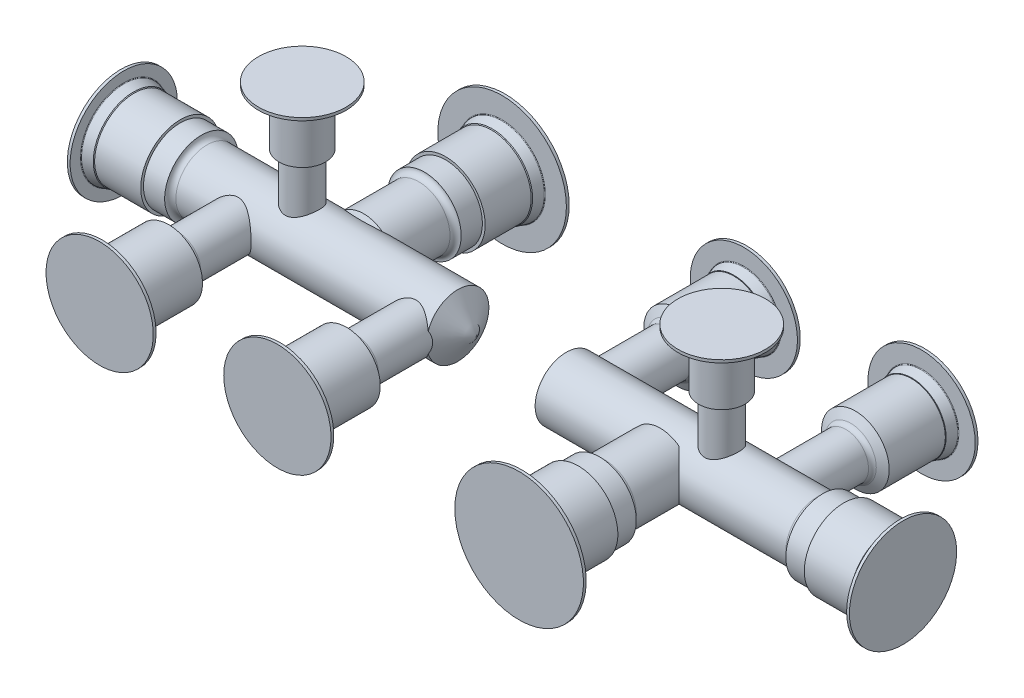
ISO-10303-21;
HEADER;
FILE_DESCRIPTION(('STEP AP214'),'2;1');
FILE_NAME('part.step','',(''),(''),'','','');
FILE_SCHEMA(('AUTOMOTIVE_DESIGN { 1 0 10303 214 1 1 1 1 }'));
ENDSEC;
DATA;
#1=APPLICATION_CONTEXT('core data for automotive mechanical design processes');
#2=APPLICATION_PROTOCOL_DEFINITION('international standard','automotive_design',2000,#1);
#3=PRODUCT_CONTEXT('',#1,'mechanical');
#4=PRODUCT('Part','Part','',(#3));
#5=PRODUCT_RELATED_PRODUCT_CATEGORY('part','',(#4));
#6=PRODUCT_DEFINITION_FORMATION('','',#4);
#7=PRODUCT_DEFINITION_CONTEXT('part definition',#1,'design');
#8=PRODUCT_DEFINITION('design','',#6,#7);
#9=PRODUCT_DEFINITION_SHAPE('','',#8);
#10=(LENGTH_UNIT() NAMED_UNIT(*) SI_UNIT(.MILLI.,.METRE.));
#11=(NAMED_UNIT(*) PLANE_ANGLE_UNIT() SI_UNIT($,.RADIAN.));
#12=(NAMED_UNIT(*) SI_UNIT($,.STERADIAN.) SOLID_ANGLE_UNIT());
#13=UNCERTAINTY_MEASURE_WITH_UNIT(LENGTH_MEASURE(1.E-05),#10,'distance_accuracy_value','');
#14=(GEOMETRIC_REPRESENTATION_CONTEXT(3) GLOBAL_UNCERTAINTY_ASSIGNED_CONTEXT((#13)) GLOBAL_UNIT_ASSIGNED_CONTEXT((#10,
#11,#12)) REPRESENTATION_CONTEXT('',''));
#15=CARTESIAN_POINT('',(0.,0.,0.));
#16=DIRECTION('',(0.,0.,1.));
#17=DIRECTION('',(1.,0.,0.));
#18=AXIS2_PLACEMENT_3D('',#15,#16,#17);
#19=CARTESIAN_POINT('',(120.,0.,0.));
#20=DIRECTION('',(-1.,0.,0.));
#21=DIRECTION('',(0.,0.,1.));
#22=AXIS2_PLACEMENT_3D('',#19,#20,#21);
#23=CYLINDRICAL_SURFACE('',#22,8.76299999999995);
#24=CARTESIAN_POINT('',(173.762499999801,8.76299999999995,0.));
#25=CARTESIAN_POINT('',(173.762500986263,8.763000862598,0.123896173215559));
#26=CARTESIAN_POINT('',(173.75766065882,8.76036718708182,0.247780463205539));
#27=CARTESIAN_POINT('',(173.73836310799,8.74990175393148,0.494619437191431));
#28=CARTESIAN_POINT('',(173.723902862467,8.74206836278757,0.617573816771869));
#29=CARTESIAN_POINT('',(173.685528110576,8.72139184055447,0.861694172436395));
#30=CARTESIAN_POINT('',(173.661603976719,8.70854360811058,0.982858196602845));
#31=CARTESIAN_POINT('',(173.604583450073,8.67815476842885,1.22245256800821));
#32=CARTESIAN_POINT('',(173.571483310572,8.6606122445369,1.34088177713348));
#33=CARTESIAN_POINT('',(173.496652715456,8.62134777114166,1.57365666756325));
#34=CARTESIAN_POINT('',(173.454962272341,8.59964523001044,1.68801849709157));
#35=CARTESIAN_POINT('',(173.363273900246,8.55250741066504,1.91258364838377));
#36=CARTESIAN_POINT('',(173.313272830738,8.52707072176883,2.02278537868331));
#37=CARTESIAN_POINT('',(173.151495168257,8.44599958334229,2.34616836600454));
#38=CARTESIAN_POINT('',(173.0278692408,8.38556355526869,2.55235760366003));
#39=CARTESIAN_POINT('',(172.743271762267,8.25251378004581,2.95538828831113));
#40=CARTESIAN_POINT('',(172.580337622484,8.17935242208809,3.15065023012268));
#41=CARTESIAN_POINT('',(172.226058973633,8.03058544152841,3.51257650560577));
#42=CARTESIAN_POINT('',(172.034688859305,7.95497766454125,3.67921477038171));
#43=CARTESIAN_POINT('',(171.606954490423,7.80138250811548,3.995291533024));
#44=CARTESIAN_POINT('',(171.368037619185,7.72385890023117,4.14156173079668));
#45=CARTESIAN_POINT('',(170.990728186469,7.61952231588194,4.32876174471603));
#46=CARTESIAN_POINT('',(170.861757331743,7.58672614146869,4.38580760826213));
#47=CARTESIAN_POINT('',(170.598216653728,7.52639633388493,4.48854899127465));
#48=CARTESIAN_POINT('',(170.463650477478,7.49885933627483,4.53425177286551));
#49=CARTESIAN_POINT('',(170.19842451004,7.45178024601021,4.61118751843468));
#50=CARTESIAN_POINT('',(170.068044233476,7.43184673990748,4.64314496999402));
#51=CARTESIAN_POINT('',(169.80429956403,7.39855184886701,4.69601739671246));
#52=CARTESIAN_POINT('',(169.670936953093,7.38518664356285,4.71693879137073));
#53=CARTESIAN_POINT('',(169.402510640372,7.36565539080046,4.7473802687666));
#54=CARTESIAN_POINT('',(169.267448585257,7.35948284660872,4.7569106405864));
#55=CARTESIAN_POINT('',(168.996878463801,7.35462330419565,4.76442099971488));
#56=CARTESIAN_POINT('',(168.861370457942,7.35593532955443,4.76240249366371));
#57=CARTESIAN_POINT('',(168.611307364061,7.36523051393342,4.74801055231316));
#58=CARTESIAN_POINT('',(168.496620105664,7.37219735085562,4.73721425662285));
#59=CARTESIAN_POINT('',(168.268733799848,7.39125082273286,4.70742835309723));
#60=CARTESIAN_POINT('',(168.155535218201,7.40333902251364,4.68843624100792));
#61=CARTESIAN_POINT('',(167.819330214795,7.44671416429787,4.61948618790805));
#62=CARTESIAN_POINT('',(167.599571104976,7.48511776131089,4.55754591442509));
#63=CARTESIAN_POINT('',(167.169278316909,7.57726431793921,4.40266176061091));
#64=CARTESIAN_POINT('',(166.95905314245,7.63132556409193,4.30906700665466));
#65=CARTESIAN_POINT('',(166.556177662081,7.74879815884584,4.09405564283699));
#66=CARTESIAN_POINT('',(166.363535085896,7.81221358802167,3.97262687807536));
#67=CARTESIAN_POINT('',(165.970238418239,7.95295281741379,3.68379028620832));
#68=CARTESIAN_POINT('',(165.772892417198,8.03091747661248,3.51218601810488));
#69=CARTESIAN_POINT('',(165.408181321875,8.18428546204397,3.1382176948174));
#70=CARTESIAN_POINT('',(165.240835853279,8.25968708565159,2.93583366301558));
#71=CARTESIAN_POINT('',(165.010750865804,8.36767144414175,2.60517298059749));
#72=CARTESIAN_POINT('',(164.935673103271,8.40379750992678,2.48646264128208));
#73=CARTESIAN_POINT('',(164.795910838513,8.47227297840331,2.24205942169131));
#74=CARTESIAN_POINT('',(164.731221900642,8.50462399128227,2.11636955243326));
#75=CARTESIAN_POINT('',(164.61295954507,8.56459526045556,1.85885750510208));
#76=CARTESIAN_POINT('',(164.559380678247,8.59221783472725,1.72703837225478));
#77=CARTESIAN_POINT('',(164.463987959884,8.64190417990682,1.45819543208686));
#78=CARTESIAN_POINT('',(164.422172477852,8.66396872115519,1.32117234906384));
#79=CARTESIAN_POINT('',(164.354193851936,8.70008785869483,1.05588044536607));
#80=CARTESIAN_POINT('',(164.32694568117,8.71469208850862,0.927963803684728));
#81=CARTESIAN_POINT('',(164.283022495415,8.73832337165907,0.669824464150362));
#82=CARTESIAN_POINT('',(164.266346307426,8.74735104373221,0.539602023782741));
#83=CARTESIAN_POINT('',(164.243810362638,8.75956694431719,0.278015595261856));
#84=CARTESIAN_POINT('',(164.237945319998,8.76275802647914,0.146652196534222));
#85=CARTESIAN_POINT('',(164.237103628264,8.76321537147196,-0.116116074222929));
#86=CARTESIAN_POINT('',(164.242126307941,8.76048199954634,-0.247520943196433));
#87=CARTESIAN_POINT('',(164.261986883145,8.74971263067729,-0.496733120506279));
#88=CARTESIAN_POINT('',(164.275844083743,8.74220663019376,-0.614643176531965));
#89=CARTESIAN_POINT('',(164.312244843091,8.722589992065,-0.84876208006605));
#90=CARTESIAN_POINT('',(164.334791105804,8.71047792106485,-0.964970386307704));
#91=CARTESIAN_POINT('',(164.388312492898,8.68193013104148,-1.19484862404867));
#92=CARTESIAN_POINT('',(164.419284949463,8.66549578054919,-1.30851934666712));
#93=CARTESIAN_POINT('',(164.48933778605,8.62867062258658,-1.53269244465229));
#94=CARTESIAN_POINT('',(164.528421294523,8.60827828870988,-1.64319357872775));
#95=CARTESIAN_POINT('',(164.659297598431,8.54076838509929,-1.97400696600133));
#96=CARTESIAN_POINT('',(164.763493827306,8.48799056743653,-2.18841185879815));
#97=CARTESIAN_POINT('',(165.000981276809,8.37198930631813,-2.59716593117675));
#98=CARTESIAN_POINT('',(165.134283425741,8.30876194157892,-2.7915075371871));
#99=CARTESIAN_POINT('',(165.443028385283,8.16943983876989,-3.17757890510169));
#100=CARTESIAN_POINT('',(165.621497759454,8.092695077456,-3.36665543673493));
#101=CARTESIAN_POINT('',(166.007093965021,7.93945682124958,-3.71365399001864));
#102=CARTESIAN_POINT('',(166.214249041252,7.8629636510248,-3.87154492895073));
#103=CARTESIAN_POINT('',(166.551709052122,7.75180610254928,-4.0874078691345));
#104=CARTESIAN_POINT('',(166.673240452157,7.71415952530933,-4.15781652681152));
#105=CARTESIAN_POINT('',(166.92289201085,7.64256865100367,-4.28798572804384));
#106=CARTESIAN_POINT('',(167.051008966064,7.60862257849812,-4.34775138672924));
#107=CARTESIAN_POINT('',(167.31299639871,7.54576648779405,-4.45595056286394));
#108=CARTESIAN_POINT('',(167.446861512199,7.51685189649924,-4.50439438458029));
#109=CARTESIAN_POINT('',(167.719501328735,7.46528915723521,-4.58934661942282));
#110=CARTESIAN_POINT('',(167.858275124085,7.44263985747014,-4.62585722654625));
#111=CARTESIAN_POINT('',(168.125813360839,7.4065610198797,-4.68338127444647));
#112=CARTESIAN_POINT('',(168.254235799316,7.39244823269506,-4.70555796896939));
#113=CARTESIAN_POINT('',(168.513009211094,7.37084191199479,-4.73933166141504));
#114=CARTESIAN_POINT('',(168.643359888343,7.36334737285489,-4.75093026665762));
#115=CARTESIAN_POINT('',(168.904706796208,7.35532426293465,-4.76334223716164));
#116=CARTESIAN_POINT('',(169.035702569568,7.35479131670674,-4.76416237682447));
#117=CARTESIAN_POINT('',(169.29715045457,7.36070535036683,-4.75502003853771));
#118=CARTESIAN_POINT('',(169.427602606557,7.36715180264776,-4.74505837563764));
#119=CARTESIAN_POINT('',(169.669792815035,7.38544271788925,-4.7165291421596));
#120=CARTESIAN_POINT('',(169.78174807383,7.39647140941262,-4.69925673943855));
#121=CARTESIAN_POINT('',(170.003620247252,7.42319765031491,-4.65692223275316));
#122=CARTESIAN_POINT('',(170.11353654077,7.43889659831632,-4.63185779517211));
#123=CARTESIAN_POINT('',(170.439225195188,7.49228967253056,-4.54537247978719));
#124=CARTESIAN_POINT('',(170.651072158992,7.53629114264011,-4.47264332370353));
#125=CARTESIAN_POINT('',(171.072791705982,7.63941430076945,-4.29426434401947));
#126=CARTESIAN_POINT('',(171.28170903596,7.69931058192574,-4.18683745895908));
#127=CARTESIAN_POINT('',(171.679988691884,7.82658698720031,-3.94379478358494));
#128=CARTESIAN_POINT('',(171.869340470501,7.89397110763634,-3.80816390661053));
#129=CARTESIAN_POINT('',(172.253113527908,8.04086032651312,-3.48857764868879));
#130=CARTESIAN_POINT('',(172.443928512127,8.12065064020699,-3.30041027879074));
#131=CARTESIAN_POINT('',(172.792525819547,8.27451091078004,-2.89308256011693));
#132=CARTESIAN_POINT('',(172.950285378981,8.34857690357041,-2.67390102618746));
#133=CARTESIAN_POINT('',(173.160527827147,8.45073302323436,-2.32183777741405));
#134=CARTESIAN_POINT('',(173.227004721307,8.48372301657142,-2.19854156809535));
#135=CARTESIAN_POINT('',(173.349183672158,8.54525400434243,-1.94568545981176));
#136=CARTESIAN_POINT('',(173.404891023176,8.57379718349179,-1.8161286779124));
#137=CARTESIAN_POINT('',(173.504764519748,8.62553457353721,-1.55190682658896));
#138=CARTESIAN_POINT('',(173.548953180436,8.64873920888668,-1.41725232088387));
#139=CARTESIAN_POINT('',(173.625295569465,8.68913526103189,-1.14376015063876));
#140=CARTESIAN_POINT('',(173.657455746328,8.70632989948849,-1.00492477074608));
#141=CARTESIAN_POINT('',(173.709584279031,8.73432633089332,-0.722555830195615));
#142=CARTESIAN_POINT('',(173.729397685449,8.74504682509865,-0.578985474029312));
#143=CARTESIAN_POINT('',(173.755854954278,8.75938314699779,-0.290271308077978));
#144=CARTESIAN_POINT('',(173.762498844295,8.76299898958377,-0.145127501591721));
#145=CARTESIAN_POINT('',(173.762499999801,8.76299999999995,0.));
#146=B_SPLINE_CURVE_WITH_KNOTS('',3,(#24,#25,#26,#27,#28,#29,#30,#31,#32,#33,#34,#35,#36,#37,
#38,#39,#40,#41,#42,#43,#44,#45,#46,#47,#48,#49,#50,#51,#52,#53,#54,#55,#56,#57,#58,#59,#60,#61,
#62,#63,#64,#65,#66,#67,#68,#69,#70,#71,#72,#73,#74,#75,#76,#77,#78,#79,#80,#81,#82,#83,#84,#85,
#86,#87,#88,#89,#90,#91,#92,#93,#94,#95,#96,#97,#98,#99,#100,#101,#102,#103,#104,#105,#106,#107,
#108,#109,#110,#111,#112,#113,#114,#115,#116,#117,#118,#119,#120,#121,#122,#123,#124,#125,#126,
#127,#128,#129,#130,#131,#132,#133,#134,#135,#136,#137,#138,#139,#140,#141,#142,#143,#144,#145),
.UNSPECIFIED.,.T.,.F.,(4,2,2,2,2,2,2,2,2,2,2,2,2,2,2,2,2,2,2,2,2,2,2,2,2,2,2,2,2,2,2,2,2,2,2,2,
2,2,2,2,2,2,2,2,2,2,2,2,2,2,2,2,2,2,2,2,2,2,2,2,4),(0.,0.371546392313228,0.743209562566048,
1.11525179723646,1.48744616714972,1.8579445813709,2.22858332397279,2.96913291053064,
3.75985018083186,4.55128381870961,5.41839521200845,5.85223525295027,6.28579681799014,
6.6923275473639,7.09862154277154,7.50454827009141,7.91042204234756,8.25621179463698,
8.60210727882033,9.29347221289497,10.0000171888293,10.7068712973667,11.5222104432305,
12.3380810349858,12.7726794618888,13.2070918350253,13.6412906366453,14.0754292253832,
14.4696849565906,14.8638969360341,15.2579161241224,15.651911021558,16.0083696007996,
16.364939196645,16.721396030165,17.0779906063,17.8071970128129,18.5366776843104,
19.3466323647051,20.1573902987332,20.593137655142,21.0286750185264,21.463814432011,
21.8988737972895,22.29154815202,22.6841628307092,23.0765307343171,23.4688689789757,
23.809921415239,24.1510760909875,24.8329814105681,25.5576093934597,26.282625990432,
27.1178737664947,27.9536948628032,28.384911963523,28.8159165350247,29.2460722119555,
29.6759969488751,30.111213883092,30.546429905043),.UNSPECIFIED.);
#147=CARTESIAN_POINT('',(173.762499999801,8.76299999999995,0.));
#148=VERTEX_POINT('',#147);
#149=EDGE_CURVE('E46',#148,#148,#146,.T.);
#150=ORIENTED_EDGE('',*,*,#149,.T.);
#151=EDGE_LOOP('',(#150));
#152=FACE_BOUND('',#151,.T.);
#153=CARTESIAN_POINT('',(125.265341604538,-2.78557323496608,-8.30847463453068));
#154=CARTESIAN_POINT('',(125.348658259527,-2.95709362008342,-8.25099233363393));
#155=CARTESIAN_POINT('',(125.439051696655,-3.12361427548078,-8.18923390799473));
#156=CARTESIAN_POINT('',(125.632793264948,-3.44588556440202,-8.0589151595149));
#157=CARTESIAN_POINT('',(125.736128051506,-3.60164703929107,-7.99036185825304));
#158=CARTESIAN_POINT('',(125.954660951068,-3.90189007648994,-7.84812312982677));
#159=CARTESIAN_POINT('',(126.069851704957,-4.04637853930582,-7.77444089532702));
#160=CARTESIAN_POINT('',(126.311320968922,-4.32387005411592,-7.62359841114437));
#161=CARTESIAN_POINT('',(126.437602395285,-4.45687006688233,-7.54643724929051));
#162=CARTESIAN_POINT('',(126.700074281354,-4.71057921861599,-7.39071609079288));
#163=CARTESIAN_POINT('',(126.836225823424,-4.83133256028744,-7.3121624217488));
#164=CARTESIAN_POINT('',(127.118401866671,-5.06083024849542,-7.1552420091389));
#165=CARTESIAN_POINT('',(127.264426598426,-5.16957431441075,-7.07687526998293));
#166=CARTESIAN_POINT('',(127.566106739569,-5.37469656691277,-6.92237569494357));
#167=CARTESIAN_POINT('',(127.721763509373,-5.47107300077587,-6.84624317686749));
#168=CARTESIAN_POINT('',(128.042382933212,-5.65084369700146,-6.69863205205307));
#169=CARTESIAN_POINT('',(128.207342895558,-5.73424168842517,-6.62715211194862));
#170=CARTESIAN_POINT('',(128.627339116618,-5.92380882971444,-6.45920968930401));
#171=CARTESIAN_POINT('',(128.887917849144,-6.02195670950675,-6.36702405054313));
#172=CARTESIAN_POINT('',(129.291836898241,-6.14391415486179,-6.24865757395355));
#173=CARTESIAN_POINT('',(129.428581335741,-6.18034419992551,-6.21253361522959));
#174=CARTESIAN_POINT('',(129.70593904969,-6.24430578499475,-6.1482409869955));
#175=CARTESIAN_POINT('',(129.846550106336,-6.27184231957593,-6.12006785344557));
#176=CARTESIAN_POINT('',(130.132547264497,-6.31779056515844,-6.07262750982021));
#177=CARTESIAN_POINT('',(130.277970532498,-6.33608801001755,-6.05347201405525));
#178=CARTESIAN_POINT('',(130.57073482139,-6.36262929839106,-6.02556994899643));
#179=CARTESIAN_POINT('',(130.718075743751,-6.37087365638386,-6.0168228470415));
#180=CARTESIAN_POINT('',(131.013169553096,-6.37709369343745,-6.01023017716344));
#181=CARTESIAN_POINT('',(131.160922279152,-6.37507293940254,-6.01238082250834));
#182=CARTESIAN_POINT('',(131.455369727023,-6.36082454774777,-6.02745269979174));
#183=CARTESIAN_POINT('',(131.60206449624,-6.34859737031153,-6.04037344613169));
#184=CARTESIAN_POINT('',(131.87094471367,-6.31685305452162,-6.073546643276));
#185=CARTESIAN_POINT('',(131.993473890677,-6.29872234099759,-6.09239039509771));
#186=CARTESIAN_POINT('',(132.236139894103,-6.25562841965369,-6.13663053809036));
#187=CARTESIAN_POINT('',(132.356275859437,-6.23066279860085,-6.16202924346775));
#188=CARTESIAN_POINT('',(132.712433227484,-6.14595885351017,-6.24689965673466));
#189=CARTESIAN_POINT('',(132.944153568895,-6.07641960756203,-6.31503886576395));
#190=CARTESIAN_POINT('',(133.339225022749,-5.93352644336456,-6.4490749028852));
#191=CARTESIAN_POINT('',(133.505619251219,-5.86510945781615,-6.5115720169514));
#192=CARTESIAN_POINT('',(133.830022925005,-5.71564281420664,-6.64315537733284));
#193=CARTESIAN_POINT('',(133.98802855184,-5.63458746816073,-6.71224458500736));
#194=CARTESIAN_POINT('',(134.295600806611,-5.46040702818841,-6.85469217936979));
#195=CARTESIAN_POINT('',(134.445151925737,-5.36726072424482,-6.92805794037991));
#196=CARTESIAN_POINT('',(134.735339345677,-5.16950565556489,-7.07684228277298));
#197=CARTESIAN_POINT('',(134.875976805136,-5.06489838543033,-7.15226059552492));
#198=CARTESIAN_POINT('',(135.151471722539,-4.84181594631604,-7.30518376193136));
#199=CARTESIAN_POINT('',(135.286101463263,-4.72306264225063,-7.38269425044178));
#200=CARTESIAN_POINT('',(135.545344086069,-4.47413639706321,-7.5361597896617));
#201=CARTESIAN_POINT('',(135.669953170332,-4.34395916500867,-7.61211424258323));
#202=CARTESIAN_POINT('',(136.027442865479,-3.93708877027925,-7.83484172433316));
#203=CARTESIAN_POINT('',(136.244671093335,-3.6435042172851,-7.97687297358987));
#204=CARTESIAN_POINT('',(136.599350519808,-3.0642143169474,-8.21479254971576));
#205=CARTESIAN_POINT('',(136.743965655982,-2.78446101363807,-8.31442346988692));
#206=CARTESIAN_POINT('',(136.930130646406,-2.34617557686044,-8.44446276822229));
#207=CARTESIAN_POINT('',(136.987071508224,-2.19692480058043,-8.4845835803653));
#208=CARTESIAN_POINT('',(137.089993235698,-1.89299058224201,-8.5575192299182));
#209=CARTESIAN_POINT('',(137.135978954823,-1.73830958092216,-8.59033730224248));
#210=CARTESIAN_POINT('',(137.2166107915,-1.4234033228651,-8.64811531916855));
#211=CARTESIAN_POINT('',(137.251176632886,-1.26314721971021,-8.67301958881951));
#212=CARTESIAN_POINT('',(137.307961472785,-0.939340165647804,-8.71403666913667));
#213=CARTESIAN_POINT('',(137.330180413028,-0.77578919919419,-8.73014943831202));
#214=CARTESIAN_POINT('',(137.361863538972,-0.446880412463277,-8.75314987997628));
#215=CARTESIAN_POINT('',(137.371333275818,-0.281523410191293,-8.76004156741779));
#216=CARTESIAN_POINT('',(137.377356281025,0.0495423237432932,-8.7644230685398));
#217=CARTESIAN_POINT('',(137.373910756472,0.215251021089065,-8.76191376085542));
#218=CARTESIAN_POINT('',(137.355258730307,0.527360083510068,-8.74835550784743));
#219=CARTESIAN_POINT('',(137.341383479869,0.673884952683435,-8.73827327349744));
#220=CARTESIAN_POINT('',(137.303651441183,0.965014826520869,-8.71092967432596));
#221=CARTESIAN_POINT('',(137.279791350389,1.10961917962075,-8.69366593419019));
#222=CARTESIAN_POINT('',(137.222427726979,1.39585857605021,-8.65232084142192));
#223=CARTESIAN_POINT('',(137.188926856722,1.53749442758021,-8.62824137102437));
#224=CARTESIAN_POINT('',(137.112694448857,1.8170567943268,-8.57372543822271));
#225=CARTESIAN_POINT('',(137.069959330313,1.95498184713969,-8.54328650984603));
#226=CARTESIAN_POINT('',(136.97471259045,2.22936862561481,-8.47587611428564));
#227=CARTESIAN_POINT('',(136.92200589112,2.36573075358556,-8.43877521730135));
#228=CARTESIAN_POINT('',(136.808017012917,2.63321546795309,-8.35917741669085));
#229=CARTESIAN_POINT('',(136.746731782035,2.76433616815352,-8.31667859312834));
#230=CARTESIAN_POINT('',(136.550877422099,3.1489982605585,-8.18215317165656));
#231=CARTESIAN_POINT('',(136.404237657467,3.39404390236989,-8.08304582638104));
#232=CARTESIAN_POINT('',(136.057865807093,3.89494049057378,-7.85536717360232));
#233=CARTESIAN_POINT('',(135.853417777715,4.14649411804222,-7.72461180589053));
#234=CARTESIAN_POINT('',(135.411189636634,4.61421079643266,-7.45467425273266));
#235=CARTESIAN_POINT('',(135.173344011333,4.83030243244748,-7.31547581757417));
#236=CARTESIAN_POINT('',(134.771008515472,5.14403548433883,-7.09573005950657));
#237=CARTESIAN_POINT('',(134.616313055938,5.25397027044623,-7.01448417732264));
#238=CARTESIAN_POINT('',(134.296501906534,5.46031411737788,-6.85507911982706));
#239=CARTESIAN_POINT('',(134.131382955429,5.55671891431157,-6.77692092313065));
#240=CARTESIAN_POINT('',(133.791312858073,5.73507346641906,-6.62666444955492));
#241=CARTESIAN_POINT('',(133.616381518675,5.8170510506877,-6.5545546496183));
#242=CARTESIAN_POINT('',(133.256903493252,5.96573273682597,-6.41952266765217));
#243=CARTESIAN_POINT('',(133.072363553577,6.03244738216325,-6.3565941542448));
#244=CARTESIAN_POINT('',(132.63987325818,6.16613066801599,-6.22736202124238));
#245=CARTESIAN_POINT('',(132.388882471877,6.22771467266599,-6.16524066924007));
#246=CARTESIAN_POINT('',(132.004553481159,6.29710958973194,-6.09406652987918));
#247=CARTESIAN_POINT('',(131.875199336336,6.31640736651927,-6.07401406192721));
#248=CARTESIAN_POINT('',(131.614583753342,6.34706162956,-6.04197657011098));
#249=CARTESIAN_POINT('',(131.483323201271,6.35842169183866,-6.02998791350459));
#250=CARTESIAN_POINT('',(131.219125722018,6.37301446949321,-6.0145631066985));
#251=CARTESIAN_POINT('',(131.086183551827,6.37620236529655,-6.01117412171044));
#252=CARTESIAN_POINT('',(130.820431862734,6.37425566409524,-6.01323838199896));
#253=CARTESIAN_POINT('',(130.687622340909,6.36912125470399,-6.01869142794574));
#254=CARTESIAN_POINT('',(130.423131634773,6.35063275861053,-6.03819597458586));
#255=CARTESIAN_POINT('',(130.291451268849,6.3372731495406,-6.05225325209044));
#256=CARTESIAN_POINT('',(130.030207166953,6.30258722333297,-6.08836476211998));
#257=CARTESIAN_POINT('',(129.900644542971,6.28125685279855,-6.11042306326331));
#258=CARTESIAN_POINT('',(129.620282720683,6.22624905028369,-6.1665072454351));
#259=CARTESIAN_POINT('',(129.470086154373,6.19100178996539,-6.20200550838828));
#260=CARTESIAN_POINT('',(129.174633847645,6.1104207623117,-6.28141065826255));
#261=CARTESIAN_POINT('',(129.029381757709,6.06507972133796,-6.32532360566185));
#262=CARTESIAN_POINT('',(128.744088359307,5.96485568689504,-6.419923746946));
#263=CARTESIAN_POINT('',(128.604060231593,5.90995030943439,-6.47062676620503));
#264=CARTESIAN_POINT('',(128.329902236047,5.79125323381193,-6.57707462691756));
#265=CARTESIAN_POINT('',(128.195770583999,5.72746424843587,-6.63281792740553));
#266=CARTESIAN_POINT('',(127.892376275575,5.570103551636,-6.76592861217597));
#267=CARTESIAN_POINT('',(127.725271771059,5.4734619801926,-6.84459957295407));
#268=CARTESIAN_POINT('',(127.401559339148,5.26629826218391,-7.00524612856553));
#269=CARTESIAN_POINT('',(127.244954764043,5.15577171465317,-7.08722276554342));
#270=CARTESIAN_POINT('',(126.942758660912,4.92148382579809,-7.25187054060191));
#271=CARTESIAN_POINT('',(126.797152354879,4.7977408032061,-7.33454057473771));
#272=CARTESIAN_POINT('',(126.517264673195,4.53733011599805,-7.49843373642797));
#273=CARTESIAN_POINT('',(126.38298041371,4.40066576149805,-7.57965722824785));
#274=CARTESIAN_POINT('',(126.059853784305,4.04050188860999,-7.77984904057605));
#275=CARTESIAN_POINT('',(125.878718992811,3.80865131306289,-7.89660954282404));
#276=CARTESIAN_POINT('',(125.630434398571,3.44027094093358,-8.06057392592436));
#277=CARTESIAN_POINT('',(125.551541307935,3.31397323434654,-8.11339024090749));
#278=CARTESIAN_POINT('',(125.402061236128,3.05470040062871,-8.21452059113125));
#279=CARTESIAN_POINT('',(125.331480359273,2.9217204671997,-8.26283131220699));
#280=CARTESIAN_POINT('',(125.265341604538,2.7855732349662,-8.30847463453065));
#281=B_SPLINE_CURVE_WITH_KNOTS('',3,(#153,#154,#155,#156,#157,#158,#159,#160,#161,#162,#163,
#164,#165,#166,#167,#168,#169,#170,#171,#172,#173,#174,#175,#176,#177,#178,#179,#180,#181,#182,
#183,#184,#185,#186,#187,#188,#189,#190,#191,#192,#193,#194,#195,#196,#197,#198,#199,#200,#201,
#202,#203,#204,#205,#206,#207,#208,#209,#210,#211,#212,#213,#214,#215,#216,#217,#218,#219,#220,
#221,#222,#223,#224,#225,#226,#227,#228,#229,#230,#231,#232,#233,#234,#235,#236,#237,#238,#239,
#240,#241,#242,#243,#244,#245,#246,#247,#248,#249,#250,#251,#252,#253,#254,#255,#256,#257,#258,
#259,#260,#261,#262,#263,#264,#265,#266,#267,#268,#269,#270,#271,#272,#273,#274,#275,#276,#277,
#278,#279,#280),.UNSPECIFIED.,.F.,.F.,(4,2,2,2,2,2,2,2,2,2,2,2,2,2,2,2,2,2,2,2,2,2,2,2,2,2,2,2,
2,2,2,2,2,2,2,2,2,2,2,2,2,2,2,2,2,2,2,2,2,2,2,2,2,2,2,2,2,2,2,2,2,2,2,4),(0.,0.597089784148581,
1.19356886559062,1.78967991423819,2.38594818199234,2.97998138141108,3.57402845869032,
4.16815963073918,4.76211977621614,5.63843073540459,6.07615618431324,6.51363537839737,
6.95640021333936,7.39914238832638,7.84173073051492,8.28429911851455,8.65976388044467,
9.03536138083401,9.78670891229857,10.3574110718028,10.9283708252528,11.5003460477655,
12.0722467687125,12.6582352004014,13.2444446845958,14.4140015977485,15.4005981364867,
15.8941852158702,16.3875532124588,16.884319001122,17.3810871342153,17.8776388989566,
18.3741442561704,18.816198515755,19.2583991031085,19.7004776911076,20.1427280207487,
20.594745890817,21.0469249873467,21.9506217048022,22.9955634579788,24.0425844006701,
24.6612886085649,25.2801873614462,25.8978788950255,26.5151424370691,27.3089480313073,
27.7054781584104,28.101829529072,28.500350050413,28.8988615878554,29.29764097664,
29.6966234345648,30.1708440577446,30.6454075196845,31.1210969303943,31.5966413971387,
32.2211617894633,32.8458806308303,33.4697445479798,34.0934490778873,35.039767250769,
35.513413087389,35.9874046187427),.UNSPECIFIED.);
#282=CARTESIAN_POINT('',(125.265341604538,-2.78557323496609,-8.30847463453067));
#283=VERTEX_POINT('',#282);
#284=CARTESIAN_POINT('',(125.265341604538,2.7855732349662,-8.30847463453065));
#285=VERTEX_POINT('',#284);
#286=EDGE_CURVE('E131',#283,#285,#281,.T.);
#287=ORIENTED_EDGE('',*,*,#286,.T.);
#288=CARTESIAN_POINT('',(125.265341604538,0.,0.));
#289=DIRECTION('',(1.,0.,0.));
#290=DIRECTION('',(0.,0.,1.));
#291=AXIS2_PLACEMENT_3D('',#288,#289,#290);
#292=CIRCLE('',#291,8.76299999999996);
#293=EDGE_CURVE('E242',#285,#283,#292,.T.);
#294=ORIENTED_EDGE('',*,*,#293,.T.);
#295=EDGE_LOOP('',(#287,#294));
#296=FACE_BOUND('',#295,.T.);
#297=CARTESIAN_POINT('',(195.7938,0.,0.));
#298=DIRECTION('',(1.,0.,0.));
#299=DIRECTION('',(0.,0.,1.));
#300=AXIS2_PLACEMENT_3D('',#297,#298,#299);
#301=CIRCLE('',#300,8.76299999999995);
#302=CARTESIAN_POINT('',(195.7938,0.,8.76299999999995));
#303=VERTEX_POINT('',#302);
#304=EDGE_CURVE('E246',#303,#303,#301,.T.);
#305=ORIENTED_EDGE('',*,*,#304,.F.);
#306=EDGE_LOOP('',(#305));
#307=FACE_BOUND('',#306,.T.);
#308=CARTESIAN_POINT('',(187.3754,0.,-8.76299999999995));
#309=CARTESIAN_POINT('',(187.375398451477,0.156836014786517,-8.76299851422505));
#310=CARTESIAN_POINT('',(187.369602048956,0.313717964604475,-8.75877897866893));
#311=CARTESIAN_POINT('',(187.34650408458,0.626253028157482,-8.74199616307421));
#312=CARTESIAN_POINT('',(187.329195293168,0.781905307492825,-8.72942764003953));
#313=CARTESIAN_POINT('',(187.28330565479,1.09098566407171,-8.69621311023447));
#314=CARTESIAN_POINT('',(187.254702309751,1.24440866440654,-8.6755509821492));
#315=CARTESIAN_POINT('',(187.186652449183,1.54765014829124,-8.6266189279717));
#316=CARTESIAN_POINT('',(187.147201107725,1.69746699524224,-8.59834561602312));
#317=CARTESIAN_POINT('',(187.058299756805,1.99152342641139,-8.53501443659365));
#318=CARTESIAN_POINT('',(187.008916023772,2.13579280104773,-8.50000160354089));
#319=CARTESIAN_POINT('',(186.900595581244,2.41903255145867,-8.42377581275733));
#320=CARTESIAN_POINT('',(186.841655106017,2.55800081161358,-8.38256041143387));
#321=CARTESIAN_POINT('',(186.65153191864,2.9657540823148,-8.25080903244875));
#322=CARTESIAN_POINT('',(186.506926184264,3.22578150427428,-8.15207989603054));
#323=CARTESIAN_POINT('',(186.172240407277,3.74121599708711,-7.92965665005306));
#324=CARTESIAN_POINT('',(185.979220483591,3.99405149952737,-7.80450859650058));
#325=CARTESIAN_POINT('',(185.56061305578,4.46611853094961,-7.54430891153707));
#326=CARTESIAN_POINT('',(185.334974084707,4.68529580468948,-7.40924179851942));
#327=CARTESIAN_POINT('',(184.951552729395,5.00657888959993,-7.19342042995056));
#328=CARTESIAN_POINT('',(184.803187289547,5.12020670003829,-7.11277038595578));
#329=CARTESIAN_POINT('',(184.496238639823,5.33451863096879,-6.95347979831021));
#330=CARTESIAN_POINT('',(184.337652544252,5.43519907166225,-6.87483983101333));
#331=CARTESIAN_POINT('',(184.010708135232,5.62288473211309,-6.72219876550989));
#332=CARTESIAN_POINT('',(183.842361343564,5.70990564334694,-6.6481924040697));
#333=CARTESIAN_POINT('',(183.496120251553,5.86953799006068,-6.50768693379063));
#334=CARTESIAN_POINT('',(183.318231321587,5.94215742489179,-6.44118366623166));
#335=CARTESIAN_POINT('',(182.890977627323,6.09402533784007,-6.29820098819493));
#336=CARTESIAN_POINT('',(182.637853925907,6.16715113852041,-6.22600241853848));
#337=CARTESIAN_POINT('',(182.248599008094,6.25335207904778,-6.13900734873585));
#338=CARTESIAN_POINT('',(182.117323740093,6.27816424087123,-6.11356721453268));
#339=CARTESIAN_POINT('',(181.8522180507,6.31960563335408,-6.07072062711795));
#340=CARTESIAN_POINT('',(181.718388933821,6.33623893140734,-6.05331018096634));
#341=CARTESIAN_POINT('',(181.448048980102,6.36109639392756,-6.02718449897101));
#342=CARTESIAN_POINT('',(181.311525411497,6.36925457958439,-6.01853749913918));
#343=CARTESIAN_POINT('',(181.037963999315,6.37675490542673,-6.01059040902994));
#344=CARTESIAN_POINT('',(180.900926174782,6.37609736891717,-6.01128997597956));
#345=CARTESIAN_POINT('',(180.627460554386,6.36597787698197,-6.0220052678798));
#346=CARTESIAN_POINT('',(180.491033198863,6.35651035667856,-6.03202688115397));
#347=CARTESIAN_POINT('',(180.219999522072,6.32897205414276,-6.06091370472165));
#348=CARTESIAN_POINT('',(180.085393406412,6.3109003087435,-6.07977990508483));
#349=CARTESIAN_POINT('',(179.803677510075,6.26396025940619,-6.12815074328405));
#350=CARTESIAN_POINT('',(179.656901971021,6.23409224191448,-6.1586265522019));
#351=CARTESIAN_POINT('',(179.367654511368,6.16468336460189,-6.22810180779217));
#352=CARTESIAN_POINT('',(179.225185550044,6.12513601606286,-6.26710697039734));
#353=CARTESIAN_POINT('',(178.94497806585,6.03690550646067,-6.35214110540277));
#354=CARTESIAN_POINT('',(178.807248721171,5.98820568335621,-6.39818285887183));
#355=CARTESIAN_POINT('',(178.537177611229,5.88228438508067,-6.4956971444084));
#356=CARTESIAN_POINT('',(178.404834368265,5.82506526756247,-6.54716817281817));
#357=CARTESIAN_POINT('',(178.10188969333,5.68185285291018,-6.67222126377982));
#358=CARTESIAN_POINT('',(177.933452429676,5.59266619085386,-6.74740253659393));
#359=CARTESIAN_POINT('',(177.606634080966,5.40062350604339,-6.9020757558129));
#360=CARTESIAN_POINT('',(177.448256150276,5.29776322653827,-6.98156904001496));
#361=CARTESIAN_POINT('',(177.141671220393,5.07883179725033,-7.14241594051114));
#362=CARTESIAN_POINT('',(176.993473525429,4.96274881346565,-7.22377117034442));
#363=CARTESIAN_POINT('',(176.707787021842,4.71784125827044,-7.38604922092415));
#364=CARTESIAN_POINT('',(176.570297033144,4.58901809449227,-7.46697208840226));
#365=CARTESIAN_POINT('',(176.304891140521,4.31719970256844,-7.62739654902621));
#366=CARTESIAN_POINT('',(176.177119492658,4.17404485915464,-7.7068669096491));
#367=CARTESIAN_POINT('',(175.933941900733,3.87529013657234,-7.86133408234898));
#368=CARTESIAN_POINT('',(175.818537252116,3.71968895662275,-7.93633042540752));
#369=CARTESIAN_POINT('',(175.60140395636,3.3968591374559,-8.07976833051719));
#370=CARTESIAN_POINT('',(175.499649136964,3.22965371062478,-8.14822236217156));
#371=CARTESIAN_POINT('',(175.310864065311,2.88412465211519,-8.27683137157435));
#372=CARTESIAN_POINT('',(175.223828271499,2.70580523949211,-8.33698947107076));
#373=CARTESIAN_POINT('',(175.086132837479,2.38619830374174,-8.43306029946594));
#374=CARTESIAN_POINT('',(175.031867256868,2.24713268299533,-8.47123541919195));
#375=CARTESIAN_POINT('',(174.932843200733,1.96412678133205,-8.54128848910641));
#376=CARTESIAN_POINT('',(174.888082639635,1.82018757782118,-8.57316782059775));
#377=CARTESIAN_POINT('',(174.808641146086,1.5282889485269,-8.62998250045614));
#378=CARTESIAN_POINT('',(174.773954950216,1.38033166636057,-8.65492147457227));
#379=CARTESIAN_POINT('',(174.715113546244,1.08127219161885,-8.6973458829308));
#380=CARTESIAN_POINT('',(174.690958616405,0.93016991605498,-8.71483112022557));
#381=CARTESIAN_POINT('',(174.653479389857,0.625353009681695,-8.74200206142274));
#382=CARTESIAN_POINT('',(174.640195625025,0.471630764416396,-8.75165857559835));
#383=CARTESIAN_POINT('',(174.624824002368,0.16333029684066,-8.76283543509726));
#384=CARTESIAN_POINT('',(174.622736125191,0.0087520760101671,-8.76435579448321));
#385=CARTESIAN_POINT('',(174.629790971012,-0.300016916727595,-8.75922377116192));
#386=CARTESIAN_POINT('',(174.638934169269,-0.454207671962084,-8.75257104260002));
#387=CARTESIAN_POINT('',(174.66830160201,-0.760961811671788,-8.73125116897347));
#388=CARTESIAN_POINT('',(174.688525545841,-0.913525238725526,-8.71658423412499));
#389=CARTESIAN_POINT('',(174.73828395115,-1.2072900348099,-8.68062513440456));
#390=CARTESIAN_POINT('',(174.767224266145,-1.34864453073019,-8.65975664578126));
#391=CARTESIAN_POINT('',(174.834302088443,-1.62805698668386,-8.61160473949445));
#392=CARTESIAN_POINT('',(174.872442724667,-1.76611380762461,-8.58431913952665));
#393=CARTESIAN_POINT('',(174.999997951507,-2.17410612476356,-8.49357668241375));
#394=CARTESIAN_POINT('',(175.102584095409,-2.43808419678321,-8.42120603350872));
#395=CARTESIAN_POINT('',(175.348571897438,-2.96632858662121,-8.25073216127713));
#396=CARTESIAN_POINT('',(175.494662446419,-3.22878574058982,-8.15098712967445));
#397=CARTESIAN_POINT('',(175.818536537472,-3.72644141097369,-7.93582396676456));
#398=CARTESIAN_POINT('',(175.996341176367,-3.96162160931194,-7.82039541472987));
#399=CARTESIAN_POINT('',(176.301413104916,-4.31264700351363,-7.62976827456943));
#400=CARTESIAN_POINT('',(176.419691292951,-4.43802396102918,-7.55737642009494));
#401=CARTESIAN_POINT('',(176.665469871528,-4.67836508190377,-7.41099446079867));
#402=CARTESIAN_POINT('',(176.792968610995,-4.79333110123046,-7.33700464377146));
#403=CARTESIAN_POINT('',(177.056912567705,-5.01271111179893,-7.18891054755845));
#404=CARTESIAN_POINT('',(177.193366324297,-5.11711478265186,-7.11480622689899));
#405=CARTESIAN_POINT('',(177.474847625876,-5.31494225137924,-6.96826382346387));
#406=CARTESIAN_POINT('',(177.619873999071,-5.40836754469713,-6.89582551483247));
#407=CARTESIAN_POINT('',(177.900490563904,-5.57332876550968,-6.7629885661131));
#408=CARTESIAN_POINT('',(178.035136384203,-5.6461463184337,-6.70218582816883));
#409=CARTESIAN_POINT('',(178.310853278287,-5.78254860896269,-6.58486080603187));
#410=CARTESIAN_POINT('',(178.451924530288,-5.84613309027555,-6.52833864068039));
#411=CARTESIAN_POINT('',(178.740057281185,-5.96343344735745,-6.4213646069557));
#412=CARTESIAN_POINT('',(178.887108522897,-6.01716541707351,-6.37090288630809));
#413=CARTESIAN_POINT('',(179.18700488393,-6.11421187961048,-6.27782672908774));
#414=CARTESIAN_POINT('',(179.339847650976,-6.15753055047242,-6.23520914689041));
#415=CARTESIAN_POINT('',(179.617078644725,-6.22486791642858,-6.16789596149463));
#416=CARTESIAN_POINT('',(179.740489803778,-6.25103420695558,-6.14131747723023));
#417=CARTESIAN_POINT('',(179.989847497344,-6.2961380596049,-6.09506859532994));
#418=CARTESIAN_POINT('',(180.115792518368,-6.31507980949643,-6.07539419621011));
#419=CARTESIAN_POINT('',(180.369422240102,-6.34542280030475,-6.04369610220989));
#420=CARTESIAN_POINT('',(180.497105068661,-6.35683158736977,-6.03166475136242));
#421=CARTESIAN_POINT('',(180.753439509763,-6.37192393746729,-6.01571914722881));
#422=CARTESIAN_POINT('',(180.882091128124,-6.375607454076,-6.0118049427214));
#423=CARTESIAN_POINT('',(181.139562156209,-6.37517416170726,-6.01226442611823));
#424=CARTESIAN_POINT('',(181.268381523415,-6.37104547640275,-6.0166507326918));
#425=CARTESIAN_POINT('',(181.524993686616,-6.35504804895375,-6.03354509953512));
#426=CARTESIAN_POINT('',(181.652786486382,-6.34317933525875,-6.04605312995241));
#427=CARTESIAN_POINT('',(181.906598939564,-6.31190730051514,-6.07869256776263));
#428=CARTESIAN_POINT('',(182.032616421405,-6.29249546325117,-6.09883259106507));
#429=CARTESIAN_POINT('',(182.282072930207,-6.24644842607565,-6.14598517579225));
#430=CARTESIAN_POINT('',(182.405510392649,-6.21980897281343,-6.17300178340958));
#431=CARTESIAN_POINT('',(182.686224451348,-6.15053968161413,-6.24212269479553));
#432=CARTESIAN_POINT('',(182.842397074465,-6.1055105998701,-6.28631742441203));
#433=CARTESIAN_POINT('',(183.148632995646,-6.0045917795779,-6.3827826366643));
#434=CARTESIAN_POINT('',(183.298693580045,-5.94869727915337,-6.43505665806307));
#435=CARTESIAN_POINT('',(183.592464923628,-5.82667826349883,-6.54574481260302));
#436=CARTESIAN_POINT('',(183.736167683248,-5.76054130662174,-6.60416638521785));
#437=CARTESIAN_POINT('',(184.01679764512,-5.61866299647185,-6.72528917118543));
#438=CARTESIAN_POINT('',(184.153725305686,-5.54292229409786,-6.78799009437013));
#439=CARTESIAN_POINT('',(184.562037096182,-5.29722066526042,-6.98385243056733));
#440=CARTESIAN_POINT('',(184.822492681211,-5.11231856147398,-7.1214113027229));
#441=CARTESIAN_POINT('',(185.313151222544,-4.70573617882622,-7.39638733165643));
#442=CARTESIAN_POINT('',(185.543341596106,-4.48404068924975,-7.53380440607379));
#443=CARTESIAN_POINT('',(185.886941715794,-4.09898705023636,-7.74702077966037));
#444=CARTESIAN_POINT('',(186.0108661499,-3.94662970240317,-7.82593695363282));
#445=CARTESIAN_POINT('',(186.245351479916,-3.62918052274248,-7.97810605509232));
#446=CARTESIAN_POINT('',(186.355909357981,-3.46408582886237,-8.05135770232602));
#447=CARTESIAN_POINT('',(186.562234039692,-3.12203939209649,-8.1900594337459));
#448=CARTESIAN_POINT('',(186.658015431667,-2.94509959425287,-8.25551719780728));
#449=CARTESIAN_POINT('',(186.833428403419,-2.58026186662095,-8.37671226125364));
#450=CARTESIAN_POINT('',(186.913068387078,-2.39236970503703,-8.43245461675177));
#451=CARTESIAN_POINT('',(187.0345394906,-2.061949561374,-8.51814710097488));
#452=CARTESIAN_POINT('',(187.080681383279,-1.92172161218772,-8.55092350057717));
#453=CARTESIAN_POINT('',(187.163395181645,-1.63713912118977,-8.60993854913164));
#454=CARTESIAN_POINT('',(187.199969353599,-1.49278556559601,-8.63617874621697));
#455=CARTESIAN_POINT('',(187.2629938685,-1.20117963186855,-8.68153552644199));
#456=CARTESIAN_POINT('',(187.289469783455,-1.05393558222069,-8.70067009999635));
#457=CARTESIAN_POINT('',(187.332041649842,-0.757238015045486,-8.7314934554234));
#458=CARTESIAN_POINT('',(187.348143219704,-0.60778573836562,-8.74318626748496));
#459=CARTESIAN_POINT('',(187.364421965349,-0.381689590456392,-8.75501565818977));
#460=CARTESIAN_POINT('',(187.368536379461,-0.305451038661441,-8.75800752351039));
#461=CARTESIAN_POINT('',(187.374025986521,-0.152811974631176,-8.76200021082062));
#462=CARTESIAN_POINT('',(187.375400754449,-0.0764114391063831,-8.76300072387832));
#463=CARTESIAN_POINT('',(187.3754,0.,-8.76299999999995));
#464=B_SPLINE_CURVE_WITH_KNOTS('',3,(#308,#309,#310,#311,#312,#313,#314,#315,#316,#317,#318,
#319,#320,#321,#322,#323,#324,#325,#326,#327,#328,#329,#330,#331,#332,#333,#334,#335,#336,#337,
#338,#339,#340,#341,#342,#343,#344,#345,#346,#347,#348,#349,#350,#351,#352,#353,#354,#355,#356,
#357,#358,#359,#360,#361,#362,#363,#364,#365,#366,#367,#368,#369,#370,#371,#372,#373,#374,#375,
#376,#377,#378,#379,#380,#381,#382,#383,#384,#385,#386,#387,#388,#389,#390,#391,#392,#393,#394,
#395,#396,#397,#398,#399,#400,#401,#402,#403,#404,#405,#406,#407,#408,#409,#410,#411,#412,#413,
#414,#415,#416,#417,#418,#419,#420,#421,#422,#423,#424,#425,#426,#427,#428,#429,#430,#431,#432,
#433,#434,#435,#436,#437,#438,#439,#440,#441,#442,#443,#444,#445,#446,#447,#448,#449,#450,#451,
#452,#453,#454,#455,#456,#457,#458,#459,#460,#461,#462,#463),.UNSPECIFIED.,.T.,.F.,(4,2,2,2,2,2,
2,2,2,2,2,2,2,2,2,2,2,2,2,2,2,2,2,2,2,2,2,2,2,2,2,2,2,2,2,2,2,2,2,2,2,2,2,2,2,2,2,2,2,2,2,2,2,2,
2,2,2,2,2,2,2,2,2,2,2,2,2,2,2,2,2,2,2,2,2,2,2,4),(0.,0.470425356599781,0.941146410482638,
1.41280988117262,1.88468352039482,2.35350711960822,2.82251590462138,3.75928302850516,
4.78125680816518,5.80486104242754,6.4149013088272,7.02511457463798,7.6346216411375,
8.24378920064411,9.05981343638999,9.46739877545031,9.87478121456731,10.2853118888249,
10.6958275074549,11.1066026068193,11.5174236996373,11.9753105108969,12.4335051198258,
12.8925420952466,13.3514522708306,13.9652588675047,14.5792569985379,15.1938090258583,
15.808293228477,16.4306043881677,17.052980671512,17.6741460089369,18.2950769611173,
18.7568698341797,19.2185612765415,19.6800110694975,20.1414730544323,20.6046478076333,
21.0678217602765,21.531015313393,21.9941967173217,22.4310669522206,22.8680859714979,
23.7414542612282,24.6876033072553,25.6343841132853,26.1947755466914,26.7550668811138,
27.3159004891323,27.8766576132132,28.370382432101,28.8641209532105,29.3570456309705,
29.8497722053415,30.2361719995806,30.6223474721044,31.0081355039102,31.3939258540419,
31.7803031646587,32.1666790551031,32.5534924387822,32.9405339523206,33.4450806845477,
33.9498490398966,34.4552354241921,34.9605875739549,36.000314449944,37.0404722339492,
37.6746738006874,38.3090182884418,38.9427324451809,39.5761158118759,40.029321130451,
40.4824190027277,40.9343617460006,41.3860595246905,41.6152180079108,41.8444120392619),.UNSPECIFIED.);
#465=CARTESIAN_POINT('',(187.3754,0.,-8.76299999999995));
#466=VERTEX_POINT('',#465);
#467=EDGE_CURVE('E97',#466,#466,#464,.T.);
#468=ORIENTED_EDGE('',*,*,#467,.T.);
#469=EDGE_LOOP('',(#468));
#470=FACE_BOUND('',#469,.T.);
#471=CARTESIAN_POINT('',(148.551934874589,6.12279588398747,6.26909399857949));
#472=CARTESIAN_POINT('',(148.780997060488,6.20661813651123,6.18722110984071));
#473=CARTESIAN_POINT('',(149.012000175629,6.286055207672,6.10636159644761));
#474=CARTESIAN_POINT('',(149.361703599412,6.39914748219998,5.98699480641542));
#475=CARTESIAN_POINT('',(149.479049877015,6.43590385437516,5.94744672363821));
#476=CARTESIAN_POINT('',(149.714641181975,6.50739238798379,5.86914154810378));
#477=CARTESIAN_POINT('',(149.832886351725,6.54212422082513,5.83038458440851));
#478=CARTESIAN_POINT('',(150.198713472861,6.64614014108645,5.71229347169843));
#479=CARTESIAN_POINT('',(150.447728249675,6.71212363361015,5.63445489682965));
#480=CARTESIAN_POINT('',(150.949274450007,6.83588557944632,5.4836439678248));
#481=CARTESIAN_POINT('',(151.201806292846,6.8936630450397,5.41067220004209));
#482=CARTESIAN_POINT('',(151.710324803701,7.00130490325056,5.27064521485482));
#483=CARTESIAN_POINT('',(151.966313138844,7.05116531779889,5.20359297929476));
#484=CARTESIAN_POINT('',(152.481471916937,7.14312776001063,5.07661713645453));
#485=CARTESIAN_POINT('',(152.740642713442,7.18522891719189,5.0166943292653));
#486=CARTESIAN_POINT('',(153.261253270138,7.26167647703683,4.90538209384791));
#487=CARTESIAN_POINT('',(153.522685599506,7.2960422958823,4.85397138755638));
#488=CARTESIAN_POINT('',(154.048105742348,7.35719338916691,4.76077561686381));
#489=CARTESIAN_POINT('',(154.312093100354,7.38397998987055,4.71898886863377));
#490=CARTESIAN_POINT('',(154.842080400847,7.42996599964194,4.64624899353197));
#491=CARTESIAN_POINT('',(155.108079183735,7.44916948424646,4.61529004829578));
#492=CARTESIAN_POINT('',(155.641629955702,7.47998268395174,4.56518333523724));
#493=CARTESIAN_POINT('',(155.90918190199,7.49159260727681,4.54603524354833));
#494=CARTESIAN_POINT('',(156.436282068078,7.5069340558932,4.5206551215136));
#495=CARTESIAN_POINT('',(156.695803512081,7.51091258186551,4.51401827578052));
#496=CARTESIAN_POINT('',(157.214888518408,7.51173111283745,4.51265621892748));
#497=CARTESIAN_POINT('',(157.474452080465,7.5085711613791,4.51793093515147));
#498=CARTESIAN_POINT('',(157.992979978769,7.49511941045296,4.54021154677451));
#499=CARTESIAN_POINT('',(158.2519440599,7.48482499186,4.55722175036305));
#500=CARTESIAN_POINT('',(158.768507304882,7.45712602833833,4.6024057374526));
#501=CARTESIAN_POINT('',(159.026106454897,7.43972141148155,4.63057963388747));
#502=CARTESIAN_POINT('',(159.539544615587,7.3978141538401,4.69723974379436));
#503=CARTESIAN_POINT('',(159.795382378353,7.37330692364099,4.73573262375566));
#504=CARTESIAN_POINT('',(160.304741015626,7.317202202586,4.82196676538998));
#505=CARTESIAN_POINT('',(160.558261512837,7.28560357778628,4.86970950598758));
#506=CARTESIAN_POINT('',(161.0625459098,7.21530216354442,4.97327828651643));
#507=CARTESIAN_POINT('',(161.313310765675,7.17660192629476,5.02910142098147));
#508=CARTESIAN_POINT('',(161.811931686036,7.09201309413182,5.14770069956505));
#509=CARTESIAN_POINT('',(162.059788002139,7.04612512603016,5.2104762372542));
#510=CARTESIAN_POINT('',(162.601022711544,6.93724427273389,5.35485953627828));
#511=CARTESIAN_POINT('',(162.893743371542,6.87266270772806,5.43774025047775));
#512=CARTESIAN_POINT('',(163.4746051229,6.73258879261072,5.61023728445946));
#513=CARTESIAN_POINT('',(163.762745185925,6.65709402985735,5.69985509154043));
#514=CARTESIAN_POINT('',(164.451387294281,6.46130295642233,5.92214554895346));
#515=CARTESIAN_POINT('',(164.849469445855,6.33533585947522,6.05739316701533));
#516=CARTESIAN_POINT('',(165.634751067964,6.05828423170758,6.33449357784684));
#517=CARTESIAN_POINT('',(166.021943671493,5.90718424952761,6.47635039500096));
#518=CARTESIAN_POINT('',(166.782080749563,5.57701403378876,6.76275325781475));
#519=CARTESIAN_POINT('',(167.15505942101,5.39801700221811,6.90729141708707));
#520=CARTESIAN_POINT('',(167.701315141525,5.10501242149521,7.1234587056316));
#521=CARTESIAN_POINT('',(167.881123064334,5.0033089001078,7.19537669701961));
#522=CARTESIAN_POINT('',(168.235650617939,4.79094970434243,7.33848632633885));
#523=CARTESIAN_POINT('',(168.410371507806,4.6802962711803,7.4096781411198));
#524=CARTESIAN_POINT('',(168.678783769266,4.49963931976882,7.51992197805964));
#525=CARTESIAN_POINT('',(168.774546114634,4.43298177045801,7.55943513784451));
#526=CARTESIAN_POINT('',(168.963938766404,4.29635937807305,7.63790933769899));
#527=CARTESIAN_POINT('',(169.057568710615,4.22639397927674,7.67687028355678));
#528=CARTESIAN_POINT('',(169.150013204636,4.15468802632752,7.71548678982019));
#529=B_SPLINE_CURVE_WITH_KNOTS('',3,(#471,#472,#473,#474,#475,#476,#477,#478,#479,#480,#481,
#482,#483,#484,#485,#486,#487,#488,#489,#490,#491,#492,#493,#494,#495,#496,#497,#498,#499,#500,
#501,#502,#503,#504,#505,#506,#507,#508,#509,#510,#511,#512,#513,#514,#515,#516,#517,#518,#519,
#520,#521,#522,#523,#524,#525,#526,#527,#528),.UNSPECIFIED.,.F.,.F.,(4,2,2,2,2,2,2,2,2,2,2,2,2,
2,2,2,2,2,2,2,2,2,2,2,2,2,2,2,4),(0.,0.771782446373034,1.15927535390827,1.54683097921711,
2.35395782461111,3.16118173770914,3.96880998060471,4.77652877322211,5.5821969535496,
6.38772406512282,7.19281765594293,7.99788916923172,8.77643217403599,9.55497043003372,
10.3337946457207,11.1126267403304,11.8919632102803,12.6714243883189,13.4506059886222,
14.2297196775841,15.1624162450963,16.0953193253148,17.4111034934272,18.7276995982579,
20.0408973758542,20.6969263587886,21.3527915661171,21.7222941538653,22.0918590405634),.UNSPECIFIED.);
#530=CARTESIAN_POINT('',(151.734658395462,7.00473745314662,5.2653416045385));
#531=VERTEX_POINT('',#530);
#532=CARTESIAN_POINT('',(162.265341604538,7.00473745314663,5.26534160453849));
#533=VERTEX_POINT('',#532);
#534=EDGE_CURVE('E12',#531,#533,#529,.T.);
#535=ORIENTED_EDGE('',*,*,#534,.T.);
#536=CARTESIAN_POINT('',(157.,0.,0.));
#537=DIRECTION('',(0.707106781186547,0.,-0.707106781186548));
#538=DIRECTION('',(-0.707106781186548,0.,-0.707106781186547));
#539=AXIS2_PLACEMENT_3D('',#536,#537,#538);
#540=ELLIPSE('',#539,12.3927534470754,8.76299999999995);
#541=CARTESIAN_POINT('',(162.265341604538,-7.0047374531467,5.2653416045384));
#542=VERTEX_POINT('',#541);
#543=EDGE_CURVE('E92',#533,#542,#540,.T.);
#544=ORIENTED_EDGE('',*,*,#543,.T.);
#545=CARTESIAN_POINT('',(165.448065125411,-6.12279588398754,6.26909399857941));
#546=CARTESIAN_POINT('',(165.219002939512,-6.20661813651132,6.18722110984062));
#547=CARTESIAN_POINT('',(164.987999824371,-6.2860552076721,6.10636159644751));
#548=CARTESIAN_POINT('',(164.638296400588,-6.39914748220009,5.9869948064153));
#549=CARTESIAN_POINT('',(164.520950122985,-6.43590385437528,5.94744672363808));
#550=CARTESIAN_POINT('',(164.285358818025,-6.50739238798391,5.86914154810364));
#551=CARTESIAN_POINT('',(164.167113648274,-6.54212422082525,5.83038458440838));
#552=CARTESIAN_POINT('',(163.801286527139,-6.64614014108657,5.71229347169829));
#553=CARTESIAN_POINT('',(163.552271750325,-6.71212363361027,5.6344548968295));
#554=CARTESIAN_POINT('',(163.050725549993,-6.83588557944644,5.48364396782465));
#555=CARTESIAN_POINT('',(162.798193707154,-6.89366304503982,5.41067220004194));
#556=CARTESIAN_POINT('',(162.289675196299,-7.00130490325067,5.27064521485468));
#557=CARTESIAN_POINT('',(162.033686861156,-7.051165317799,5.20359297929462));
#558=CARTESIAN_POINT('',(161.518528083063,-7.14312776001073,5.07661713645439));
#559=CARTESIAN_POINT('',(161.259357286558,-7.18522891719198,5.01669432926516));
#560=CARTESIAN_POINT('',(160.738746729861,-7.26167647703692,4.90538209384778));
#561=CARTESIAN_POINT('',(160.477314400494,-7.29604229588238,4.85397138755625));
#562=CARTESIAN_POINT('',(159.951894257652,-7.35719338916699,4.76077561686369));
#563=CARTESIAN_POINT('',(159.687906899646,-7.38397998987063,4.71898886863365));
#564=CARTESIAN_POINT('',(159.157919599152,-7.42996599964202,4.64624899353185));
#565=CARTESIAN_POINT('',(158.891920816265,-7.44916948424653,4.61529004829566));
#566=CARTESIAN_POINT('',(158.358370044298,-7.47998268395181,4.56518333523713));
#567=CARTESIAN_POINT('',(158.09081809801,-7.49159260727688,4.54603524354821));
#568=CARTESIAN_POINT('',(157.563717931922,-7.50693405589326,4.52065512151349));
#569=CARTESIAN_POINT('',(157.304196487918,-7.51091258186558,4.51401827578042));
#570=CARTESIAN_POINT('',(156.785111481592,-7.51173111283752,4.51265621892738));
#571=CARTESIAN_POINT('',(156.525547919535,-7.50857116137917,4.51793093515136));
#572=CARTESIAN_POINT('',(156.007020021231,-7.49511941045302,4.54021154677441));
#573=CARTESIAN_POINT('',(155.748055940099,-7.48482499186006,4.55722175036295));
#574=CARTESIAN_POINT('',(155.231492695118,-7.45712602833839,4.6024057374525));
#575=CARTESIAN_POINT('',(154.973893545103,-7.43972141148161,4.63057963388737));
#576=CARTESIAN_POINT('',(154.460455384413,-7.39781415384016,4.69723974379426));
#577=CARTESIAN_POINT('',(154.204617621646,-7.37330692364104,4.73573262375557));
#578=CARTESIAN_POINT('',(153.695258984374,-7.31720220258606,4.82196676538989));
#579=CARTESIAN_POINT('',(153.441738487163,-7.28560357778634,4.86970950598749));
#580=CARTESIAN_POINT('',(152.9374540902,-7.21530216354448,4.97327828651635));
#581=CARTESIAN_POINT('',(152.686689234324,-7.17660192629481,5.02910142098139));
#582=CARTESIAN_POINT('',(152.188068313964,-7.09201309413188,5.14770069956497));
#583=CARTESIAN_POINT('',(151.940211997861,-7.04612512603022,5.21047623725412));
#584=CARTESIAN_POINT('',(151.398977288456,-6.93724427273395,5.3548595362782));
#585=CARTESIAN_POINT('',(151.106256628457,-6.87266270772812,5.43774025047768));
#586=CARTESIAN_POINT('',(150.5253948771,-6.73258879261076,5.6102372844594));
#587=CARTESIAN_POINT('',(150.237254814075,-6.65709402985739,5.69985509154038));
#588=CARTESIAN_POINT('',(149.548612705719,-6.46130295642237,5.92214554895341));
#589=CARTESIAN_POINT('',(149.150530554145,-6.33533585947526,6.05739316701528));
#590=CARTESIAN_POINT('',(148.365248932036,-6.05828423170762,6.33449357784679));
#591=CARTESIAN_POINT('',(147.978056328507,-5.90718424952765,6.47635039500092));
#592=CARTESIAN_POINT('',(147.217919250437,-5.5770140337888,6.76275325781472));
#593=CARTESIAN_POINT('',(146.84494057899,-5.39801700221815,6.90729141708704));
#594=CARTESIAN_POINT('',(146.298684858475,-5.10501242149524,7.12345870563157));
#595=CARTESIAN_POINT('',(146.118876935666,-5.00330890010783,7.19537669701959));
#596=CARTESIAN_POINT('',(145.764349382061,-4.79094970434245,7.33848632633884));
#597=CARTESIAN_POINT('',(145.589628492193,-4.68029627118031,7.40967814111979));
#598=CARTESIAN_POINT('',(145.321216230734,-4.49963931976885,7.51992197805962));
#599=CARTESIAN_POINT('',(145.225453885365,-4.43298177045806,7.55943513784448));
#600=CARTESIAN_POINT('',(145.036061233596,-4.29635937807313,7.63790933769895));
#601=CARTESIAN_POINT('',(144.942431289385,-4.22639397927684,7.67687028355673));
#602=CARTESIAN_POINT('',(144.849986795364,-4.15468802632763,7.71548678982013));
#603=B_SPLINE_CURVE_WITH_KNOTS('',3,(#545,#546,#547,#548,#549,#550,#551,#552,#553,#554,#555,
#556,#557,#558,#559,#560,#561,#562,#563,#564,#565,#566,#567,#568,#569,#570,#571,#572,#573,#574,
#575,#576,#577,#578,#579,#580,#581,#582,#583,#584,#585,#586,#587,#588,#589,#590,#591,#592,#593,
#594,#595,#596,#597,#598,#599,#600,#601,#602),.UNSPECIFIED.,.F.,.F.,(4,2,2,2,2,2,2,2,2,2,2,2,2,
2,2,2,2,2,2,2,2,2,2,2,2,2,2,2,4),(0.,0.771782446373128,1.15927535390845,1.54683097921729,
2.35395782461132,3.16118173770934,3.96880998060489,4.77652877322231,5.58219695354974,
6.38772406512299,7.19281765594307,7.99788916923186,8.77643217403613,9.55497043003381,
10.3337946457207,11.1126267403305,11.8919632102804,12.671424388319,13.4506059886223,
14.2297196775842,15.1624162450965,16.095319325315,17.4111034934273,18.727699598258,
20.0408973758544,20.6969263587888,21.3527915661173,21.7222941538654,22.0918590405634),.UNSPECIFIED.);
#604=CARTESIAN_POINT('',(151.734658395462,-7.0047374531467,5.2653416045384));
#605=VERTEX_POINT('',#604);
#606=EDGE_CURVE('E86',#542,#605,#603,.T.);
#607=ORIENTED_EDGE('',*,*,#606,.T.);
#608=CARTESIAN_POINT('',(157.,0.,0.));
#609=DIRECTION('',(0.707106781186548,0.,0.707106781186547));
#610=DIRECTION('',(-0.707106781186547,0.,0.707106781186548));
#611=AXIS2_PLACEMENT_3D('',#608,#609,#610);
#612=ELLIPSE('',#611,12.3927534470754,8.76299999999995);
#613=EDGE_CURVE('E55',#605,#531,#612,.F.);
#614=ORIENTED_EDGE('',*,*,#613,.T.);
#615=EDGE_LOOP('',(#535,#544,#607,#614));
#616=FACE_BOUND('',#615,.T.);
#617=ADVANCED_FACE('F42',(#152,#296,#307,#470,#616),#23,.T.);
#618=CARTESIAN_POINT('',(125.265341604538,0.,0.));
#619=DIRECTION('',(1.,0.,0.));
#620=DIRECTION('',(0.,0.,-1.));
#621=AXIS2_PLACEMENT_3D('',#618,#619,#620);
#622=CONICAL_SURFACE('',#621,8.76299999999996,1.02974425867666);
#623=CARTESIAN_POINT('',(120.,0.,0.));
#624=VERTEX_POINT('',#623);
#625=VERTEX_LOOP('',#624);
#626=FACE_BOUND('',#625,.T.);
#627=CARTESIAN_POINT('',(125.329615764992,2.91418389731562,-8.37758336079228));
#628=CARTESIAN_POINT('',(125.27437992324,2.80675797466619,-8.31760636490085));
#629=CARTESIAN_POINT('',(125.22134829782,2.69600904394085,-8.26150246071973));
#630=CARTESIAN_POINT('',(125.120580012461,2.46851078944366,-8.1572620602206));
#631=CARTESIAN_POINT('',(125.07284362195,2.35176116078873,-8.10912596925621));
#632=CARTESIAN_POINT('',(124.983638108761,2.11313211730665,-8.02112745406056));
#633=CARTESIAN_POINT('',(124.942157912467,1.99126226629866,-7.98125036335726));
#634=CARTESIAN_POINT('',(124.866137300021,1.74306967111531,-7.90960860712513));
#635=CARTESIAN_POINT('',(124.831596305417,1.61674729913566,-7.87784326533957));
#636=CARTESIAN_POINT('',(124.770056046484,1.36047896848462,-7.8221945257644));
#637=CARTESIAN_POINT('',(124.743062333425,1.2305304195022,-7.79831692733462));
#638=CARTESIAN_POINT('',(124.697115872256,0.968054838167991,-7.75818414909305));
#639=CARTESIAN_POINT('',(124.678163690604,0.835527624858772,-7.74192950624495));
#640=CARTESIAN_POINT('',(124.64860967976,0.568832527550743,-7.71676890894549));
#641=CARTESIAN_POINT('',(124.638009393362,0.434664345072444,-7.70786431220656));
#642=CARTESIAN_POINT('',(124.625329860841,0.165646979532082,-7.69722900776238));
#643=CARTESIAN_POINT('',(124.623250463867,0.0307978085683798,-7.6954981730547));
#644=CARTESIAN_POINT('',(124.627663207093,-0.23984275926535,-7.69918843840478));
#645=CARTESIAN_POINT('',(124.634230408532,-0.375632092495,-7.70467216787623));
#646=CARTESIAN_POINT('',(124.655965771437,-0.646027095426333,-7.72301935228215));
#647=CARTESIAN_POINT('',(124.671134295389,-0.780632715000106,-7.73588311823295));
#648=CARTESIAN_POINT('',(124.709820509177,-1.04764488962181,-7.76922936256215));
#649=CARTESIAN_POINT('',(124.733335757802,-1.18005207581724,-7.78970961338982));
#650=CARTESIAN_POINT('',(124.788311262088,-1.4417045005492,-7.83858894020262));
#651=CARTESIAN_POINT('',(124.819770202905,-1.57095025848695,-7.86698670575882));
#652=CARTESIAN_POINT('',(124.884976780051,-1.80692111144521,-7.92726397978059));
#653=CARTESIAN_POINT('',(124.9177368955,-1.91420184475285,-7.9580474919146));
#654=CARTESIAN_POINT('',(124.988198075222,-2.12516589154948,-8.02568674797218));
#655=CARTESIAN_POINT('',(125.025898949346,-2.22884934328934,-8.06254225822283));
#656=CARTESIAN_POINT('',(125.105738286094,-2.43214474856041,-8.14233341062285));
#657=CARTESIAN_POINT('',(125.147878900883,-2.53175469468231,-8.18527200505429));
#658=CARTESIAN_POINT('',(125.236006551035,-2.72645635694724,-8.27704677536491));
#659=CARTESIAN_POINT('',(125.281993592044,-2.82154806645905,-8.32588295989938));
#660=CARTESIAN_POINT('',(125.329615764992,-2.91418389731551,-8.37758336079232));
#661=B_SPLINE_CURVE_WITH_KNOTS('',3,(#627,#628,#629,#630,#631,#632,#633,#634,#635,#636,#637,
#638,#639,#640,#641,#642,#643,#644,#645,#646,#647,#648,#649,#650,#651,#652,#653,#654,#655,#656,
#657,#658,#659,#660),.UNSPECIFIED.,.F.,.F.,(4,2,2,2,2,2,2,2,2,2,2,2,2,2,2,2,4),(0.,
0.404515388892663,0.809051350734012,1.21286265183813,1.61664027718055,2.02071411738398,
2.4248164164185,2.82899334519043,3.23316311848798,3.64086473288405,4.04858353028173,
4.45618317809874,4.86371540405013,5.21236159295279,5.56099436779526,5.90979692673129,
6.25859999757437),.UNSPECIFIED.);
#662=EDGE_CURVE('E94',#285,#283,#661,.T.);
#663=ORIENTED_EDGE('',*,*,#662,.T.);
#664=ORIENTED_EDGE('',*,*,#293,.F.);
#665=EDGE_LOOP('',(#663,#664));
#666=FACE_BOUND('',#665,.T.);
#667=ADVANCED_FACE('F117',(#626,#666),#622,.T.);
#668=CARTESIAN_POINT('',(195.7938,0.,0.));
#669=DIRECTION('',(-1.,0.,0.));
#670=DIRECTION('',(0.,0.,1.));
#671=AXIS2_PLACEMENT_3D('',#668,#669,#670);
#672=TOROIDAL_SURFACE('',#671,10.3378,1.57480000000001);
#673=ORIENTED_EDGE('',*,*,#304,.T.);
#674=EDGE_LOOP('',(#673));
#675=FACE_BOUND('',#674,.T.);
#676=CARTESIAN_POINT('',(197.3686,0.,0.));
#677=DIRECTION('',(1.,0.,0.));
#678=DIRECTION('',(0.,0.,1.));
#679=AXIS2_PLACEMENT_3D('',#676,#677,#678);
#680=CIRCLE('',#679,10.3378);
#681=CARTESIAN_POINT('',(197.3686,0.,10.3378));
#682=VERTEX_POINT('',#681);
#683=EDGE_CURVE('E262',#682,#682,#680,.T.);
#684=ORIENTED_EDGE('',*,*,#683,.F.);
#685=EDGE_LOOP('',(#684));
#686=FACE_BOUND('',#685,.T.);
#687=ADVANCED_FACE('F44',(#675,#686),#672,.F.);
#688=CARTESIAN_POINT('',(220.,0.,0.));
#689=DIRECTION('',(-1.,0.,0.));
#690=DIRECTION('',(0.,0.,1.));
#691=AXIS2_PLACEMENT_3D('',#688,#689,#690);
#692=PLANE('',#691);
#693=CARTESIAN_POINT('',(220.,0.,0.));
#694=DIRECTION('',(1.,0.,0.));
#695=DIRECTION('',(0.,0.,1.));
#696=AXIS2_PLACEMENT_3D('',#693,#694,#695);
#697=CIRCLE('',#696,15.0876);
#698=CARTESIAN_POINT('',(220.,-1.05356147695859E-13,15.0876));
#699=VERTEX_POINT('',#698);
#700=EDGE_CURVE('E240',#699,#699,#697,.T.);
#701=ORIENTED_EDGE('',*,*,#700,.T.);
#702=EDGE_LOOP('',(#701));
#703=FACE_BOUND('',#702,.T.);
#704=ADVANCED_FACE('F230',(#703),#692,.F.);
#705=CARTESIAN_POINT('',(120.,0.,0.));
#706=DIRECTION('',(-1.,0.,0.));
#707=DIRECTION('',(0.,0.,1.));
#708=AXIS2_PLACEMENT_3D('',#705,#706,#707);
#709=CYLINDRICAL_SURFACE('',#708,15.0876);
#710=CARTESIAN_POINT('',(219.2126,0.,0.));
#711=DIRECTION('',(1.,0.,0.));
#712=DIRECTION('',(0.,0.,1.));
#713=AXIS2_PLACEMENT_3D('',#710,#711,#712);
#714=CIRCLE('',#713,15.0876);
#715=CARTESIAN_POINT('',(219.2126,-1.05356147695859E-13,15.0876));
#716=VERTEX_POINT('',#715);
#717=EDGE_CURVE('E243',#716,#716,#714,.T.);
#718=ORIENTED_EDGE('',*,*,#717,.T.);
#719=EDGE_LOOP('',(#718));
#720=FACE_BOUND('',#719,.T.);
#721=ORIENTED_EDGE('',*,*,#700,.F.);
#722=EDGE_LOOP('',(#721));
#723=FACE_BOUND('',#722,.T.);
#724=ADVANCED_FACE('F227',(#720,#723),#709,.T.);
#725=CARTESIAN_POINT('',(219.2126,0.,-12.1855088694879));
#726=DIRECTION('',(1.,0.,0.));
#727=DIRECTION('',(0.,0.,-1.));
#728=AXIS2_PLACEMENT_3D('',#725,#726,#727);
#729=PLANE('',#728);
#730=CARTESIAN_POINT('',(219.2126,0.,0.));
#731=DIRECTION('',(1.,0.,0.));
#732=DIRECTION('',(0.,0.,1.));
#733=AXIS2_PLACEMENT_3D('',#730,#731,#732);
#734=CIRCLE('',#733,12.1855088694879);
#735=CARTESIAN_POINT('',(219.2126,0.,12.1855088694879));
#736=VERTEX_POINT('',#735);
#737=EDGE_CURVE('E249',#736,#736,#734,.T.);
#738=ORIENTED_EDGE('',*,*,#737,.T.);
#739=EDGE_LOOP('',(#738));
#740=FACE_BOUND('',#739,.T.);
#741=ORIENTED_EDGE('',*,*,#717,.F.);
#742=EDGE_LOOP('',(#741));
#743=FACE_BOUND('',#742,.T.);
#744=ADVANCED_FACE('F223',(#740,#743),#729,.F.);
#745=CARTESIAN_POINT('',(219.0221,0.,0.));
#746=DIRECTION('',(-1.,0.,0.));
#747=DIRECTION('',(0.,0.,1.));
#748=AXIS2_PLACEMENT_3D('',#745,#746,#747);
#749=TOROIDAL_SURFACE('',#748,12.1855088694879,0.190500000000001);
#750=CARTESIAN_POINT('',(219.071405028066,0.,0.));
#751=DIRECTION('',(1.,0.,0.));
#752=DIRECTION('',(0.,0.,1.));
#753=AXIS2_PLACEMENT_3D('',#750,#751,#752);
#754=CIRCLE('',#753,12.0014999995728);
#755=CARTESIAN_POINT('',(219.071405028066,0.,12.0014999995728));
#756=VERTEX_POINT('',#755);
#757=EDGE_CURVE('E282',#756,#756,#754,.T.);
#758=ORIENTED_EDGE('',*,*,#757,.T.);
#759=EDGE_LOOP('',(#758));
#760=FACE_BOUND('',#759,.T.);
#761=ORIENTED_EDGE('',*,*,#737,.F.);
#762=EDGE_LOOP('',(#761));
#763=FACE_BOUND('',#762,.T.);
#764=ADVANCED_FACE('F219',(#760,#763),#749,.F.);
#765=CARTESIAN_POINT('',(219.071405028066,0.,0.));
#766=DIRECTION('',(1.,0.,0.));
#767=DIRECTION('',(0.,0.,-1.));
#768=AXIS2_PLACEMENT_3D('',#765,#766,#767);
#769=CONICAL_SURFACE('',#768,12.0014999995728,0.261799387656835);
#770=CARTESIAN_POINT('',(216.4821,0.,0.));
#771=DIRECTION('',(1.,0.,0.));
#772=DIRECTION('',(0.,0.,1.));
#773=AXIS2_PLACEMENT_3D('',#770,#771,#772);
#774=CIRCLE('',#773,11.3076978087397);
#775=CARTESIAN_POINT('',(216.4821,0.,11.3076978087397));
#776=VERTEX_POINT('',#775);
#777=EDGE_CURVE('E279',#776,#776,#774,.T.);
#778=ORIENTED_EDGE('',*,*,#777,.T.);
#779=EDGE_LOOP('',(#778));
#780=FACE_BOUND('',#779,.T.);
#781=ORIENTED_EDGE('',*,*,#757,.F.);
#782=EDGE_LOOP('',(#781));
#783=FACE_BOUND('',#782,.T.);
#784=ADVANCED_FACE('F215',(#780,#783),#769,.T.);
#785=CARTESIAN_POINT('',(216.4821,0.,0.));
#786=DIRECTION('',(1.,0.,0.));
#787=DIRECTION('',(0.,0.,-1.));
#788=AXIS2_PLACEMENT_3D('',#785,#786,#787);
#789=CONICAL_SURFACE('',#788,11.3076978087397,0.785398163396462);
#790=CARTESIAN_POINT('',(216.28690219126,0.,0.));
#791=DIRECTION('',(1.,0.,0.));
#792=DIRECTION('',(0.,0.,1.));
#793=AXIS2_PLACEMENT_3D('',#790,#791,#792);
#794=CIRCLE('',#793,11.1125);
#795=CARTESIAN_POINT('',(216.28690219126,0.,11.1125));
#796=VERTEX_POINT('',#795);
#797=EDGE_CURVE('E276',#796,#796,#794,.T.);
#798=ORIENTED_EDGE('',*,*,#797,.T.);
#799=EDGE_LOOP('',(#798));
#800=FACE_BOUND('',#799,.T.);
#801=ORIENTED_EDGE('',*,*,#777,.F.);
#802=EDGE_LOOP('',(#801));
#803=FACE_BOUND('',#802,.T.);
#804=ADVANCED_FACE('F211',(#800,#803),#789,.T.);
#805=CARTESIAN_POINT('',(120.,0.,0.));
#806=DIRECTION('',(-1.,0.,0.));
#807=DIRECTION('',(0.,0.,1.));
#808=AXIS2_PLACEMENT_3D('',#805,#806,#807);
#809=CYLINDRICAL_SURFACE('',#808,11.1125);
#810=CARTESIAN_POINT('',(203.3376,0.,0.));
#811=DIRECTION('',(1.,0.,0.));
#812=DIRECTION('',(0.,0.,1.));
#813=AXIS2_PLACEMENT_3D('',#810,#811,#812);
#814=CIRCLE('',#813,11.1125);
#815=CARTESIAN_POINT('',(203.3376,0.,11.1125));
#816=VERTEX_POINT('',#815);
#817=EDGE_CURVE('E267',#816,#816,#814,.T.);
#818=ORIENTED_EDGE('',*,*,#817,.T.);
#819=EDGE_LOOP('',(#818));
#820=FACE_BOUND('',#819,.T.);
#821=ORIENTED_EDGE('',*,*,#797,.F.);
#822=EDGE_LOOP('',(#821));
#823=FACE_BOUND('',#822,.T.);
#824=ADVANCED_FACE('F207',(#820,#823),#809,.T.);
#825=CARTESIAN_POINT('',(203.3376,0.,-10.3378));
#826=DIRECTION('',(1.,0.,0.));
#827=DIRECTION('',(0.,0.,-1.));
#828=AXIS2_PLACEMENT_3D('',#825,#826,#827);
#829=PLANE('',#828);
#830=CARTESIAN_POINT('',(203.3376,0.,0.));
#831=DIRECTION('',(1.,0.,0.));
#832=DIRECTION('',(0.,0.,1.));
#833=AXIS2_PLACEMENT_3D('',#830,#831,#832);
#834=CIRCLE('',#833,10.3378);
#835=CARTESIAN_POINT('',(203.3376,0.,10.3378));
#836=VERTEX_POINT('',#835);
#837=EDGE_CURVE('E263',#836,#836,#834,.T.);
#838=ORIENTED_EDGE('',*,*,#837,.T.);
#839=EDGE_LOOP('',(#838));
#840=FACE_BOUND('',#839,.T.);
#841=ORIENTED_EDGE('',*,*,#817,.F.);
#842=EDGE_LOOP('',(#841));
#843=FACE_BOUND('',#842,.T.);
#844=ADVANCED_FACE('F203',(#840,#843),#829,.F.);
#845=CARTESIAN_POINT('',(120.,0.,0.));
#846=DIRECTION('',(-1.,0.,0.));
#847=DIRECTION('',(0.,0.,1.));
#848=AXIS2_PLACEMENT_3D('',#845,#846,#847);
#849=CYLINDRICAL_SURFACE('',#848,10.3378);
#850=ORIENTED_EDGE('',*,*,#683,.T.);
#851=EDGE_LOOP('',(#850));
#852=FACE_BOUND('',#851,.T.);
#853=ORIENTED_EDGE('',*,*,#837,.F.);
#854=EDGE_LOOP('',(#853));
#855=FACE_BOUND('',#854,.T.);
#856=ADVANCED_FACE('F196',(#852,#855),#849,.T.);
#857=CARTESIAN_POINT('',(181.,0.,0.));
#858=DIRECTION('',(0.,0.,1.));
#859=DIRECTION('',(1.,0.,0.));
#860=AXIS2_PLACEMENT_3D('',#857,#858,#859);
#861=CYLINDRICAL_SURFACE('',#860,6.3753999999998);
#862=CARTESIAN_POINT('',(181.,1.59990174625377E-13,-22.911503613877));
#863=DIRECTION('',(0.,0.,-1.));
#864=DIRECTION('',(1.,0.,0.));
#865=AXIS2_PLACEMENT_3D('',#862,#863,#864);
#866=CIRCLE('',#865,6.3753999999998);
#867=CARTESIAN_POINT('',(187.3754,1.59990174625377E-13,-22.911503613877));
#868=VERTEX_POINT('',#867);
#869=EDGE_CURVE('E264',#868,#868,#866,.T.);
#870=ORIENTED_EDGE('',*,*,#869,.F.);
#871=EDGE_LOOP('',(#870));
#872=FACE_BOUND('',#871,.T.);
#873=ORIENTED_EDGE('',*,*,#467,.F.);
#874=EDGE_LOOP('',(#873));
#875=FACE_BOUND('',#874,.T.);
#876=ADVANCED_FACE('F192',(#872,#875),#861,.T.);
#877=CARTESIAN_POINT('',(181.,1.59990174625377E-13,-22.911503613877));
#878=DIRECTION('',(0.,0.,1.));
#879=DIRECTION('',(1.,0.,0.));
#880=AXIS2_PLACEMENT_3D('',#877,#878,#879);
#881=TOROIDAL_SURFACE('',#880,7.95019999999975,1.57479999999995);
#882=ORIENTED_EDGE('',*,*,#869,.T.);
#883=EDGE_LOOP('',(#882));
#884=FACE_BOUND('',#883,.T.);
#885=CARTESIAN_POINT('',(181.,1.6960816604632E-13,-24.2888547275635));
#886=DIRECTION('',(0.,0.,-1.));
#887=DIRECTION('',(1.,0.,0.));
#888=AXIS2_PLACEMENT_3D('',#885,#886,#887);
#889=CIRCLE('',#888,7.18672180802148);
#890=CARTESIAN_POINT('',(188.186721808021,1.6960816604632E-13,-24.2888547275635));
#891=VERTEX_POINT('',#890);
#892=EDGE_CURVE('E143',#891,#891,#889,.T.);
#893=ORIENTED_EDGE('',*,*,#892,.F.);
#894=EDGE_LOOP('',(#893));
#895=FACE_BOUND('',#894,.T.);
#896=ADVANCED_FACE('F190',(#884,#895),#881,.F.);
#897=CARTESIAN_POINT('',(181.,3.14233320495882E-13,-45.));
#898=DIRECTION('',(0.,0.,1.));
#899=DIRECTION('',(1.,0.,0.));
#900=AXIS2_PLACEMENT_3D('',#897,#898,#899);
#901=PLANE('',#900);
#902=CARTESIAN_POINT('',(181.,3.14233320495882E-13,-45.));
#903=DIRECTION('',(0.,0.,-1.));
#904=DIRECTION('',(1.,0.,0.));
#905=AXIS2_PLACEMENT_3D('',#902,#903,#904);
#906=CIRCLE('',#905,15.0875999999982);
#907=CARTESIAN_POINT('',(196.087599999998,3.14233320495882E-13,-45.));
#908=VERTEX_POINT('',#907);
#909=EDGE_CURVE('E270',#908,#908,#906,.T.);
#910=ORIENTED_EDGE('',*,*,#909,.T.);
#911=EDGE_LOOP('',(#910));
#912=FACE_BOUND('',#911,.T.);
#913=ADVANCED_FACE('F187',(#912),#901,.F.);
#914=CARTESIAN_POINT('',(181.,0.,0.));
#915=DIRECTION('',(0.,0.,1.));
#916=DIRECTION('',(1.,0.,0.));
#917=AXIS2_PLACEMENT_3D('',#914,#915,#916);
#918=CYLINDRICAL_SURFACE('',#917,15.0875999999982);
#919=CARTESIAN_POINT('',(181.,3.08734935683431E-13,-44.2125999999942));
#920=DIRECTION('',(0.,0.,-1.));
#921=DIRECTION('',(1.,0.,0.));
#922=AXIS2_PLACEMENT_3D('',#919,#920,#921);
#923=CIRCLE('',#922,15.0875999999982);
#924=CARTESIAN_POINT('',(196.087599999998,3.08734935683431E-13,-44.2125999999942));
#925=VERTEX_POINT('',#924);
#926=EDGE_CURVE('E299',#925,#925,#923,.T.);
#927=ORIENTED_EDGE('',*,*,#926,.T.);
#928=EDGE_LOOP('',(#927));
#929=FACE_BOUND('',#928,.T.);
#930=ORIENTED_EDGE('',*,*,#909,.F.);
#931=EDGE_LOOP('',(#930));
#932=FACE_BOUND('',#931,.T.);
#933=ADVANCED_FACE('F183',(#929,#932),#918,.T.);
#934=CARTESIAN_POINT('',(170.490891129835,3.08734935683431E-13,-44.2125999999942));
#935=DIRECTION('',(0.,0.,-1.));
#936=DIRECTION('',(-1.,0.,0.));
#937=AXIS2_PLACEMENT_3D('',#934,#935,#936);
#938=PLANE('',#937);
#939=CARTESIAN_POINT('',(181.,3.08734935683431E-13,-44.2125999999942));
#940=DIRECTION('',(0.,0.,-1.));
#941=DIRECTION('',(1.,0.,0.));
#942=AXIS2_PLACEMENT_3D('',#939,#940,#941);
#943=CIRCLE('',#942,10.5091088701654);
#944=CARTESIAN_POINT('',(191.509108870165,3.08734935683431E-13,-44.2125999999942));
#945=VERTEX_POINT('',#944);
#946=EDGE_CURVE('E302',#945,#945,#943,.T.);
#947=ORIENTED_EDGE('',*,*,#946,.T.);
#948=EDGE_LOOP('',(#947));
#949=FACE_BOUND('',#948,.T.);
#950=ORIENTED_EDGE('',*,*,#926,.F.);
#951=EDGE_LOOP('',(#950));
#952=FACE_BOUND('',#951,.T.);
#953=ADVANCED_FACE('F179',(#949,#952),#938,.F.);
#954=CARTESIAN_POINT('',(181.,3.07404681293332E-13,-44.0220999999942));
#955=DIRECTION('',(0.,0.,1.));
#956=DIRECTION('',(1.,0.,0.));
#957=AXIS2_PLACEMENT_3D('',#954,#955,#956);
#958=TOROIDAL_SURFACE('',#957,10.5091088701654,0.190499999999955);
#959=CARTESIAN_POINT('',(181.,3.07748976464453E-13,-44.0714050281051));
#960=DIRECTION('',(0.,0.,-1.));
#961=DIRECTION('',(1.,0.,0.));
#962=AXIS2_PLACEMENT_3D('',#959,#960,#961);
#963=CIRCLE('',#962,10.3251000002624);
#964=CARTESIAN_POINT('',(191.325100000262,3.07748976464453E-13,-44.0714050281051));
#965=VERTEX_POINT('',#964);
#966=EDGE_CURVE('E305',#965,#965,#963,.T.);
#967=ORIENTED_EDGE('',*,*,#966,.T.);
#968=EDGE_LOOP('',(#967));
#969=FACE_BOUND('',#968,.T.);
#970=ORIENTED_EDGE('',*,*,#946,.F.);
#971=EDGE_LOOP('',(#970));
#972=FACE_BOUND('',#971,.T.);
#973=ADVANCED_FACE('F175',(#969,#972),#958,.F.);
#974=CARTESIAN_POINT('',(181.,3.07748976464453E-13,-44.0714050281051));
#975=DIRECTION('',(0.,0.,-1.));
#976=DIRECTION('',(-1.,0.,0.));
#977=AXIS2_PLACEMENT_3D('',#974,#975,#976);
#978=CONICAL_SURFACE('',#977,10.3251000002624,0.26179938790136);
#979=CARTESIAN_POINT('',(181.,2.89667956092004E-13,-41.4820999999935));
#980=DIRECTION('',(0.,0.,-1.));
#981=DIRECTION('',(1.,0.,0.));
#982=AXIS2_PLACEMENT_3D('',#979,#980,#981);
#983=CIRCLE('',#982,9.63129780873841);
#984=CARTESIAN_POINT('',(190.631297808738,2.89667956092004E-13,-41.4820999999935));
#985=VERTEX_POINT('',#984);
#986=EDGE_CURVE('E308',#985,#985,#983,.T.);
#987=ORIENTED_EDGE('',*,*,#986,.T.);
#988=EDGE_LOOP('',(#987));
#989=FACE_BOUND('',#988,.T.);
#990=ORIENTED_EDGE('',*,*,#966,.F.);
#991=EDGE_LOOP('',(#990));
#992=FACE_BOUND('',#991,.T.);
#993=ADVANCED_FACE('F171',(#989,#992),#978,.T.);
#994=CARTESIAN_POINT('',(181.,2.89667956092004E-13,-41.4820999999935));
#995=DIRECTION('',(0.,0.,-1.));
#996=DIRECTION('',(-1.,0.,0.));
#997=AXIS2_PLACEMENT_3D('',#994,#995,#996);
#998=CONICAL_SURFACE('',#997,9.63129780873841,0.785398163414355);
#999=CARTESIAN_POINT('',(181.,2.88925682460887E-13,-41.3758021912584));
#1000=DIRECTION('',(0.,0.,-1.));
#1001=DIRECTION('',(1.,0.,0.));
#1002=AXIS2_PLACEMENT_3D('',#999,#1000,#1001);
#1003=CIRCLE('',#1002,9.5249999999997);
#1004=CARTESIAN_POINT('',(190.525,2.88925682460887E-13,-41.3758021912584));
#1005=VERTEX_POINT('',#1004);
#1006=EDGE_CURVE('E311',#1005,#1005,#1003,.T.);
#1007=ORIENTED_EDGE('',*,*,#1006,.T.);
#1008=EDGE_LOOP('',(#1007));
#1009=FACE_BOUND('',#1008,.T.);
#1010=ORIENTED_EDGE('',*,*,#986,.F.);
#1011=EDGE_LOOP('',(#1010));
#1012=FACE_BOUND('',#1011,.T.);
#1013=ADVANCED_FACE('F167',(#1009,#1012),#998,.T.);
#1014=CARTESIAN_POINT('',(181.,0.,0.));
#1015=DIRECTION('',(0.,0.,1.));
#1016=DIRECTION('',(1.,0.,0.));
#1017=AXIS2_PLACEMENT_3D('',#1014,#1015,#1016);
#1018=CYLINDRICAL_SURFACE('',#1017,9.5249999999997);
#1019=CARTESIAN_POINT('',(181.,1.78658984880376E-13,-25.5849834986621));
#1020=DIRECTION('',(0.,0.,-1.));
#1021=DIRECTION('',(1.,0.,0.));
#1022=AXIS2_PLACEMENT_3D('',#1019,#1020,#1021);
#1023=CIRCLE('',#1022,9.5249999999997);
#1024=CARTESIAN_POINT('',(190.525,1.78658984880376E-13,-25.5849834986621));
#1025=VERTEX_POINT('',#1024);
#1026=EDGE_CURVE('E313',#1025,#1025,#1023,.T.);
#1027=ORIENTED_EDGE('',*,*,#1026,.T.);
#1028=EDGE_LOOP('',(#1027));
#1029=FACE_BOUND('',#1028,.T.);
#1030=ORIENTED_EDGE('',*,*,#1006,.F.);
#1031=EDGE_LOOP('',(#1030));
#1032=FACE_BOUND('',#1031,.T.);
#1033=ADVANCED_FACE('F163',(#1029,#1032),#1018,.T.);
#1034=CARTESIAN_POINT('',(181.,1.78658984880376E-13,-25.5849834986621));
#1035=DIRECTION('',(0.,0.,-1.));
#1036=DIRECTION('',(-1.,0.,0.));
#1037=AXIS2_PLACEMENT_3D('',#1034,#1035,#1036);
#1038=CONICAL_SURFACE('',#1037,9.5249999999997,1.06465084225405);
#1039=ORIENTED_EDGE('',*,*,#892,.T.);
#1040=EDGE_LOOP('',(#1039));
#1041=FACE_BOUND('',#1040,.T.);
#1042=ORIENTED_EDGE('',*,*,#1026,.F.);
#1043=EDGE_LOOP('',(#1042));
#1044=FACE_BOUND('',#1043,.T.);
#1045=ADVANCED_FACE('F153',(#1041,#1044),#1038,.T.);
#1046=CARTESIAN_POINT('',(131.,0.,0.));
#1047=DIRECTION('',(0.,0.,1.));
#1048=DIRECTION('',(1.,0.,0.));
#1049=AXIS2_PLACEMENT_3D('',#1046,#1047,#1048);
#1050=CYLINDRICAL_SURFACE('',#1049,6.3753999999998);
#1051=CARTESIAN_POINT('',(131.,1.59990174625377E-13,-22.911503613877));
#1052=DIRECTION('',(0.,0.,-1.));
#1053=DIRECTION('',(1.,0.,0.));
#1054=AXIS2_PLACEMENT_3D('',#1051,#1052,#1053);
#1055=CIRCLE('',#1054,6.3753999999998);
#1056=CARTESIAN_POINT('',(137.3754,1.59990174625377E-13,-22.911503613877));
#1057=VERTEX_POINT('',#1056);
#1058=EDGE_CURVE('E144',#1057,#1057,#1055,.T.);
#1059=ORIENTED_EDGE('',*,*,#1058,.F.);
#1060=EDGE_LOOP('',(#1059));
#1061=FACE_BOUND('',#1060,.T.);
#1062=ORIENTED_EDGE('',*,*,#662,.F.);
#1063=ORIENTED_EDGE('',*,*,#286,.F.);
#1064=EDGE_LOOP('',(#1062,#1063));
#1065=FACE_BOUND('',#1064,.T.);
#1066=ADVANCED_FACE('F147',(#1061,#1065),#1050,.T.);
#1067=CARTESIAN_POINT('',(131.,1.59990174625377E-13,-22.911503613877));
#1068=DIRECTION('',(0.,0.,1.));
#1069=DIRECTION('',(1.,0.,0.));
#1070=AXIS2_PLACEMENT_3D('',#1067,#1068,#1069);
#1071=TOROIDAL_SURFACE('',#1070,7.95019999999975,1.57479999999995);
#1072=ORIENTED_EDGE('',*,*,#1058,.T.);
#1073=EDGE_LOOP('',(#1072));
#1074=FACE_BOUND('',#1073,.T.);
#1075=CARTESIAN_POINT('',(131.,1.6960816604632E-13,-24.2888547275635));
#1076=DIRECTION('',(0.,0.,-1.));
#1077=DIRECTION('',(1.,0.,0.));
#1078=AXIS2_PLACEMENT_3D('',#1075,#1076,#1077);
#1079=CIRCLE('',#1078,7.18672180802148);
#1080=CARTESIAN_POINT('',(138.186721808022,1.6960816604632E-13,-24.2888547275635));
#1081=VERTEX_POINT('',#1080);
#1082=EDGE_CURVE('E814',#1081,#1081,#1079,.T.);
#1083=ORIENTED_EDGE('',*,*,#1082,.F.);
#1084=EDGE_LOOP('',(#1083));
#1085=FACE_BOUND('',#1084,.T.);
#1086=ADVANCED_FACE('F152',(#1074,#1085),#1071,.F.);
#1087=CARTESIAN_POINT('',(131.,3.14233320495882E-13,-45.));
#1088=DIRECTION('',(0.,0.,1.));
#1089=DIRECTION('',(1.,0.,0.));
#1090=AXIS2_PLACEMENT_3D('',#1087,#1088,#1089);
#1091=PLANE('',#1090);
#1092=CARTESIAN_POINT('',(131.,3.14233320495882E-13,-45.));
#1093=DIRECTION('',(0.,0.,-1.));
#1094=DIRECTION('',(1.,0.,0.));
#1095=AXIS2_PLACEMENT_3D('',#1092,#1093,#1094);
#1096=CIRCLE('',#1095,15.0875999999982);
#1097=CARTESIAN_POINT('',(146.087599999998,3.14233320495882E-13,-45.));
#1098=VERTEX_POINT('',#1097);
#1099=EDGE_CURVE('E834',#1098,#1098,#1096,.T.);
#1100=ORIENTED_EDGE('',*,*,#1099,.T.);
#1101=EDGE_LOOP('',(#1100));
#1102=FACE_BOUND('',#1101,.T.);
#1103=ADVANCED_FACE('F155',(#1102),#1091,.F.);
#1104=CARTESIAN_POINT('',(131.,0.,0.));
#1105=DIRECTION('',(0.,0.,1.));
#1106=DIRECTION('',(1.,0.,0.));
#1107=AXIS2_PLACEMENT_3D('',#1104,#1105,#1106);
#1108=CYLINDRICAL_SURFACE('',#1107,15.0875999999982);
#1109=CARTESIAN_POINT('',(131.,3.08734935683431E-13,-44.2125999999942));
#1110=DIRECTION('',(0.,0.,-1.));
#1111=DIRECTION('',(1.,0.,0.));
#1112=AXIS2_PLACEMENT_3D('',#1109,#1110,#1111);
#1113=CIRCLE('',#1112,15.0875999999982);
#1114=CARTESIAN_POINT('',(146.087599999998,3.08734935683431E-13,-44.2125999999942));
#1115=VERTEX_POINT('',#1114);
#1116=EDGE_CURVE('E832',#1115,#1115,#1113,.T.);
#1117=ORIENTED_EDGE('',*,*,#1116,.T.);
#1118=EDGE_LOOP('',(#1117));
#1119=FACE_BOUND('',#1118,.T.);
#1120=ORIENTED_EDGE('',*,*,#1099,.F.);
#1121=EDGE_LOOP('',(#1120));
#1122=FACE_BOUND('',#1121,.T.);
#1123=ADVANCED_FACE('F484',(#1119,#1122),#1108,.T.);
#1124=CARTESIAN_POINT('',(120.490891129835,3.08734935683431E-13,-44.2125999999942));
#1125=DIRECTION('',(0.,0.,-1.));
#1126=DIRECTION('',(-1.,0.,0.));
#1127=AXIS2_PLACEMENT_3D('',#1124,#1125,#1126);
#1128=PLANE('',#1127);
#1129=CARTESIAN_POINT('',(131.,3.08734935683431E-13,-44.2125999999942));
#1130=DIRECTION('',(0.,0.,-1.));
#1131=DIRECTION('',(1.,0.,0.));
#1132=AXIS2_PLACEMENT_3D('',#1129,#1130,#1131);
#1133=CIRCLE('',#1132,10.5091088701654);
#1134=CARTESIAN_POINT('',(141.509108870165,3.08734935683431E-13,-44.2125999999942));
#1135=VERTEX_POINT('',#1134);
#1136=EDGE_CURVE('E829',#1135,#1135,#1133,.T.);
#1137=ORIENTED_EDGE('',*,*,#1136,.T.);
#1138=EDGE_LOOP('',(#1137));
#1139=FACE_BOUND('',#1138,.T.);
#1140=ORIENTED_EDGE('',*,*,#1116,.F.);
#1141=EDGE_LOOP('',(#1140));
#1142=FACE_BOUND('',#1141,.T.);
#1143=ADVANCED_FACE('F493',(#1139,#1142),#1128,.F.);
#1144=CARTESIAN_POINT('',(131.,3.07404681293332E-13,-44.0220999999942));
#1145=DIRECTION('',(0.,0.,1.));
#1146=DIRECTION('',(1.,0.,0.));
#1147=AXIS2_PLACEMENT_3D('',#1144,#1145,#1146);
#1148=TOROIDAL_SURFACE('',#1147,10.5091088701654,0.190499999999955);
#1149=CARTESIAN_POINT('',(131.,3.07748976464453E-13,-44.0714050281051));
#1150=DIRECTION('',(0.,0.,-1.));
#1151=DIRECTION('',(1.,0.,0.));
#1152=AXIS2_PLACEMENT_3D('',#1149,#1150,#1151);
#1153=CIRCLE('',#1152,10.3251000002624);
#1154=CARTESIAN_POINT('',(141.325100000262,3.07748976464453E-13,-44.0714050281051));
#1155=VERTEX_POINT('',#1154);
#1156=EDGE_CURVE('E826',#1155,#1155,#1153,.T.);
#1157=ORIENTED_EDGE('',*,*,#1156,.T.);
#1158=EDGE_LOOP('',(#1157));
#1159=FACE_BOUND('',#1158,.T.);
#1160=ORIENTED_EDGE('',*,*,#1136,.F.);
#1161=EDGE_LOOP('',(#1160));
#1162=FACE_BOUND('',#1161,.T.);
#1163=ADVANCED_FACE('F502',(#1159,#1162),#1148,.F.);
#1164=CARTESIAN_POINT('',(131.,3.07748976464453E-13,-44.0714050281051));
#1165=DIRECTION('',(0.,0.,-1.));
#1166=DIRECTION('',(-1.,0.,0.));
#1167=AXIS2_PLACEMENT_3D('',#1164,#1165,#1166);
#1168=CONICAL_SURFACE('',#1167,10.3251000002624,0.26179938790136);
#1169=CARTESIAN_POINT('',(131.,2.89667956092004E-13,-41.4820999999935));
#1170=DIRECTION('',(0.,0.,-1.));
#1171=DIRECTION('',(1.,0.,0.));
#1172=AXIS2_PLACEMENT_3D('',#1169,#1170,#1171);
#1173=CIRCLE('',#1172,9.63129780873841);
#1174=CARTESIAN_POINT('',(140.631297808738,2.89667956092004E-13,-41.4820999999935));
#1175=VERTEX_POINT('',#1174);
#1176=EDGE_CURVE('E823',#1175,#1175,#1173,.T.);
#1177=ORIENTED_EDGE('',*,*,#1176,.T.);
#1178=EDGE_LOOP('',(#1177));
#1179=FACE_BOUND('',#1178,.T.);
#1180=ORIENTED_EDGE('',*,*,#1156,.F.);
#1181=EDGE_LOOP('',(#1180));
#1182=FACE_BOUND('',#1181,.T.);
#1183=ADVANCED_FACE('F512',(#1179,#1182),#1168,.T.);
#1184=CARTESIAN_POINT('',(131.,2.89667956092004E-13,-41.4820999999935));
#1185=DIRECTION('',(0.,0.,-1.));
#1186=DIRECTION('',(-1.,0.,0.));
#1187=AXIS2_PLACEMENT_3D('',#1184,#1185,#1186);
#1188=CONICAL_SURFACE('',#1187,9.63129780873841,0.785398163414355);
#1189=CARTESIAN_POINT('',(131.,2.88925682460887E-13,-41.3758021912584));
#1190=DIRECTION('',(0.,0.,-1.));
#1191=DIRECTION('',(1.,0.,0.));
#1192=AXIS2_PLACEMENT_3D('',#1189,#1190,#1191);
#1193=CIRCLE('',#1192,9.5249999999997);
#1194=CARTESIAN_POINT('',(140.525,2.88925682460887E-13,-41.3758021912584));
#1195=VERTEX_POINT('',#1194);
#1196=EDGE_CURVE('E820',#1195,#1195,#1193,.T.);
#1197=ORIENTED_EDGE('',*,*,#1196,.T.);
#1198=EDGE_LOOP('',(#1197));
#1199=FACE_BOUND('',#1198,.T.);
#1200=ORIENTED_EDGE('',*,*,#1176,.F.);
#1201=EDGE_LOOP('',(#1200));
#1202=FACE_BOUND('',#1201,.T.);
#1203=ADVANCED_FACE('F522',(#1199,#1202),#1188,.T.);
#1204=CARTESIAN_POINT('',(131.,0.,0.));
#1205=DIRECTION('',(0.,0.,1.));
#1206=DIRECTION('',(1.,0.,0.));
#1207=AXIS2_PLACEMENT_3D('',#1204,#1205,#1206);
#1208=CYLINDRICAL_SURFACE('',#1207,9.5249999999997);
#1209=CARTESIAN_POINT('',(131.,1.78658984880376E-13,-25.5849834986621));
#1210=DIRECTION('',(0.,0.,-1.));
#1211=DIRECTION('',(1.,0.,0.));
#1212=AXIS2_PLACEMENT_3D('',#1209,#1210,#1211);
#1213=CIRCLE('',#1212,9.5249999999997);
#1214=CARTESIAN_POINT('',(140.525,1.78658984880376E-13,-25.5849834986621));
#1215=VERTEX_POINT('',#1214);
#1216=EDGE_CURVE('E817',#1215,#1215,#1213,.T.);
#1217=ORIENTED_EDGE('',*,*,#1216,.T.);
#1218=EDGE_LOOP('',(#1217));
#1219=FACE_BOUND('',#1218,.T.);
#1220=ORIENTED_EDGE('',*,*,#1196,.F.);
#1221=EDGE_LOOP('',(#1220));
#1222=FACE_BOUND('',#1221,.T.);
#1223=ADVANCED_FACE('F532',(#1219,#1222),#1208,.T.);
#1224=CARTESIAN_POINT('',(131.,1.78658984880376E-13,-25.5849834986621));
#1225=DIRECTION('',(0.,0.,-1.));
#1226=DIRECTION('',(-1.,0.,0.));
#1227=AXIS2_PLACEMENT_3D('',#1224,#1225,#1226);
#1228=CONICAL_SURFACE('',#1227,9.5249999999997,1.06465084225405);
#1229=ORIENTED_EDGE('',*,*,#1082,.T.);
#1230=EDGE_LOOP('',(#1229));
#1231=FACE_BOUND('',#1230,.T.);
#1232=ORIENTED_EDGE('',*,*,#1216,.F.);
#1233=EDGE_LOOP('',(#1232));
#1234=FACE_BOUND('',#1233,.T.);
#1235=ADVANCED_FACE('F542',(#1231,#1234),#1228,.T.);
#1236=CARTESIAN_POINT('',(157.,0.,0.));
#1237=DIRECTION('',(0.,0.,-1.));
#1238=DIRECTION('',(-1.,0.,0.));
#1239=AXIS2_PLACEMENT_3D('',#1236,#1237,#1238);
#1240=CYLINDRICAL_SURFACE('',#1239,8.76299999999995);
#1241=CARTESIAN_POINT('',(157.,-1.45202329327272E-13,20.7937999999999));
#1242=DIRECTION('',(0.,0.,1.));
#1243=DIRECTION('',(-1.,0.,0.));
#1244=AXIS2_PLACEMENT_3D('',#1241,#1242,#1243);
#1245=CIRCLE('',#1244,8.76299999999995);
#1246=CARTESIAN_POINT('',(148.237,-1.45202329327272E-13,20.7937999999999));
#1247=VERTEX_POINT('',#1246);
#1248=EDGE_CURVE('E88',#1247,#1247,#1245,.T.);
#1249=ORIENTED_EDGE('',*,*,#1248,.F.);
#1250=EDGE_LOOP('',(#1249));
#1251=FACE_BOUND('',#1250,.T.);
#1252=CARTESIAN_POINT('',(157.,0.,5.26534160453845));
#1253=DIRECTION('',(0.,0.,1.));
#1254=DIRECTION('',(-1.,0.,0.));
#1255=AXIS2_PLACEMENT_3D('',#1252,#1253,#1254);
#1256=CIRCLE('',#1255,8.76299999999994);
#1257=EDGE_CURVE('E83',#605,#542,#1256,.T.);
#1258=ORIENTED_EDGE('',*,*,#1257,.T.);
#1259=ORIENTED_EDGE('',*,*,#543,.F.);
#1260=EDGE_CURVE('E62',#533,#531,#1256,.T.);
#1261=ORIENTED_EDGE('',*,*,#1260,.T.);
#1262=ORIENTED_EDGE('',*,*,#613,.F.);
#1263=EDGE_LOOP('',(#1258,#1259,#1261,#1262));
#1264=FACE_BOUND('',#1263,.T.);
#1265=ADVANCED_FACE('F90',(#1251,#1264),#1240,.T.);
#1266=CARTESIAN_POINT('',(157.,0.,5.26534160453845));
#1267=DIRECTION('',(0.,0.,1.));
#1268=DIRECTION('',(1.,0.,0.));
#1269=AXIS2_PLACEMENT_3D('',#1266,#1267,#1268);
#1270=CONICAL_SURFACE('',#1269,8.76299999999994,1.02974425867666);
#1271=ORIENTED_EDGE('',*,*,#1260,.F.);
#1272=ORIENTED_EDGE('',*,*,#534,.F.);
#1273=EDGE_LOOP('',(#1271,#1272));
#1274=FACE_BOUND('',#1273,.T.);
#1275=ADVANCED_FACE('F111',(#1274),#1270,.T.);
#1276=ORIENTED_EDGE('',*,*,#1257,.F.);
#1277=ORIENTED_EDGE('',*,*,#606,.F.);
#1278=EDGE_LOOP('',(#1276,#1277));
#1279=FACE_BOUND('',#1278,.T.);
#1280=ADVANCED_FACE('F84',(#1279),#1270,.T.);
#1281=CARTESIAN_POINT('',(157.,-1.45202329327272E-13,20.7937999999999));
#1282=DIRECTION('',(0.,0.,-1.));
#1283=DIRECTION('',(-1.,0.,0.));
#1284=AXIS2_PLACEMENT_3D('',#1281,#1282,#1283);
#1285=TOROIDAL_SURFACE('',#1284,10.3378,1.57480000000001);
#1286=ORIENTED_EDGE('',*,*,#1248,.T.);
#1287=EDGE_LOOP('',(#1286));
#1288=FACE_BOUND('',#1287,.T.);
#1289=CARTESIAN_POINT('',(157.,-1.56199098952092E-13,22.3685999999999));
#1290=DIRECTION('',(0.,0.,1.));
#1291=DIRECTION('',(-1.,0.,0.));
#1292=AXIS2_PLACEMENT_3D('',#1289,#1290,#1291);
#1293=CIRCLE('',#1292,10.3378);
#1294=CARTESIAN_POINT('',(146.6622,-1.56199098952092E-13,22.3685999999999));
#1295=VERTEX_POINT('',#1294);
#1296=EDGE_CURVE('E785',#1295,#1295,#1293,.T.);
#1297=ORIENTED_EDGE('',*,*,#1296,.F.);
#1298=EDGE_LOOP('',(#1297));
#1299=FACE_BOUND('',#1298,.T.);
#1300=ADVANCED_FACE('F576',(#1288,#1299),#1285,.F.);
#1301=CARTESIAN_POINT('',(157.,-3.14233320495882E-13,45.));
#1302=DIRECTION('',(0.,0.,-1.));
#1303=DIRECTION('',(-1.,0.,0.));
#1304=AXIS2_PLACEMENT_3D('',#1301,#1302,#1303);
#1305=PLANE('',#1304);
#1306=CARTESIAN_POINT('',(157.,-3.14233320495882E-13,45.));
#1307=DIRECTION('',(0.,0.,1.));
#1308=DIRECTION('',(-1.,0.,0.));
#1309=AXIS2_PLACEMENT_3D('',#1306,#1307,#1308);
#1310=CIRCLE('',#1309,18.09);
#1311=CARTESIAN_POINT('',(138.91,-3.14233320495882E-13,45.));
#1312=VERTEX_POINT('',#1311);
#1313=EDGE_CURVE('E809',#1312,#1312,#1310,.T.);
#1314=ORIENTED_EDGE('',*,*,#1313,.T.);
#1315=EDGE_LOOP('',(#1314));
#1316=FACE_BOUND('',#1315,.T.);
#1317=ADVANCED_FACE('F584',(#1316),#1305,.F.);
#1318=CARTESIAN_POINT('',(157.,0.,0.));
#1319=DIRECTION('',(0.,0.,-1.));
#1320=DIRECTION('',(-1.,0.,0.));
#1321=AXIS2_PLACEMENT_3D('',#1318,#1319,#1320);
#1322=CYLINDRICAL_SURFACE('',#1321,18.09);
#1323=CARTESIAN_POINT('',(157.,-3.08734935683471E-13,44.2125999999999));
#1324=DIRECTION('',(0.,0.,1.));
#1325=DIRECTION('',(-1.,0.,0.));
#1326=AXIS2_PLACEMENT_3D('',#1323,#1324,#1325);
#1327=CIRCLE('',#1326,18.09);
#1328=CARTESIAN_POINT('',(138.91,-3.08734935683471E-13,44.2125999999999));
#1329=VERTEX_POINT('',#1328);
#1330=EDGE_CURVE('E806',#1329,#1329,#1327,.T.);
#1331=ORIENTED_EDGE('',*,*,#1330,.T.);
#1332=EDGE_LOOP('',(#1331));
#1333=FACE_BOUND('',#1332,.T.);
#1334=ORIENTED_EDGE('',*,*,#1313,.F.);
#1335=EDGE_LOOP('',(#1334));
#1336=FACE_BOUND('',#1335,.T.);
#1337=ADVANCED_FACE('F594',(#1333,#1336),#1322,.T.);
#1338=CARTESIAN_POINT('',(169.185508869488,-3.08734935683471E-13,44.2125999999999));
#1339=DIRECTION('',(0.,0.,1.));
#1340=DIRECTION('',(1.,0.,0.));
#1341=AXIS2_PLACEMENT_3D('',#1338,#1339,#1340);
#1342=PLANE('',#1341);
#1343=CARTESIAN_POINT('',(157.,-3.08734935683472E-13,44.2126));
#1344=DIRECTION('',(0.,0.,1.));
#1345=DIRECTION('',(-1.,0.,0.));
#1346=AXIS2_PLACEMENT_3D('',#1343,#1344,#1345);
#1347=CIRCLE('',#1346,12.1855088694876);
#1348=CARTESIAN_POINT('',(144.814491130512,-3.08734935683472E-13,44.2126));
#1349=VERTEX_POINT('',#1348);
#1350=EDGE_CURVE('E803',#1349,#1349,#1347,.T.);
#1351=ORIENTED_EDGE('',*,*,#1350,.T.);
#1352=EDGE_LOOP('',(#1351));
#1353=FACE_BOUND('',#1352,.T.);
#1354=ORIENTED_EDGE('',*,*,#1330,.F.);
#1355=EDGE_LOOP('',(#1354));
#1356=FACE_BOUND('',#1355,.T.);
#1357=ADVANCED_FACE('F603',(#1353,#1356),#1342,.F.);
#1358=CARTESIAN_POINT('',(157.,-3.07404681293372E-13,44.0221));
#1359=DIRECTION('',(0.,0.,-1.));
#1360=DIRECTION('',(-1.,0.,0.));
#1361=AXIS2_PLACEMENT_3D('',#1358,#1359,#1360);
#1362=TOROIDAL_SURFACE('',#1361,12.1855088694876,0.190500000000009);
#1363=CARTESIAN_POINT('',(157.,-3.07748976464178E-13,44.0714050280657));
#1364=DIRECTION('',(0.,0.,1.));
#1365=DIRECTION('',(-1.,0.,0.));
#1366=AXIS2_PLACEMENT_3D('',#1363,#1364,#1365);
#1367=CIRCLE('',#1366,12.0014999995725);
#1368=CARTESIAN_POINT('',(144.998500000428,-3.07748976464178E-13,44.0714050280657));
#1369=VERTEX_POINT('',#1368);
#1370=EDGE_CURVE('E800',#1369,#1369,#1367,.T.);
#1371=ORIENTED_EDGE('',*,*,#1370,.T.);
#1372=EDGE_LOOP('',(#1371));
#1373=FACE_BOUND('',#1372,.T.);
#1374=ORIENTED_EDGE('',*,*,#1350,.F.);
#1375=EDGE_LOOP('',(#1374));
#1376=FACE_BOUND('',#1375,.T.);
#1377=ADVANCED_FACE('F613',(#1373,#1376),#1362,.F.);
#1378=CARTESIAN_POINT('',(157.,-3.07748976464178E-13,44.0714050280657));
#1379=DIRECTION('',(0.,0.,1.));
#1380=DIRECTION('',(1.,0.,0.));
#1381=AXIS2_PLACEMENT_3D('',#1378,#1379,#1380);
#1382=CONICAL_SURFACE('',#1381,12.0014999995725,0.261799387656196);
#1383=CARTESIAN_POINT('',(157.,-2.89667956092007E-13,41.4820999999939));
#1384=DIRECTION('',(0.,0.,1.));
#1385=DIRECTION('',(-1.,0.,0.));
#1386=AXIS2_PLACEMENT_3D('',#1383,#1384,#1385);
#1387=CIRCLE('',#1386,11.3076978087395);
#1388=CARTESIAN_POINT('',(145.692302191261,-2.89667956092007E-13,41.4820999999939));
#1389=VERTEX_POINT('',#1388);
#1390=EDGE_CURVE('E797',#1389,#1389,#1387,.T.);
#1391=ORIENTED_EDGE('',*,*,#1390,.T.);
#1392=EDGE_LOOP('',(#1391));
#1393=FACE_BOUND('',#1392,.T.);
#1394=ORIENTED_EDGE('',*,*,#1370,.F.);
#1395=EDGE_LOOP('',(#1394));
#1396=FACE_BOUND('',#1395,.T.);
#1397=ADVANCED_FACE('F623',(#1393,#1396),#1382,.T.);
#1398=CARTESIAN_POINT('',(157.,-2.89667956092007E-13,41.4820999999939));
#1399=DIRECTION('',(0.,0.,1.));
#1400=DIRECTION('',(1.,0.,0.));
#1401=AXIS2_PLACEMENT_3D('',#1398,#1399,#1400);
#1402=CONICAL_SURFACE('',#1401,11.3076978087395,0.78539816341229);
#1403=CARTESIAN_POINT('',(157.,-2.88304897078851E-13,41.2869021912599));
#1404=DIRECTION('',(0.,0.,1.));
#1405=DIRECTION('',(-1.,0.,0.));
#1406=AXIS2_PLACEMENT_3D('',#1403,#1404,#1405);
#1407=CIRCLE('',#1406,11.1124999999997);
#1408=CARTESIAN_POINT('',(145.8875,-2.88304897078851E-13,41.2869021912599));
#1409=VERTEX_POINT('',#1408);
#1410=EDGE_CURVE('E794',#1409,#1409,#1407,.T.);
#1411=ORIENTED_EDGE('',*,*,#1410,.T.);
#1412=EDGE_LOOP('',(#1411));
#1413=FACE_BOUND('',#1412,.T.);
#1414=ORIENTED_EDGE('',*,*,#1390,.F.);
#1415=EDGE_LOOP('',(#1414));
#1416=FACE_BOUND('',#1415,.T.);
#1417=ADVANCED_FACE('F633',(#1413,#1416),#1402,.T.);
#1418=CARTESIAN_POINT('',(157.,0.,0.));
#1419=DIRECTION('',(0.,0.,-1.));
#1420=DIRECTION('',(-1.,0.,0.));
#1421=AXIS2_PLACEMENT_3D('',#1418,#1419,#1420);
#1422=CYLINDRICAL_SURFACE('',#1421,11.1124999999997);
#1423=CARTESIAN_POINT('',(157.,-1.97880403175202E-13,28.3375999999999));
#1424=DIRECTION('',(0.,0.,1.));
#1425=DIRECTION('',(-1.,0.,0.));
#1426=AXIS2_PLACEMENT_3D('',#1423,#1424,#1425);
#1427=CIRCLE('',#1426,11.1124999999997);
#1428=CARTESIAN_POINT('',(145.8875,-1.97880403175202E-13,28.3375999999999));
#1429=VERTEX_POINT('',#1428);
#1430=EDGE_CURVE('E791',#1429,#1429,#1427,.T.);
#1431=ORIENTED_EDGE('',*,*,#1430,.T.);
#1432=EDGE_LOOP('',(#1431));
#1433=FACE_BOUND('',#1432,.T.);
#1434=ORIENTED_EDGE('',*,*,#1410,.F.);
#1435=EDGE_LOOP('',(#1434));
#1436=FACE_BOUND('',#1435,.T.);
#1437=ADVANCED_FACE('F643',(#1433,#1436),#1422,.T.);
#1438=CARTESIAN_POINT('',(167.3378,-1.97880403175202E-13,28.3375999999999));
#1439=DIRECTION('',(0.,0.,1.));
#1440=DIRECTION('',(1.,0.,0.));
#1441=AXIS2_PLACEMENT_3D('',#1438,#1439,#1440);
#1442=PLANE('',#1441);
#1443=CARTESIAN_POINT('',(157.,-1.97880403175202E-13,28.3375999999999));
#1444=DIRECTION('',(0.,0.,1.));
#1445=DIRECTION('',(-1.,0.,0.));
#1446=AXIS2_PLACEMENT_3D('',#1443,#1444,#1445);
#1447=CIRCLE('',#1446,10.3378);
#1448=CARTESIAN_POINT('',(146.6622,-1.97880403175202E-13,28.3375999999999));
#1449=VERTEX_POINT('',#1448);
#1450=EDGE_CURVE('E788',#1449,#1449,#1447,.T.);
#1451=ORIENTED_EDGE('',*,*,#1450,.T.);
#1452=EDGE_LOOP('',(#1451));
#1453=FACE_BOUND('',#1452,.T.);
#1454=ORIENTED_EDGE('',*,*,#1430,.F.);
#1455=EDGE_LOOP('',(#1454));
#1456=FACE_BOUND('',#1455,.T.);
#1457=ADVANCED_FACE('F653',(#1453,#1456),#1442,.F.);
#1458=CARTESIAN_POINT('',(157.,0.,0.));
#1459=DIRECTION('',(0.,0.,-1.));
#1460=DIRECTION('',(-1.,0.,0.));
#1461=AXIS2_PLACEMENT_3D('',#1458,#1459,#1460);
#1462=CYLINDRICAL_SURFACE('',#1461,10.3378);
#1463=ORIENTED_EDGE('',*,*,#1296,.T.);
#1464=EDGE_LOOP('',(#1463));
#1465=FACE_BOUND('',#1464,.T.);
#1466=ORIENTED_EDGE('',*,*,#1450,.F.);
#1467=EDGE_LOOP('',(#1466));
#1468=FACE_BOUND('',#1467,.T.);
#1469=ADVANCED_FACE('F663',(#1465,#1468),#1462,.T.);
#1470=CARTESIAN_POINT('',(169.,0.,0.));
#1471=DIRECTION('',(0.,-1.,0.));
#1472=DIRECTION('',(1.,0.,0.));
#1473=AXIS2_PLACEMENT_3D('',#1470,#1471,#1472);
#1474=CYLINDRICAL_SURFACE('',#1473,4.76249999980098);
#1475=CARTESIAN_POINT('',(169.,21.2414,0.));
#1476=DIRECTION('',(0.,-1.,0.));
#1477=DIRECTION('',(1.,0.,0.));
#1478=AXIS2_PLACEMENT_3D('',#1475,#1476,#1477);
#1479=CIRCLE('',#1478,4.76249999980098);
#1480=CARTESIAN_POINT('',(173.762499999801,21.2414,0.));
#1481=VERTEX_POINT('',#1480);
#1482=EDGE_CURVE('E766',#1481,#1481,#1479,.T.);
#1483=ORIENTED_EDGE('',*,*,#1482,.T.);
#1484=EDGE_LOOP('',(#1483));
#1485=FACE_BOUND('',#1484,.T.);
#1486=ORIENTED_EDGE('',*,*,#149,.F.);
#1487=EDGE_LOOP('',(#1486));
#1488=FACE_BOUND('',#1487,.T.);
#1489=ADVANCED_FACE('F672',(#1485,#1488),#1474,.T.);
#1490=CARTESIAN_POINT('',(169.,37.5,0.));
#1491=DIRECTION('',(0.,1.,0.));
#1492=DIRECTION('',(-1.,0.,0.));
#1493=AXIS2_PLACEMENT_3D('',#1490,#1491,#1492);
#1494=PLANE('',#1493);
#1495=CARTESIAN_POINT('',(169.,37.5,0.));
#1496=DIRECTION('',(0.,-1.,0.));
#1497=DIRECTION('',(1.,0.,0.));
#1498=AXIS2_PLACEMENT_3D('',#1495,#1496,#1497);
#1499=CIRCLE('',#1498,12.3189999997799);
#1500=CARTESIAN_POINT('',(181.31899999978,37.5,0.));
#1501=VERTEX_POINT('',#1500);
#1502=EDGE_CURVE('E782',#1501,#1501,#1499,.T.);
#1503=ORIENTED_EDGE('',*,*,#1502,.F.);
#1504=EDGE_LOOP('',(#1503));
#1505=FACE_BOUND('',#1504,.T.);
#1506=ADVANCED_FACE('F686',(#1505),#1494,.T.);
#1507=CARTESIAN_POINT('',(169.,0.,0.));
#1508=DIRECTION('',(0.,-1.,0.));
#1509=DIRECTION('',(1.,0.,0.));
#1510=AXIS2_PLACEMENT_3D('',#1507,#1508,#1509);
#1511=CYLINDRICAL_SURFACE('',#1510,12.3189999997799);
#1512=ORIENTED_EDGE('',*,*,#1502,.T.);
#1513=EDGE_LOOP('',(#1512));
#1514=FACE_BOUND('',#1513,.T.);
#1515=CARTESIAN_POINT('',(169.,36.71,0.));
#1516=DIRECTION('',(0.,-1.,0.));
#1517=DIRECTION('',(1.,0.,0.));
#1518=AXIS2_PLACEMENT_3D('',#1515,#1516,#1517);
#1519=CIRCLE('',#1518,12.3189999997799);
#1520=CARTESIAN_POINT('',(181.31899999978,36.71,0.));
#1521=VERTEX_POINT('',#1520);
#1522=EDGE_CURVE('E779',#1521,#1521,#1519,.T.);
#1523=ORIENTED_EDGE('',*,*,#1522,.F.);
#1524=EDGE_LOOP('',(#1523));
#1525=FACE_BOUND('',#1524,.T.);
#1526=ADVANCED_FACE('F695',(#1514,#1525),#1511,.T.);
#1527=CARTESIAN_POINT('',(181.31899999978,36.71,0.));
#1528=DIRECTION('',(0.,-1.,0.));
#1529=DIRECTION('',(1.,0.,0.));
#1530=AXIS2_PLACEMENT_3D('',#1527,#1528,#1529);
#1531=PLANE('',#1530);
#1532=ORIENTED_EDGE('',*,*,#1522,.T.);
#1533=EDGE_LOOP('',(#1532));
#1534=FACE_BOUND('',#1533,.T.);
#1535=CARTESIAN_POINT('',(169.,36.71,0.));
#1536=DIRECTION('',(0.,-1.,0.));
#1537=DIRECTION('',(1.,0.,0.));
#1538=AXIS2_PLACEMENT_3D('',#1535,#1536,#1537);
#1539=CIRCLE('',#1538,7.85494999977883);
#1540=CARTESIAN_POINT('',(176.854949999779,36.71,0.));
#1541=VERTEX_POINT('',#1540);
#1542=EDGE_CURVE('E776',#1541,#1541,#1539,.T.);
#1543=ORIENTED_EDGE('',*,*,#1542,.F.);
#1544=EDGE_LOOP('',(#1543));
#1545=FACE_BOUND('',#1544,.T.);
#1546=ADVANCED_FACE('F705',(#1534,#1545),#1531,.T.);
#1547=CARTESIAN_POINT('',(169.,34.0556999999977,0.));
#1548=DIRECTION('',(0.,1.,0.));
#1549=DIRECTION('',(-1.,0.,0.));
#1550=AXIS2_PLACEMENT_3D('',#1547,#1548,#1549);
#1551=CONICAL_SURFACE('',#1550,7.29076111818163,0.20943951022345);
#1552=ORIENTED_EDGE('',*,*,#1542,.T.);
#1553=EDGE_LOOP('',(#1552));
#1554=FACE_BOUND('',#1553,.T.);
#1555=CARTESIAN_POINT('',(169.,34.0556999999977,0.));
#1556=DIRECTION('',(0.,-1.,0.));
#1557=DIRECTION('',(1.,0.,0.));
#1558=AXIS2_PLACEMENT_3D('',#1555,#1556,#1557);
#1559=CIRCLE('',#1558,7.29076111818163);
#1560=CARTESIAN_POINT('',(176.290761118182,34.0556999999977,0.));
#1561=VERTEX_POINT('',#1560);
#1562=EDGE_CURVE('E773',#1561,#1561,#1559,.T.);
#1563=ORIENTED_EDGE('',*,*,#1562,.F.);
#1564=EDGE_LOOP('',(#1563));
#1565=FACE_BOUND('',#1564,.T.);
#1566=ADVANCED_FACE('F715',(#1554,#1565),#1551,.T.);
#1567=CARTESIAN_POINT('',(169.,33.3054388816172,0.));
#1568=DIRECTION('',(0.,1.,0.));
#1569=DIRECTION('',(-1.,0.,0.));
#1570=AXIS2_PLACEMENT_3D('',#1567,#1568,#1569);
#1571=CONICAL_SURFACE('',#1570,6.54049999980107,0.785398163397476);
#1572=ORIENTED_EDGE('',*,*,#1562,.T.);
#1573=EDGE_LOOP('',(#1572));
#1574=FACE_BOUND('',#1573,.T.);
#1575=CARTESIAN_POINT('',(169.,33.3054388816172,0.));
#1576=DIRECTION('',(0.,-1.,0.));
#1577=DIRECTION('',(1.,0.,0.));
#1578=AXIS2_PLACEMENT_3D('',#1575,#1576,#1577);
#1579=CIRCLE('',#1578,6.54049999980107);
#1580=CARTESIAN_POINT('',(175.540499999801,33.3054388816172,0.));
#1581=VERTEX_POINT('',#1580);
#1582=EDGE_CURVE('E768',#1581,#1581,#1579,.T.);
#1583=ORIENTED_EDGE('',*,*,#1582,.F.);
#1584=EDGE_LOOP('',(#1583));
#1585=FACE_BOUND('',#1584,.T.);
#1586=ADVANCED_FACE('F725',(#1574,#1585),#1571,.T.);
#1587=CARTESIAN_POINT('',(169.,0.,0.));
#1588=DIRECTION('',(0.,-1.,0.));
#1589=DIRECTION('',(1.,0.,0.));
#1590=AXIS2_PLACEMENT_3D('',#1587,#1588,#1589);
#1591=CYLINDRICAL_SURFACE('',#1590,6.54049999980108);
#1592=ORIENTED_EDGE('',*,*,#1582,.T.);
#1593=EDGE_LOOP('',(#1592));
#1594=FACE_BOUND('',#1593,.T.);
#1595=CARTESIAN_POINT('',(169.,21.2414,0.));
#1596=DIRECTION('',(0.,-1.,0.));
#1597=DIRECTION('',(1.,0.,0.));
#1598=AXIS2_PLACEMENT_3D('',#1595,#1596,#1597);
#1599=CIRCLE('',#1598,6.54049999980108);
#1600=CARTESIAN_POINT('',(175.540499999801,21.2414,0.));
#1601=VERTEX_POINT('',#1600);
#1602=EDGE_CURVE('E763',#1601,#1601,#1599,.T.);
#1603=ORIENTED_EDGE('',*,*,#1602,.F.);
#1604=EDGE_LOOP('',(#1603));
#1605=FACE_BOUND('',#1604,.T.);
#1606=ADVANCED_FACE('F735',(#1594,#1605),#1591,.T.);
#1607=CARTESIAN_POINT('',(175.540499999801,21.2414,0.));
#1608=DIRECTION('',(0.,-1.,0.));
#1609=DIRECTION('',(1.,0.,0.));
#1610=AXIS2_PLACEMENT_3D('',#1607,#1608,#1609);
#1611=PLANE('',#1610);
#1612=ORIENTED_EDGE('',*,*,#1602,.T.);
#1613=EDGE_LOOP('',(#1612));
#1614=FACE_BOUND('',#1613,.T.);
#1615=ORIENTED_EDGE('',*,*,#1482,.F.);
#1616=EDGE_LOOP('',(#1615));
#1617=FACE_BOUND('',#1616,.T.);
#1618=ADVANCED_FACE('F745',(#1614,#1617),#1611,.T.);
#1619=CLOSED_SHELL('',(#617,#667,#687,#704,#724,#744,#764,#784,#804,#824,#844,#856,#876,#896,
#913,#933,#953,#973,#993,#1013,#1033,#1045,#1066,#1086,#1103,#1123,#1143,#1163,#1183,#1203,
#1223,#1235,#1265,#1275,#1280,#1300,#1317,#1337,#1357,#1377,#1397,#1417,#1437,#1457,#1469,#1489,
#1506,#1526,#1546,#1566,#1586,#1606,#1618));
#1620=MANIFOLD_SOLID_BREP('B2',#1619);
#1621=CARTESIAN_POINT('',(100.,0.,0.));
#1622=DIRECTION('',(1.,0.,0.));
#1623=DIRECTION('',(0.,0.,-1.));
#1624=AXIS2_PLACEMENT_3D('',#1621,#1622,#1623);
#1625=CYLINDRICAL_SURFACE('',#1624,8.76299999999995);
#1626=CARTESIAN_POINT('',(55.762499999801,8.76299999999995,0.));
#1627=CARTESIAN_POINT('',(55.7625009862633,8.763000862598,0.123896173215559));
#1628=CARTESIAN_POINT('',(55.75766065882,8.76036718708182,0.247780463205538));
#1629=CARTESIAN_POINT('',(55.7383631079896,8.74990175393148,0.494619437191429));
#1630=CARTESIAN_POINT('',(55.7239028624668,8.74206836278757,0.617573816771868));
#1631=CARTESIAN_POINT('',(55.6855281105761,8.72139184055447,0.861694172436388));
#1632=CARTESIAN_POINT('',(55.6616039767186,8.70854360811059,0.98285819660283));
#1633=CARTESIAN_POINT('',(55.6045834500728,8.67815476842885,1.22245256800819));
#1634=CARTESIAN_POINT('',(55.5714833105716,8.6606122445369,1.34088177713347));
#1635=CARTESIAN_POINT('',(55.4966527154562,8.62134777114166,1.57365666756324));
#1636=CARTESIAN_POINT('',(55.4549622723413,8.59964523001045,1.68801849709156));
#1637=CARTESIAN_POINT('',(55.3632739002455,8.55250741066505,1.91258364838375));
#1638=CARTESIAN_POINT('',(55.3132728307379,8.52707072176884,2.02278537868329));
#1639=CARTESIAN_POINT('',(55.1514951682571,8.4459995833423,2.34616836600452));
#1640=CARTESIAN_POINT('',(55.0278692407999,8.38556355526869,2.55235760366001));
#1641=CARTESIAN_POINT('',(54.7432717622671,8.25251378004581,2.95538828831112));
#1642=CARTESIAN_POINT('',(54.5803376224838,8.1793524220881,3.15065023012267));
#1643=CARTESIAN_POINT('',(54.2260589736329,8.03058544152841,3.51257650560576));
#1644=CARTESIAN_POINT('',(54.034688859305,7.95497766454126,3.67921477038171));
#1645=CARTESIAN_POINT('',(53.6069544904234,7.80138250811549,3.995291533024));
#1646=CARTESIAN_POINT('',(53.3680376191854,7.72385890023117,4.14156173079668));
#1647=CARTESIAN_POINT('',(52.9907281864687,7.61952231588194,4.32876174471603));
#1648=CARTESIAN_POINT('',(52.861757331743,7.58672614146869,4.38580760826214));
#1649=CARTESIAN_POINT('',(52.5982166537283,7.52639633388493,4.48854899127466));
#1650=CARTESIAN_POINT('',(52.4636504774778,7.49885933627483,4.53425177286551));
#1651=CARTESIAN_POINT('',(52.1984245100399,7.45178024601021,4.61118751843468));
#1652=CARTESIAN_POINT('',(52.0680442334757,7.43184673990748,4.64314496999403));
#1653=CARTESIAN_POINT('',(51.8042995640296,7.39855184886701,4.69601739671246));
#1654=CARTESIAN_POINT('',(51.6709369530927,7.38518664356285,4.71693879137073));
#1655=CARTESIAN_POINT('',(51.4025106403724,7.36565539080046,4.7473802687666));
#1656=CARTESIAN_POINT('',(51.2674485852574,7.35948284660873,4.7569106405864));
#1657=CARTESIAN_POINT('',(50.9968784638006,7.35462330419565,4.76442099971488));
#1658=CARTESIAN_POINT('',(50.8613704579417,7.35593532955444,4.76240249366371));
#1659=CARTESIAN_POINT('',(50.6113073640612,7.36523051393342,4.74801055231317));
#1660=CARTESIAN_POINT('',(50.4966201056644,7.37219735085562,4.73721425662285));
#1661=CARTESIAN_POINT('',(50.2687337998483,7.39125082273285,4.70742835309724));
#1662=CARTESIAN_POINT('',(50.155535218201,7.40333902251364,4.68843624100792));
#1663=CARTESIAN_POINT('',(49.8193302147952,7.44671416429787,4.61948618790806));
#1664=CARTESIAN_POINT('',(49.599571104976,7.48511776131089,4.5575459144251));
#1665=CARTESIAN_POINT('',(49.1692783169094,7.57726431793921,4.40266176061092));
#1666=CARTESIAN_POINT('',(48.9590531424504,7.63132556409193,4.30906700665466));
#1667=CARTESIAN_POINT('',(48.5561776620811,7.74879815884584,4.09405564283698));
#1668=CARTESIAN_POINT('',(48.3635350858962,7.81221358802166,3.97262687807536));
#1669=CARTESIAN_POINT('',(47.9702384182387,7.95295281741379,3.68379028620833));
#1670=CARTESIAN_POINT('',(47.7728924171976,8.03091747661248,3.51218601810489));
#1671=CARTESIAN_POINT('',(47.4081813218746,8.18428546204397,3.13821769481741));
#1672=CARTESIAN_POINT('',(47.2408358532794,8.25968708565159,2.93583366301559));
#1673=CARTESIAN_POINT('',(47.0107508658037,8.36767144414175,2.60517298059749));
#1674=CARTESIAN_POINT('',(46.9356731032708,8.40379750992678,2.48646264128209));
#1675=CARTESIAN_POINT('',(46.7959108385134,8.47227297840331,2.24205942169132));
#1676=CARTESIAN_POINT('',(46.7312219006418,8.50462399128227,2.11636955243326));
#1677=CARTESIAN_POINT('',(46.61295954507,8.56459526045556,1.85885750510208));
#1678=CARTESIAN_POINT('',(46.5593806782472,8.59221783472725,1.72703837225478));
#1679=CARTESIAN_POINT('',(46.4639879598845,8.64190417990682,1.45819543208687));
#1680=CARTESIAN_POINT('',(46.4221724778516,8.66396872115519,1.32117234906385));
#1681=CARTESIAN_POINT('',(46.3541938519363,8.70008785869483,1.05588044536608));
#1682=CARTESIAN_POINT('',(46.3269456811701,8.71469208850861,0.927963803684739));
#1683=CARTESIAN_POINT('',(46.2830224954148,8.73832337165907,0.669824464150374));
#1684=CARTESIAN_POINT('',(46.2663463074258,8.74735104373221,0.539602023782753));
#1685=CARTESIAN_POINT('',(46.2438103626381,8.75956694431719,0.278015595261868));
#1686=CARTESIAN_POINT('',(46.2379453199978,8.76275802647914,0.146652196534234));
#1687=CARTESIAN_POINT('',(46.237103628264,8.76321537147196,-0.116116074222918));
#1688=CARTESIAN_POINT('',(46.2421263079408,8.76048199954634,-0.247520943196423));
#1689=CARTESIAN_POINT('',(46.2619868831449,8.74971263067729,-0.496733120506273));
#1690=CARTESIAN_POINT('',(46.2758440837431,8.74220663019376,-0.614643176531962));
#1691=CARTESIAN_POINT('',(46.3122448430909,8.722589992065,-0.84876208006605));
#1692=CARTESIAN_POINT('',(46.3347911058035,8.71047792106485,-0.964970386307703));
#1693=CARTESIAN_POINT('',(46.3883124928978,8.68193013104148,-1.19484862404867));
#1694=CARTESIAN_POINT('',(46.4192849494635,8.66549578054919,-1.30851934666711));
#1695=CARTESIAN_POINT('',(46.4893377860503,8.62867062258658,-1.53269244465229));
#1696=CARTESIAN_POINT('',(46.5284212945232,8.60827828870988,-1.64319357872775));
#1697=CARTESIAN_POINT('',(46.6592975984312,8.54076838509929,-1.97400696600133));
#1698=CARTESIAN_POINT('',(46.7634938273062,8.48799056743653,-2.18841185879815));
#1699=CARTESIAN_POINT('',(47.000981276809,8.37198930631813,-2.59716593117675));
#1700=CARTESIAN_POINT('',(47.1342834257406,8.30876194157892,-2.7915075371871));
#1701=CARTESIAN_POINT('',(47.4430283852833,8.16943983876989,-3.17757890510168));
#1702=CARTESIAN_POINT('',(47.621497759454,8.092695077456,-3.36665543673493));
#1703=CARTESIAN_POINT('',(48.0070939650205,7.93945682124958,-3.71365399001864));
#1704=CARTESIAN_POINT('',(48.2142490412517,7.86296365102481,-3.87154492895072));
#1705=CARTESIAN_POINT('',(48.5517090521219,7.75180610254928,-4.0874078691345));
#1706=CARTESIAN_POINT('',(48.6732404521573,7.71415952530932,-4.15781652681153));
#1707=CARTESIAN_POINT('',(48.9228920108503,7.64256865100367,-4.28798572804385));
#1708=CARTESIAN_POINT('',(49.0510089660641,7.60862257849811,-4.34775138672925));
#1709=CARTESIAN_POINT('',(49.3129963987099,7.54576648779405,-4.45595056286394));
#1710=CARTESIAN_POINT('',(49.4468615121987,7.51685189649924,-4.50439438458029));
#1711=CARTESIAN_POINT('',(49.7195013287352,7.4652891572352,-4.58934661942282));
#1712=CARTESIAN_POINT('',(49.8582751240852,7.44263985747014,-4.62585722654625));
#1713=CARTESIAN_POINT('',(50.1258133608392,7.4065610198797,-4.68338127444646));
#1714=CARTESIAN_POINT('',(50.2542357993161,7.39244823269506,-4.70555796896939));
#1715=CARTESIAN_POINT('',(50.513009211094,7.37084191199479,-4.73933166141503));
#1716=CARTESIAN_POINT('',(50.643359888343,7.36334737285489,-4.75093026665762));
#1717=CARTESIAN_POINT('',(50.9047067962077,7.35532426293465,-4.76334223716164));
#1718=CARTESIAN_POINT('',(51.0357025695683,7.35479131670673,-4.76416237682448));
#1719=CARTESIAN_POINT('',(51.2971504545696,7.36070535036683,-4.75502003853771));
#1720=CARTESIAN_POINT('',(51.4276026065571,7.36715180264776,-4.74505837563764));
#1721=CARTESIAN_POINT('',(51.6697928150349,7.38544271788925,-4.7165291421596));
#1722=CARTESIAN_POINT('',(51.7817480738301,7.39647140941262,-4.69925673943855));
#1723=CARTESIAN_POINT('',(52.0036202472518,7.42319765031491,-4.65692223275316));
#1724=CARTESIAN_POINT('',(52.1135365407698,7.43889659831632,-4.63185779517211));
#1725=CARTESIAN_POINT('',(52.4392251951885,7.49228967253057,-4.54537247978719));
#1726=CARTESIAN_POINT('',(52.6510721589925,7.53629114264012,-4.47264332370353));
#1727=CARTESIAN_POINT('',(53.0727917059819,7.63941430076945,-4.29426434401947));
#1728=CARTESIAN_POINT('',(53.2817090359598,7.69931058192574,-4.18683745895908));
#1729=CARTESIAN_POINT('',(53.6799886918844,7.82658698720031,-3.94379478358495));
#1730=CARTESIAN_POINT('',(53.8693404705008,7.89397110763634,-3.80816390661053));
#1731=CARTESIAN_POINT('',(54.2531135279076,8.04086032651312,-3.48857764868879));
#1732=CARTESIAN_POINT('',(54.4439285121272,8.12065064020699,-3.30041027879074));
#1733=CARTESIAN_POINT('',(54.7925258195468,8.27451091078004,-2.89308256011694));
#1734=CARTESIAN_POINT('',(54.9502853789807,8.34857690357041,-2.67390102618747));
#1735=CARTESIAN_POINT('',(55.1605278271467,8.45073302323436,-2.32183777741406));
#1736=CARTESIAN_POINT('',(55.2270047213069,8.48372301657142,-2.19854156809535));
#1737=CARTESIAN_POINT('',(55.349183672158,8.54525400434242,-1.94568545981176));
#1738=CARTESIAN_POINT('',(55.4048910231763,8.57379718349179,-1.8161286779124));
#1739=CARTESIAN_POINT('',(55.5047645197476,8.62553457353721,-1.55190682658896));
#1740=CARTESIAN_POINT('',(55.5489531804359,8.64873920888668,-1.41725232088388));
#1741=CARTESIAN_POINT('',(55.6252955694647,8.68913526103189,-1.14376015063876));
#1742=CARTESIAN_POINT('',(55.6574557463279,8.70632989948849,-1.00492477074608));
#1743=CARTESIAN_POINT('',(55.7095842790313,8.73432633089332,-0.722555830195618));
#1744=CARTESIAN_POINT('',(55.7293976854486,8.74504682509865,-0.578985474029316));
#1745=CARTESIAN_POINT('',(55.7558549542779,8.75938314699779,-0.29027130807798));
#1746=CARTESIAN_POINT('',(55.7624988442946,8.76299898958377,-0.145127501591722));
#1747=CARTESIAN_POINT('',(55.762499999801,8.76299999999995,0.));
#1748=B_SPLINE_CURVE_WITH_KNOTS('',3,(#1626,#1627,#1628,#1629,#1630,#1631,#1632,#1633,#1634,
#1635,#1636,#1637,#1638,#1639,#1640,#1641,#1642,#1643,#1644,#1645,#1646,#1647,#1648,#1649,#1650,
#1651,#1652,#1653,#1654,#1655,#1656,#1657,#1658,#1659,#1660,#1661,#1662,#1663,#1664,#1665,#1666,
#1667,#1668,#1669,#1670,#1671,#1672,#1673,#1674,#1675,#1676,#1677,#1678,#1679,#1680,#1681,#1682,
#1683,#1684,#1685,#1686,#1687,#1688,#1689,#1690,#1691,#1692,#1693,#1694,#1695,#1696,#1697,#1698,
#1699,#1700,#1701,#1702,#1703,#1704,#1705,#1706,#1707,#1708,#1709,#1710,#1711,#1712,#1713,#1714,
#1715,#1716,#1717,#1718,#1719,#1720,#1721,#1722,#1723,#1724,#1725,#1726,#1727,#1728,#1729,#1730,
#1731,#1732,#1733,#1734,#1735,#1736,#1737,#1738,#1739,#1740,#1741,#1742,#1743,#1744,#1745,#1746,
#1747),.UNSPECIFIED.,.T.,.F.,(4,2,2,2,2,2,2,2,2,2,2,2,2,2,2,2,2,2,2,2,2,2,2,2,2,2,2,2,2,2,2,2,2,
2,2,2,2,2,2,2,2,2,2,2,2,2,2,2,2,2,2,2,2,2,2,2,2,2,2,2,4),(0.,0.371546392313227,
0.743209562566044,1.11525179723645,1.48744616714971,1.85794458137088,2.22858332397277,
2.96913291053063,3.75985018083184,4.55128381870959,5.41839521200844,5.85223525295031,
6.28579681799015,6.69232754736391,7.09862154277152,7.50454827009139,7.91042204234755,
8.25621179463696,8.60210727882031,9.29347221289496,10.0000171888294,10.7068712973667,
11.5222104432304,12.3380810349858,12.7726794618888,13.2070918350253,13.6412906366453,
14.0754292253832,14.4696849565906,14.8638969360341,15.2579161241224,15.651911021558,
16.0083696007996,16.364939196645,16.721396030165,17.0779906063,17.8071970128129,
18.5366776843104,19.3466323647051,20.1573902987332,20.593137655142,21.0286750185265,
21.463814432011,21.8988737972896,22.2915481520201,22.6841628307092,23.0765307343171,
23.4688689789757,23.809921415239,24.1510760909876,24.8329814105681,25.5576093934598,
26.282625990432,27.1178737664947,27.9536948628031,28.384911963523,28.8159165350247,
29.2460722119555,29.6759969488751,30.111213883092,30.546429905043),.UNSPECIFIED.);
#1749=CARTESIAN_POINT('',(55.762499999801,8.76299999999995,0.));
#1750=VERTEX_POINT('',#1749);
#1751=EDGE_CURVE('E895',#1750,#1750,#1748,.T.);
#1752=ORIENTED_EDGE('',*,*,#1751,.T.);
#1753=EDGE_LOOP('',(#1752));
#1754=FACE_BOUND('',#1753,.T.);
#1755=CARTESIAN_POINT('',(94.7346583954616,2.78557323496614,8.30847463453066));
#1756=CARTESIAN_POINT('',(94.6513417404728,2.95709362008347,8.25099233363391));
#1757=CARTESIAN_POINT('',(94.5609483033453,3.12361427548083,8.18923390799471));
#1758=CARTESIAN_POINT('',(94.3672067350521,3.44588556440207,8.05891515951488));
#1759=CARTESIAN_POINT('',(94.2638719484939,3.60164703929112,7.99036185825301));
#1760=CARTESIAN_POINT('',(94.0453390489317,3.90189007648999,7.84812312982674));
#1761=CARTESIAN_POINT('',(93.9301482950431,4.04637853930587,7.77444089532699));
#1762=CARTESIAN_POINT('',(93.6886790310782,4.32387005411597,7.62359841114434));
#1763=CARTESIAN_POINT('',(93.5623976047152,4.45687006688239,7.54643724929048));
#1764=CARTESIAN_POINT('',(93.2999257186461,4.71057921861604,7.39071609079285));
#1765=CARTESIAN_POINT('',(93.163774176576,4.83133256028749,7.31216242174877));
#1766=CARTESIAN_POINT('',(92.8815981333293,5.06083024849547,7.15524200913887));
#1767=CARTESIAN_POINT('',(92.7355734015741,5.1695743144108,7.0768752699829));
#1768=CARTESIAN_POINT('',(92.4338932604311,5.37469656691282,6.92237569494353));
#1769=CARTESIAN_POINT('',(92.2782364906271,5.47107300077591,6.84624317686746));
#1770=CARTESIAN_POINT('',(91.9576170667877,5.6508436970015,6.69863205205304));
#1771=CARTESIAN_POINT('',(91.792657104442,5.73424168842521,6.62715211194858));
#1772=CARTESIAN_POINT('',(91.3726608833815,5.92380882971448,6.45920968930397));
#1773=CARTESIAN_POINT('',(91.1120821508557,6.02195670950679,6.36702405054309));
#1774=CARTESIAN_POINT('',(90.7081631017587,6.14391415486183,6.24865757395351));
#1775=CARTESIAN_POINT('',(90.5714186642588,6.18034419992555,6.21253361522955));
#1776=CARTESIAN_POINT('',(90.2940609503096,6.24430578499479,6.14824098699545));
#1777=CARTESIAN_POINT('',(90.153449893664,6.27184231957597,6.12006785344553));
#1778=CARTESIAN_POINT('',(89.8674527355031,6.31779056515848,6.07262750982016));
#1779=CARTESIAN_POINT('',(89.7220294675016,6.33608801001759,6.05347201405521));
#1780=CARTESIAN_POINT('',(89.4292651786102,6.36262929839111,6.02556994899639));
#1781=CARTESIAN_POINT('',(89.2819242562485,6.3708736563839,6.01682284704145));
#1782=CARTESIAN_POINT('',(88.9868304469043,6.3770936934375,6.0102301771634));
#1783=CARTESIAN_POINT('',(88.8390777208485,6.37507293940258,6.01238082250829));
#1784=CARTESIAN_POINT('',(88.5446302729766,6.36082454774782,6.02745269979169));
#1785=CARTESIAN_POINT('',(88.3979355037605,6.34859737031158,6.04037344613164));
#1786=CARTESIAN_POINT('',(88.1290552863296,6.31685305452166,6.07354664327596));
#1787=CARTESIAN_POINT('',(88.0065261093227,6.29872234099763,6.09239039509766));
#1788=CARTESIAN_POINT('',(87.7638601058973,6.25562841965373,6.13663053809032));
#1789=CARTESIAN_POINT('',(87.6437241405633,6.23066279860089,6.1620292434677));
#1790=CARTESIAN_POINT('',(87.2875667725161,6.14595885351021,6.24689965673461));
#1791=CARTESIAN_POINT('',(87.0558464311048,6.07641960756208,6.3150388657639));
#1792=CARTESIAN_POINT('',(86.6607749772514,5.93352644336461,6.44907490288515));
#1793=CARTESIAN_POINT('',(86.494380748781,5.86510945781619,6.51157201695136));
#1794=CARTESIAN_POINT('',(86.1699770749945,5.71564281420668,6.64315537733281));
#1795=CARTESIAN_POINT('',(86.0119714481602,5.63458746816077,6.71224458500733));
#1796=CARTESIAN_POINT('',(85.7043991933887,5.46040702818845,6.85469217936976));
#1797=CARTESIAN_POINT('',(85.5548480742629,5.36726072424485,6.92805794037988));
#1798=CARTESIAN_POINT('',(85.2646606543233,5.16950565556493,7.07684228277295));
#1799=CARTESIAN_POINT('',(85.1240231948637,5.06489838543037,7.15226059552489));
#1800=CARTESIAN_POINT('',(84.8485282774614,4.84181594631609,7.30518376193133));
#1801=CARTESIAN_POINT('',(84.7138985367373,4.72306264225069,7.38269425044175));
#1802=CARTESIAN_POINT('',(84.4546559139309,4.47413639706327,7.53615978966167));
#1803=CARTESIAN_POINT('',(84.3300468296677,4.34395916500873,7.6121142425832));
#1804=CARTESIAN_POINT('',(83.9725571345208,3.9370887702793,7.83484172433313));
#1805=CARTESIAN_POINT('',(83.7553289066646,3.64350421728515,7.97687297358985));
#1806=CARTESIAN_POINT('',(83.4006494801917,3.06421431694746,8.21479254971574));
#1807=CARTESIAN_POINT('',(83.2560343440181,2.78446101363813,8.3144234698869));
#1808=CARTESIAN_POINT('',(83.0698693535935,2.34617557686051,8.44446276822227));
#1809=CARTESIAN_POINT('',(83.0129284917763,2.19692480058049,8.48458358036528));
#1810=CARTESIAN_POINT('',(82.9100067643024,1.89299058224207,8.55751922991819));
#1811=CARTESIAN_POINT('',(82.8640210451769,1.73830958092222,8.59033730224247));
#1812=CARTESIAN_POINT('',(82.7833892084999,1.42340332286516,8.64811531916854));
#1813=CARTESIAN_POINT('',(82.7488233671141,1.26314721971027,8.6730195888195));
#1814=CARTESIAN_POINT('',(82.6920385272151,0.939340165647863,8.71403666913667));
#1815=CARTESIAN_POINT('',(82.6698195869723,0.775789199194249,8.73014943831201));
#1816=CARTESIAN_POINT('',(82.6381364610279,0.446880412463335,8.75314987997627));
#1817=CARTESIAN_POINT('',(82.6286667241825,0.281523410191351,8.76004156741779));
#1818=CARTESIAN_POINT('',(82.6226437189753,-0.0495423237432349,8.7644230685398));
#1819=CARTESIAN_POINT('',(82.6260892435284,-0.215251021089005,8.76191376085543));
#1820=CARTESIAN_POINT('',(82.644741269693,-0.527360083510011,8.74835550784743));
#1821=CARTESIAN_POINT('',(82.6586165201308,-0.673884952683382,8.73827327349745));
#1822=CARTESIAN_POINT('',(82.6963485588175,-0.965014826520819,8.71092967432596));
#1823=CARTESIAN_POINT('',(82.7202086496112,-1.10961917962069,8.69366593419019));
#1824=CARTESIAN_POINT('',(82.7775722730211,-1.39585857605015,8.65232084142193));
#1825=CARTESIAN_POINT('',(82.8110731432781,-1.53749442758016,8.62824137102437));
#1826=CARTESIAN_POINT('',(82.8873055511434,-1.81705679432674,8.57372543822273));
#1827=CARTESIAN_POINT('',(82.930040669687,-1.95498184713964,8.54328650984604));
#1828=CARTESIAN_POINT('',(83.0252874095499,-2.22936862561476,8.47587611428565));
#1829=CARTESIAN_POINT('',(83.07799410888,-2.36573075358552,8.43877521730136));
#1830=CARTESIAN_POINT('',(83.1919829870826,-2.63321546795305,8.35917741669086));
#1831=CARTESIAN_POINT('',(83.2532682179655,-2.76433616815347,8.31667859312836));
#1832=CARTESIAN_POINT('',(83.4491225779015,-3.14899826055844,8.18215317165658));
#1833=CARTESIAN_POINT('',(83.5957623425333,-3.39404390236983,8.08304582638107));
#1834=CARTESIAN_POINT('',(83.9421341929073,-3.89494049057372,7.85536717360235));
#1835=CARTESIAN_POINT('',(84.1465822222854,-4.14649411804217,7.72461180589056));
#1836=CARTESIAN_POINT('',(84.5888103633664,-4.61421079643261,7.4546742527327));
#1837=CARTESIAN_POINT('',(84.8266559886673,-4.83030243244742,7.31547581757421));
#1838=CARTESIAN_POINT('',(85.2289914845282,-5.14403548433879,7.0957300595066));
#1839=CARTESIAN_POINT('',(85.3836869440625,-5.25397027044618,7.01448417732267));
#1840=CARTESIAN_POINT('',(85.7034980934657,-5.46031411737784,6.85507911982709));
#1841=CARTESIAN_POINT('',(85.8686170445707,-5.55671891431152,6.77692092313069));
#1842=CARTESIAN_POINT('',(86.2086871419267,-5.73507346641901,6.62666444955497));
#1843=CARTESIAN_POINT('',(86.3836184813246,-5.81705105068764,6.55455464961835));
#1844=CARTESIAN_POINT('',(86.7430965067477,-5.96573273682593,6.41952266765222));
#1845=CARTESIAN_POINT('',(86.9276364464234,-6.0324473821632,6.35659415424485));
#1846=CARTESIAN_POINT('',(87.3601267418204,-6.16613066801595,6.22736202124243));
#1847=CARTESIAN_POINT('',(87.6111175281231,-6.22771467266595,6.16524066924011));
#1848=CARTESIAN_POINT('',(87.9954465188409,-6.2971095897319,6.09406652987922));
#1849=CARTESIAN_POINT('',(88.1248006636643,-6.31640736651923,6.07401406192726));
#1850=CARTESIAN_POINT('',(88.3854162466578,-6.34706162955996,6.04197657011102));
#1851=CARTESIAN_POINT('',(88.5166767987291,-6.35842169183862,6.02998791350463));
#1852=CARTESIAN_POINT('',(88.780874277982,-6.37301446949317,6.01456310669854));
#1853=CARTESIAN_POINT('',(88.913816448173,-6.3762023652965,6.01117412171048));
#1854=CARTESIAN_POINT('',(89.1795681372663,-6.3742556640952,6.01323838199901));
#1855=CARTESIAN_POINT('',(89.3123776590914,-6.36912125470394,6.01869142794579));
#1856=CARTESIAN_POINT('',(89.5768683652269,-6.35063275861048,6.03819597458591));
#1857=CARTESIAN_POINT('',(89.7085487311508,-6.33727314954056,6.05225325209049));
#1858=CARTESIAN_POINT('',(89.9697928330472,-6.30258722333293,6.08836476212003));
#1859=CARTESIAN_POINT('',(90.0993554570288,-6.28125685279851,6.11042306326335));
#1860=CARTESIAN_POINT('',(90.3797172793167,-6.22624905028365,6.16650724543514));
#1861=CARTESIAN_POINT('',(90.5299138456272,-6.19100178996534,6.20200550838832));
#1862=CARTESIAN_POINT('',(90.8253661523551,-6.11042076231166,6.28141065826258));
#1863=CARTESIAN_POINT('',(90.9706182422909,-6.06507972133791,6.32532360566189));
#1864=CARTESIAN_POINT('',(91.2559116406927,-5.964855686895,6.41992374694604));
#1865=CARTESIAN_POINT('',(91.3959397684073,-5.90995030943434,6.47062676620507));
#1866=CARTESIAN_POINT('',(91.6700977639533,-5.79125323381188,6.57707462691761));
#1867=CARTESIAN_POINT('',(91.804229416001,-5.72746424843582,6.63281792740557));
#1868=CARTESIAN_POINT('',(92.1076237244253,-5.57010355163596,6.765928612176));
#1869=CARTESIAN_POINT('',(92.2747282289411,-5.47346198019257,6.84459957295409));
#1870=CARTESIAN_POINT('',(92.5984406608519,-5.26629826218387,7.00524612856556));
#1871=CARTESIAN_POINT('',(92.7550452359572,-5.15577171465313,7.08722276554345));
#1872=CARTESIAN_POINT('',(93.057241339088,-4.92148382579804,7.25187054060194));
#1873=CARTESIAN_POINT('',(93.202847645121,-4.79774080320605,7.33454057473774));
#1874=CARTESIAN_POINT('',(93.4827353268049,-4.537330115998,7.498433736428));
#1875=CARTESIAN_POINT('',(93.6170195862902,-4.40066576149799,7.57965722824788));
#1876=CARTESIAN_POINT('',(93.9401462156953,-4.04050188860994,7.77984904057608));
#1877=CARTESIAN_POINT('',(94.1212810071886,-3.80865131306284,7.89660954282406));
#1878=CARTESIAN_POINT('',(94.3695656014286,-3.44027094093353,8.06057392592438));
#1879=CARTESIAN_POINT('',(94.4484586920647,-3.3139732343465,8.11339024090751));
#1880=CARTESIAN_POINT('',(94.5979387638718,-3.05470040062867,8.21452059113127));
#1881=CARTESIAN_POINT('',(94.6685196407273,-2.92172046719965,8.262831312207));
#1882=CARTESIAN_POINT('',(94.7346583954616,-2.78557323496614,8.30847463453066));
#1883=B_SPLINE_CURVE_WITH_KNOTS('',3,(#1755,#1756,#1757,#1758,#1759,#1760,#1761,#1762,#1763,
#1764,#1765,#1766,#1767,#1768,#1769,#1770,#1771,#1772,#1773,#1774,#1775,#1776,#1777,#1778,#1779,
#1780,#1781,#1782,#1783,#1784,#1785,#1786,#1787,#1788,#1789,#1790,#1791,#1792,#1793,#1794,#1795,
#1796,#1797,#1798,#1799,#1800,#1801,#1802,#1803,#1804,#1805,#1806,#1807,#1808,#1809,#1810,#1811,
#1812,#1813,#1814,#1815,#1816,#1817,#1818,#1819,#1820,#1821,#1822,#1823,#1824,#1825,#1826,#1827,
#1828,#1829,#1830,#1831,#1832,#1833,#1834,#1835,#1836,#1837,#1838,#1839,#1840,#1841,#1842,#1843,
#1844,#1845,#1846,#1847,#1848,#1849,#1850,#1851,#1852,#1853,#1854,#1855,#1856,#1857,#1858,#1859,
#1860,#1861,#1862,#1863,#1864,#1865,#1866,#1867,#1868,#1869,#1870,#1871,#1872,#1873,#1874,#1875,
#1876,#1877,#1878,#1879,#1880,#1881,#1882),.UNSPECIFIED.,.F.,.F.,(4,2,2,2,2,2,2,2,2,2,2,2,2,2,2,
2,2,2,2,2,2,2,2,2,2,2,2,2,2,2,2,2,2,2,2,2,2,2,2,2,2,2,2,2,2,2,2,2,2,2,2,2,2,2,2,2,2,2,2,2,2,2,2,
4),(0.,0.597089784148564,1.19356886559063,1.78967991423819,2.38594818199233,2.97998138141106,
3.57402845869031,4.16815963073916,4.76211977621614,5.63843073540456,6.07615618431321,
6.51363537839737,6.95640021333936,7.39914238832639,7.8417307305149,8.28429911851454,
8.65976388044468,9.035361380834,9.78670891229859,10.3574110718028,10.9283708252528,
11.5003460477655,12.0722467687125,12.6582352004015,13.2444446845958,14.4140015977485,
15.4005981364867,15.8941852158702,16.3875532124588,16.884319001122,17.3810871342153,
17.8776388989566,18.3741442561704,18.816198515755,19.2583991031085,19.7004776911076,
20.1427280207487,20.594745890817,21.0469249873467,21.9506217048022,22.9955634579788,
24.0425844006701,24.6612886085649,25.2801873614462,25.8978788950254,26.5151424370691,
27.3089480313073,27.7054781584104,28.101829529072,28.5003500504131,28.8988615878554,
29.2976409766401,29.6966234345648,30.1708440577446,30.6454075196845,31.1210969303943,
31.5966413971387,32.2211617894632,32.8458806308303,33.4697445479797,34.0934490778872,
35.039767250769,35.5134130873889,35.9874046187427),.UNSPECIFIED.);
#1884=CARTESIAN_POINT('',(94.7346583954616,2.78557323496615,8.30847463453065));
#1885=VERTEX_POINT('',#1884);
#1886=CARTESIAN_POINT('',(94.7346583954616,-2.78557323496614,8.30847463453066));
#1887=VERTEX_POINT('',#1886);
#1888=EDGE_CURVE('E977',#1885,#1887,#1883,.T.);
#1889=ORIENTED_EDGE('',*,*,#1888,.F.);
#1890=CARTESIAN_POINT('',(94.7346583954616,0.,0.));
#1891=DIRECTION('',(1.,0.,0.));
#1892=DIRECTION('',(0.,0.,-1.));
#1893=AXIS2_PLACEMENT_3D('',#1890,#1891,#1892);
#1894=CIRCLE('',#1893,8.76299999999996);
#1895=EDGE_CURVE('E1119',#1887,#1885,#1894,.T.);
#1896=ORIENTED_EDGE('',*,*,#1895,.F.);
#1897=EDGE_LOOP('',(#1889,#1896));
#1898=FACE_BOUND('',#1897,.T.);
#1899=CARTESIAN_POINT('',(24.2062000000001,0.,0.));
#1900=DIRECTION('',(1.,0.,0.));
#1901=DIRECTION('',(0.,0.,-1.));
#1902=AXIS2_PLACEMENT_3D('',#1899,#1900,#1901);
#1903=CIRCLE('',#1902,8.76299999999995);
#1904=CARTESIAN_POINT('',(24.2062000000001,0.,-8.76299999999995));
#1905=VERTEX_POINT('',#1904);
#1906=EDGE_CURVE('E1115',#1905,#1905,#1903,.T.);
#1907=ORIENTED_EDGE('',*,*,#1906,.T.);
#1908=EDGE_LOOP('',(#1907));
#1909=FACE_BOUND('',#1908,.T.);
#1910=CARTESIAN_POINT('',(32.6246000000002,0.,8.76299999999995));
#1911=CARTESIAN_POINT('',(32.6246015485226,-0.156836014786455,8.76299851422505));
#1912=CARTESIAN_POINT('',(32.630397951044,-0.313717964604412,8.75877897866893));
#1913=CARTESIAN_POINT('',(32.6534959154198,-0.62625302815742,8.74199616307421));
#1914=CARTESIAN_POINT('',(32.6708047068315,-0.781905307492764,8.72942764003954));
#1915=CARTESIAN_POINT('',(32.7166943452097,-1.09098566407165,8.69621311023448));
#1916=CARTESIAN_POINT('',(32.7452976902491,-1.24440866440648,8.67555098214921));
#1917=CARTESIAN_POINT('',(32.8133475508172,-1.54765014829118,8.62661892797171));
#1918=CARTESIAN_POINT('',(32.8527988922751,-1.69746699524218,8.59834561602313));
#1919=CARTESIAN_POINT('',(32.9417002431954,-1.99152342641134,8.53501443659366));
#1920=CARTESIAN_POINT('',(32.9910839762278,-2.13579280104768,8.5000016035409));
#1921=CARTESIAN_POINT('',(33.0994044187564,-2.41903255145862,8.42377581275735));
#1922=CARTESIAN_POINT('',(33.1583448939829,-2.55800081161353,8.38256041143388));
#1923=CARTESIAN_POINT('',(33.3484680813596,-2.96575408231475,8.25080903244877));
#1924=CARTESIAN_POINT('',(33.4930738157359,-3.22578150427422,8.15207989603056));
#1925=CARTESIAN_POINT('',(33.8277595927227,-3.74121599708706,7.92965665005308));
#1926=CARTESIAN_POINT('',(34.0207795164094,-3.99405149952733,7.8045085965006));
#1927=CARTESIAN_POINT('',(34.4393869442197,-4.46611853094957,7.54430891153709));
#1928=CARTESIAN_POINT('',(34.6650259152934,-4.68529580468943,7.40924179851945));
#1929=CARTESIAN_POINT('',(35.0484472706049,-5.00657888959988,7.19342042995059));
#1930=CARTESIAN_POINT('',(35.1968127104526,-5.12020670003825,7.11277038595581));
#1931=CARTESIAN_POINT('',(35.5037613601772,-5.33451863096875,6.95347979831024));
#1932=CARTESIAN_POINT('',(35.6623474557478,-5.4351990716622,6.87483983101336));
#1933=CARTESIAN_POINT('',(35.9892918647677,-5.62288473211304,6.72219876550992));
#1934=CARTESIAN_POINT('',(36.1576386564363,-5.70990564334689,6.64819240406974));
#1935=CARTESIAN_POINT('',(36.5038797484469,-5.86953799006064,6.50768693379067));
#1936=CARTESIAN_POINT('',(36.6817686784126,-5.94215742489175,6.4411836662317));
#1937=CARTESIAN_POINT('',(37.1090223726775,-6.09402533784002,6.29820098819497));
#1938=CARTESIAN_POINT('',(37.3621460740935,-6.16715113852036,6.22600241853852));
#1939=CARTESIAN_POINT('',(37.751400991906,-6.25335207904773,6.1390073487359));
#1940=CARTESIAN_POINT('',(37.8826762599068,-6.27816424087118,6.11356721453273));
#1941=CARTESIAN_POINT('',(38.1477819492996,-6.31960563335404,6.070720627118));
#1942=CARTESIAN_POINT('',(38.2816110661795,-6.3362389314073,6.05331018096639));
#1943=CARTESIAN_POINT('',(38.5519510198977,-6.36109639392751,6.02718449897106));
#1944=CARTESIAN_POINT('',(38.688474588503,-6.36925457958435,6.01853749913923));
#1945=CARTESIAN_POINT('',(38.962036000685,-6.37675490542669,6.01059040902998));
#1946=CARTESIAN_POINT('',(39.0990738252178,-6.37609736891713,6.0112899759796));
#1947=CARTESIAN_POINT('',(39.3725394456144,-6.36597787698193,6.02200526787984));
#1948=CARTESIAN_POINT('',(39.5089668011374,-6.35651035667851,6.03202688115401));
#1949=CARTESIAN_POINT('',(39.7800004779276,-6.32897205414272,6.06091370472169));
#1950=CARTESIAN_POINT('',(39.9146065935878,-6.31090030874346,6.07977990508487));
#1951=CARTESIAN_POINT('',(40.1963224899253,-6.26396025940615,6.1281507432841));
#1952=CARTESIAN_POINT('',(40.3430980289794,-6.23409224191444,6.15862655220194));
#1953=CARTESIAN_POINT('',(40.6323454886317,-6.16468336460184,6.22810180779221));
#1954=CARTESIAN_POINT('',(40.7748144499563,-6.12513601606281,6.26710697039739));
#1955=CARTESIAN_POINT('',(41.0550219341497,-6.03690550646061,6.35214110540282));
#1956=CARTESIAN_POINT('',(41.1927512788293,-5.98820568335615,6.39818285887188));
#1957=CARTESIAN_POINT('',(41.4628223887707,-5.88228438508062,6.49569714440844));
#1958=CARTESIAN_POINT('',(41.595165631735,-5.82506526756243,6.54716817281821));
#1959=CARTESIAN_POINT('',(41.8981103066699,-5.68185285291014,6.67222126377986));
#1960=CARTESIAN_POINT('',(42.066547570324,-5.59266619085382,6.74740253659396));
#1961=CARTESIAN_POINT('',(42.393365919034,-5.40062350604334,6.90207575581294));
#1962=CARTESIAN_POINT('',(42.5517438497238,-5.29776322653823,6.981569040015));
#1963=CARTESIAN_POINT('',(42.8583287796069,-5.07883179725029,7.14241594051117));
#1964=CARTESIAN_POINT('',(43.0065264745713,-4.96274881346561,7.22377117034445));
#1965=CARTESIAN_POINT('',(43.2922129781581,-4.71784125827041,7.38604922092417));
#1966=CARTESIAN_POINT('',(43.4297029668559,-4.58901809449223,7.46697208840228));
#1967=CARTESIAN_POINT('',(43.6951088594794,-4.31719970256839,7.62739654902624));
#1968=CARTESIAN_POINT('',(43.8228805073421,-4.17404485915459,7.70686690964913));
#1969=CARTESIAN_POINT('',(44.0660580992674,-3.87529013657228,7.86133408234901));
#1970=CARTESIAN_POINT('',(44.1814627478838,-3.71968895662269,7.93633042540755));
#1971=CARTESIAN_POINT('',(44.3985960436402,-3.39685913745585,8.07976833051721));
#1972=CARTESIAN_POINT('',(44.5003508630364,-3.22965371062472,8.14822236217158));
#1973=CARTESIAN_POINT('',(44.6891359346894,-2.88412465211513,8.27683137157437));
#1974=CARTESIAN_POINT('',(44.7761717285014,-2.70580523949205,8.33698947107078));
#1975=CARTESIAN_POINT('',(44.9138671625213,-2.38619830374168,8.43306029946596));
#1976=CARTESIAN_POINT('',(44.9681327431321,-2.24713268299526,8.47123541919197));
#1977=CARTESIAN_POINT('',(45.0671567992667,-1.96412678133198,8.54128848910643));
#1978=CARTESIAN_POINT('',(45.1119173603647,-1.82018757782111,8.57316782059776));
#1979=CARTESIAN_POINT('',(45.1913588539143,-1.52828894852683,8.62998250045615));
#1980=CARTESIAN_POINT('',(45.2260450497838,-1.3803316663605,8.65492147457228));
#1981=CARTESIAN_POINT('',(45.2848864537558,-1.08127219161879,8.6973458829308));
#1982=CARTESIAN_POINT('',(45.3090413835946,-0.930169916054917,8.71483112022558));
#1983=CARTESIAN_POINT('',(45.346520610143,-0.625353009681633,8.74200206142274));
#1984=CARTESIAN_POINT('',(45.3598043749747,-0.471630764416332,8.75165857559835));
#1985=CARTESIAN_POINT('',(45.3751759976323,-0.163330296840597,8.76283543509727));
#1986=CARTESIAN_POINT('',(45.3772638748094,-0.00875207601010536,8.76435579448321));
#1987=CARTESIAN_POINT('',(45.3702090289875,0.300016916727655,8.75922377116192));
#1988=CARTESIAN_POINT('',(45.3610658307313,0.454207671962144,8.75257104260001));
#1989=CARTESIAN_POINT('',(45.3316983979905,0.760961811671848,8.73125116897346));
#1990=CARTESIAN_POINT('',(45.3114744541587,0.913525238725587,8.71658423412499));
#1991=CARTESIAN_POINT('',(45.2617160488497,1.20729003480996,8.68062513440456));
#1992=CARTESIAN_POINT('',(45.2327757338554,1.34864453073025,8.65975664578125));
#1993=CARTESIAN_POINT('',(45.1656979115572,1.6280569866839,8.61160473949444));
#1994=CARTESIAN_POINT('',(45.1275572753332,1.76611380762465,8.58431913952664));
#1995=CARTESIAN_POINT('',(45.0000020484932,2.17410612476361,8.49357668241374));
#1996=CARTESIAN_POINT('',(44.8974159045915,2.43808419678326,8.4212060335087));
#1997=CARTESIAN_POINT('',(44.6514281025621,2.96632858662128,8.2507321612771));
#1998=CARTESIAN_POINT('',(44.5053375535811,3.22878574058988,8.15098712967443));
#1999=CARTESIAN_POINT('',(44.1814634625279,3.72644141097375,7.93582396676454));
#2000=CARTESIAN_POINT('',(44.0036588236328,3.961621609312,7.82039541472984));
#2001=CARTESIAN_POINT('',(43.6985868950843,4.31264700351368,7.6297682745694));
#2002=CARTESIAN_POINT('',(43.580308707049,4.43802396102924,7.5573764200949));
#2003=CARTESIAN_POINT('',(43.3345301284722,4.67836508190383,7.41099446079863));
#2004=CARTESIAN_POINT('',(43.207031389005,4.79333110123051,7.33700464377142));
#2005=CARTESIAN_POINT('',(42.9430874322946,5.01271111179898,7.18891054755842));
#2006=CARTESIAN_POINT('',(42.806633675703,5.11711478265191,7.11480622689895));
#2007=CARTESIAN_POINT('',(42.5251523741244,5.3149422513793,6.96826382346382));
#2008=CARTESIAN_POINT('',(42.3801260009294,5.40836754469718,6.89582551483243));
#2009=CARTESIAN_POINT('',(42.0995094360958,5.57332876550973,6.76298856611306));
#2010=CARTESIAN_POINT('',(41.9648636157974,5.64614631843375,6.70218582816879));
#2011=CARTESIAN_POINT('',(41.6891467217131,5.78254860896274,6.58486080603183));
#2012=CARTESIAN_POINT('',(41.5480754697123,5.84613309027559,6.52833864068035));
#2013=CARTESIAN_POINT('',(41.2599427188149,5.9634334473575,6.42136460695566));
#2014=CARTESIAN_POINT('',(41.1128914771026,6.01716541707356,6.37090288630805));
#2015=CARTESIAN_POINT('',(40.8129951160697,6.11421187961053,6.2778267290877));
#2016=CARTESIAN_POINT('',(40.6601523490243,6.15753055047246,6.23520914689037));
#2017=CARTESIAN_POINT('',(40.3829213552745,6.22486791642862,6.16789596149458));
#2018=CARTESIAN_POINT('',(40.2595101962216,6.25103420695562,6.14131747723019));
#2019=CARTESIAN_POINT('',(40.0101525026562,6.29613805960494,6.0950685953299));
#2020=CARTESIAN_POINT('',(39.8842074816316,6.31507980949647,6.07539419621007));
#2021=CARTESIAN_POINT('',(39.6305777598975,6.34542280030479,6.04369610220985));
#2022=CARTESIAN_POINT('',(39.5028949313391,6.35683158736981,6.03166475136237));
#2023=CARTESIAN_POINT('',(39.2465604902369,6.37192393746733,6.01571914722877));
#2024=CARTESIAN_POINT('',(39.1179088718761,6.37560745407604,6.01180494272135));
#2025=CARTESIAN_POINT('',(38.860437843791,6.3751741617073,6.01226442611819));
#2026=CARTESIAN_POINT('',(38.7316184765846,6.37104547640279,6.01665073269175));
#2027=CARTESIAN_POINT('',(38.475006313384,6.35504804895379,6.03354509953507));
#2028=CARTESIAN_POINT('',(38.3472135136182,6.34317933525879,6.04605312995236));
#2029=CARTESIAN_POINT('',(38.0934010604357,6.31190730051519,6.07869256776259));
#2030=CARTESIAN_POINT('',(37.967383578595,6.29249546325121,6.09883259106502));
#2031=CARTESIAN_POINT('',(37.7179270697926,6.24644842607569,6.1459851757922));
#2032=CARTESIAN_POINT('',(37.594489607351,6.21980897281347,6.17300178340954));
#2033=CARTESIAN_POINT('',(37.3137755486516,6.15053968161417,6.24212269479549));
#2034=CARTESIAN_POINT('',(37.1576029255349,6.10551059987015,6.28631742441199));
#2035=CARTESIAN_POINT('',(36.8513670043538,6.00459177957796,6.38278263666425));
#2036=CARTESIAN_POINT('',(36.7013064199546,5.94869727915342,6.43505665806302));
#2037=CARTESIAN_POINT('',(36.4075350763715,5.82667826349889,6.54574481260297));
#2038=CARTESIAN_POINT('',(36.2638323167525,5.7605413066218,6.6041663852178));
#2039=CARTESIAN_POINT('',(35.9832023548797,5.6186629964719,6.72528917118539));
#2040=CARTESIAN_POINT('',(35.8462746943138,5.54292229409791,6.78799009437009));
#2041=CARTESIAN_POINT('',(35.4379629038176,5.29722066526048,6.98385243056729));
#2042=CARTESIAN_POINT('',(35.1775073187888,5.11231856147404,7.12141130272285));
#2043=CARTESIAN_POINT('',(34.6868487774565,4.70573617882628,7.39638733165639));
#2044=CARTESIAN_POINT('',(34.4566584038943,4.4840406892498,7.53380440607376));
#2045=CARTESIAN_POINT('',(34.113058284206,4.09898705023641,7.74702077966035));
#2046=CARTESIAN_POINT('',(33.9891338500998,3.94662970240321,7.82593695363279));
#2047=CARTESIAN_POINT('',(33.754648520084,3.62918052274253,7.97810605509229));
#2048=CARTESIAN_POINT('',(33.6440906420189,3.46408582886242,8.05135770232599));
#2049=CARTESIAN_POINT('',(33.4377659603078,3.12203939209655,8.19005943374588));
#2050=CARTESIAN_POINT('',(33.3419845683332,2.94509959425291,8.25551719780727));
#2051=CARTESIAN_POINT('',(33.1665715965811,2.580261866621,8.37671226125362));
#2052=CARTESIAN_POINT('',(33.0869316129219,2.39236970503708,8.43245461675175));
#2053=CARTESIAN_POINT('',(32.9654605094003,2.06194956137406,8.51814710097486));
#2054=CARTESIAN_POINT('',(32.9193186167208,1.92172161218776,8.55092350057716));
#2055=CARTESIAN_POINT('',(32.8366048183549,1.63713912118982,8.60993854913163));
#2056=CARTESIAN_POINT('',(32.8000306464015,1.49278556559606,8.63617874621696));
#2057=CARTESIAN_POINT('',(32.7370061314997,1.2011796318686,8.68153552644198));
#2058=CARTESIAN_POINT('',(32.7105302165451,1.05393558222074,8.70067009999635));
#2059=CARTESIAN_POINT('',(32.6679583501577,0.757238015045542,8.7314934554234));
#2060=CARTESIAN_POINT('',(32.6518567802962,0.607785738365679,8.74318626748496));
#2061=CARTESIAN_POINT('',(32.6355780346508,0.381689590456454,8.75501565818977));
#2062=CARTESIAN_POINT('',(32.6314636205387,0.305451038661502,8.75800752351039));
#2063=CARTESIAN_POINT('',(32.6259740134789,0.152811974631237,8.76200021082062));
#2064=CARTESIAN_POINT('',(32.6245992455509,0.0764114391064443,8.76300072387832));
#2065=CARTESIAN_POINT('',(32.6246000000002,0.,8.76299999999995));
#2066=B_SPLINE_CURVE_WITH_KNOTS('',3,(#1910,#1911,#1912,#1913,#1914,#1915,#1916,#1917,#1918,
#1919,#1920,#1921,#1922,#1923,#1924,#1925,#1926,#1927,#1928,#1929,#1930,#1931,#1932,#1933,#1934,
#1935,#1936,#1937,#1938,#1939,#1940,#1941,#1942,#1943,#1944,#1945,#1946,#1947,#1948,#1949,#1950,
#1951,#1952,#1953,#1954,#1955,#1956,#1957,#1958,#1959,#1960,#1961,#1962,#1963,#1964,#1965,#1966,
#1967,#1968,#1969,#1970,#1971,#1972,#1973,#1974,#1975,#1976,#1977,#1978,#1979,#1980,#1981,#1982,
#1983,#1984,#1985,#1986,#1987,#1988,#1989,#1990,#1991,#1992,#1993,#1994,#1995,#1996,#1997,#1998,
#1999,#2000,#2001,#2002,#2003,#2004,#2005,#2006,#2007,#2008,#2009,#2010,#2011,#2012,#2013,#2014,
#2015,#2016,#2017,#2018,#2019,#2020,#2021,#2022,#2023,#2024,#2025,#2026,#2027,#2028,#2029,#2030,
#2031,#2032,#2033,#2034,#2035,#2036,#2037,#2038,#2039,#2040,#2041,#2042,#2043,#2044,#2045,#2046,
#2047,#2048,#2049,#2050,#2051,#2052,#2053,#2054,#2055,#2056,#2057,#2058,#2059,#2060,#2061,#2062,
#2063,#2064,#2065),.UNSPECIFIED.,.T.,.F.,(4,2,2,2,2,2,2,2,2,2,2,2,2,2,2,2,2,2,2,2,2,2,2,2,2,2,2,
2,2,2,2,2,2,2,2,2,2,2,2,2,2,2,2,2,2,2,2,2,2,2,2,2,2,2,2,2,2,2,2,2,2,2,2,2,2,2,2,2,2,2,2,2,2,2,2,
2,2,4),(0.,0.470425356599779,0.941146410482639,1.41280988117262,1.88468352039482,
2.35350711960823,2.82251590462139,3.75928302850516,4.78125680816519,5.80486104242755,
6.41490130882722,7.025114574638,7.63462164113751,8.24378920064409,9.05981343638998,
9.46739877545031,9.8747812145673,10.2853118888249,10.6958275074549,11.1066026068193,
11.5174236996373,11.9753105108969,12.4335051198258,12.8925420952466,13.3514522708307,
13.9652588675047,14.5792569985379,15.1938090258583,15.808293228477,16.4306043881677,
17.052980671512,17.6741460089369,18.2950769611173,18.7568698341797,19.2185612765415,
19.6800110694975,20.1414730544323,20.6046478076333,21.0678217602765,21.531015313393,
21.9941967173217,22.4310669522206,22.8680859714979,23.7414542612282,24.6876033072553,
25.6343841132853,26.1947755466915,26.7550668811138,27.3159004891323,27.8766576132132,
28.370382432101,28.8641209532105,29.3570456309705,29.8497722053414,30.2361719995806,
30.6223474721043,31.0081355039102,31.3939258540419,31.7803031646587,32.1666790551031,
32.5534924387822,32.9405339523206,33.4450806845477,33.9498490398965,34.4552354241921,
34.9605875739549,36.0003144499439,37.0404722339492,37.6746738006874,38.3090182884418,
38.9427324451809,39.5761158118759,40.029321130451,40.4824190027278,40.9343617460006,
41.3860595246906,41.6152180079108,41.8444120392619),.UNSPECIFIED.);
#2067=CARTESIAN_POINT('',(32.6246000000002,0.,8.76299999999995));
#2068=VERTEX_POINT('',#2067);
#2069=EDGE_CURVE('E1008',#2068,#2068,#2066,.T.);
#2070=ORIENTED_EDGE('',*,*,#2069,.F.);
#2071=EDGE_LOOP('',(#2070));
#2072=FACE_BOUND('',#2071,.T.);
#2073=CARTESIAN_POINT('',(71.4480651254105,-6.12279588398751,-6.26909399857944));
#2074=CARTESIAN_POINT('',(71.2190029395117,-6.20661813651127,-6.18722110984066));
#2075=CARTESIAN_POINT('',(70.9879998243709,-6.28605520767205,-6.10636159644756));
#2076=CARTESIAN_POINT('',(70.6382964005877,-6.39914748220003,-5.98699480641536));
#2077=CARTESIAN_POINT('',(70.5209501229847,-6.43590385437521,-5.94744672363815));
#2078=CARTESIAN_POINT('',(70.2853588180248,-6.50739238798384,-5.86914154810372));
#2079=CARTESIAN_POINT('',(70.1671136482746,-6.54212422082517,-5.83038458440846));
#2080=CARTESIAN_POINT('',(69.801286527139,-6.64614014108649,-5.71229347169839));
#2081=CARTESIAN_POINT('',(69.5522717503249,-6.7121236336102,-5.63445489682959));
#2082=CARTESIAN_POINT('',(69.0507255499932,-6.83588557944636,-5.48364396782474));
#2083=CARTESIAN_POINT('',(68.7981937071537,-6.89366304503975,-5.41067220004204));
#2084=CARTESIAN_POINT('',(68.2896751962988,-7.0013049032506,-5.27064521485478));
#2085=CARTESIAN_POINT('',(68.0336868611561,-7.05116531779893,-5.20359297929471));
#2086=CARTESIAN_POINT('',(67.5185280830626,-7.14312776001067,-5.07661713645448));
#2087=CARTESIAN_POINT('',(67.2593572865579,-7.18522891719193,-5.01669432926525));
#2088=CARTESIAN_POINT('',(66.7387467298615,-7.26167647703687,-4.90538209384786));
#2089=CARTESIAN_POINT('',(66.4773144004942,-7.29604229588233,-4.85397138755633));
#2090=CARTESIAN_POINT('',(65.9518942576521,-7.35719338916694,-4.76077561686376));
#2091=CARTESIAN_POINT('',(65.6879068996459,-7.38397998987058,-4.71898886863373));
#2092=CARTESIAN_POINT('',(65.1579195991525,-7.42996599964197,-4.64624899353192));
#2093=CARTESIAN_POINT('',(64.8919208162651,-7.44916948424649,-4.61529004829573));
#2094=CARTESIAN_POINT('',(64.3583700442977,-7.47998268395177,-4.56518333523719));
#2095=CARTESIAN_POINT('',(64.0908180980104,-7.49159260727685,-4.54603524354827));
#2096=CARTESIAN_POINT('',(63.5637179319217,-7.50693405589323,-4.52065512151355));
#2097=CARTESIAN_POINT('',(63.3041964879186,-7.51091258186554,-4.51401827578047));
#2098=CARTESIAN_POINT('',(62.7851114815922,-7.51173111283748,-4.51265621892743));
#2099=CARTESIAN_POINT('',(62.5255479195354,-7.50857116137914,-4.51793093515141));
#2100=CARTESIAN_POINT('',(62.0070200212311,-7.495119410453,-4.54021154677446));
#2101=CARTESIAN_POINT('',(61.7480559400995,-7.48482499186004,-4.557221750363));
#2102=CARTESIAN_POINT('',(61.2314926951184,-7.45712602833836,-4.60240573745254));
#2103=CARTESIAN_POINT('',(60.9738935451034,-7.43972141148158,-4.63057963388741));
#2104=CARTESIAN_POINT('',(60.4604553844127,-7.39781415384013,-4.6972397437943));
#2105=CARTESIAN_POINT('',(60.2046176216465,-7.37330692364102,-4.7357326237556));
#2106=CARTESIAN_POINT('',(59.6952589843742,-7.31720220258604,-4.82196676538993));
#2107=CARTESIAN_POINT('',(59.4417384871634,-7.28560357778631,-4.86970950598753));
#2108=CARTESIAN_POINT('',(58.9374540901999,-7.21530216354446,-4.97327828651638));
#2109=CARTESIAN_POINT('',(58.6866892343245,-7.17660192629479,-5.02910142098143));
#2110=CARTESIAN_POINT('',(58.1880683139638,-7.09201309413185,-5.14770069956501));
#2111=CARTESIAN_POINT('',(57.940211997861,-7.0461251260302,-5.21047623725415));
#2112=CARTESIAN_POINT('',(57.3989772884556,-6.93724427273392,-5.35485953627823));
#2113=CARTESIAN_POINT('',(57.1062566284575,-6.8726627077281,-5.4377402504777));
#2114=CARTESIAN_POINT('',(56.5253948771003,-6.73258879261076,-5.61023728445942));
#2115=CARTESIAN_POINT('',(56.2372548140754,-6.65709402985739,-5.69985509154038));
#2116=CARTESIAN_POINT('',(55.548612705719,-6.46130295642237,-5.92214554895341));
#2117=CARTESIAN_POINT('',(55.1505305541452,-6.33533585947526,-6.05739316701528));
#2118=CARTESIAN_POINT('',(54.3652489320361,-6.05828423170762,-6.33449357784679));
#2119=CARTESIAN_POINT('',(53.9780563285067,-5.90718424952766,-6.47635039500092));
#2120=CARTESIAN_POINT('',(53.2179192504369,-5.5770140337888,-6.76275325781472));
#2121=CARTESIAN_POINT('',(52.84494057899,-5.39801700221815,-6.90729141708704));
#2122=CARTESIAN_POINT('',(52.2986848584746,-5.10501242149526,-7.12345870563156));
#2123=CARTESIAN_POINT('',(52.1188769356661,-5.00330890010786,-7.19537669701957));
#2124=CARTESIAN_POINT('',(51.7643493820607,-4.79094970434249,-7.33848632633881));
#2125=CARTESIAN_POINT('',(51.5896284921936,-4.68029627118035,-7.40967814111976));
#2126=CARTESIAN_POINT('',(51.3212162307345,-4.49963931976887,-7.51992197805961));
#2127=CARTESIAN_POINT('',(51.2254538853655,-4.43298177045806,-7.55943513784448));
#2128=CARTESIAN_POINT('',(51.0360612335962,-4.2963593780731,-7.63790933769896));
#2129=CARTESIAN_POINT('',(50.9424312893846,-4.2263939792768,-7.67687028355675));
#2130=CARTESIAN_POINT('',(50.8499867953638,-4.15468802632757,-7.71548678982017));
#2131=B_SPLINE_CURVE_WITH_KNOTS('',3,(#2073,#2074,#2075,#2076,#2077,#2078,#2079,#2080,#2081,
#2082,#2083,#2084,#2085,#2086,#2087,#2088,#2089,#2090,#2091,#2092,#2093,#2094,#2095,#2096,#2097,
#2098,#2099,#2100,#2101,#2102,#2103,#2104,#2105,#2106,#2107,#2108,#2109,#2110,#2111,#2112,#2113,
#2114,#2115,#2116,#2117,#2118,#2119,#2120,#2121,#2122,#2123,#2124,#2125,#2126,#2127,#2128,#2129,
#2130),.UNSPECIFIED.,.F.,.F.,(4,2,2,2,2,2,2,2,2,2,2,2,2,2,2,2,2,2,2,2,2,2,2,2,2,2,2,2,4),(0.,
0.771782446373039,1.1592753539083,1.54683097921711,2.35395782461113,3.16118173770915,
3.9688099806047,4.7765287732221,5.58219695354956,6.3877240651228,7.19281765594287,
7.99788916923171,8.77643217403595,9.55497043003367,10.3337946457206,11.1126267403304,
11.8919632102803,12.6714243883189,13.4506059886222,14.2297196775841,15.1624162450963,
16.0953193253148,17.4111034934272,18.7276995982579,20.0408973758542,20.6969263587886,
21.3527915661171,21.7222941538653,22.0918590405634),.UNSPECIFIED.);
#2132=CARTESIAN_POINT('',(68.2653416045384,-7.00473745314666,-5.26534160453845));
#2133=VERTEX_POINT('',#2132);
#2134=CARTESIAN_POINT('',(57.7346583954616,-7.00473745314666,-5.26534160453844));
#2135=VERTEX_POINT('',#2134);
#2136=EDGE_CURVE('E40',#2133,#2135,#2131,.T.);
#2137=ORIENTED_EDGE('',*,*,#2136,.F.);
#2138=CARTESIAN_POINT('',(63.,0.,0.));
#2139=DIRECTION('',(0.707106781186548,0.,0.707106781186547));
#2140=DIRECTION('',(0.707106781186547,0.,-0.707106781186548));
#2141=AXIS2_PLACEMENT_3D('',#2138,#2139,#2140);
#2142=ELLIPSE('',#2141,12.3927534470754,8.76299999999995);
#2143=CARTESIAN_POINT('',(68.2653416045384,7.00473745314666,-5.26534160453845));
#2144=VERTEX_POINT('',#2143);
#2145=EDGE_CURVE('E904',#2144,#2133,#2142,.F.);
#2146=ORIENTED_EDGE('',*,*,#2145,.F.);
#2147=CARTESIAN_POINT('',(54.5519348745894,6.1227958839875,-6.26909399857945));
#2148=CARTESIAN_POINT('',(54.7809970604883,6.20661813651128,-6.18722110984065));
#2149=CARTESIAN_POINT('',(55.0120001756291,6.28605520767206,-6.10636159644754));
#2150=CARTESIAN_POINT('',(55.3617035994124,6.39914748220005,-5.98699480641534));
#2151=CARTESIAN_POINT('',(55.4790498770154,6.43590385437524,-5.94744672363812));
#2152=CARTESIAN_POINT('',(55.7146411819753,6.50739238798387,-5.86914154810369));
#2153=CARTESIAN_POINT('',(55.8328863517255,6.54212422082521,-5.83038458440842));
#2154=CARTESIAN_POINT('',(56.1987134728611,6.64614014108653,-5.71229347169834));
#2155=CARTESIAN_POINT('',(56.4477282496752,6.71212363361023,-5.63445489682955));
#2156=CARTESIAN_POINT('',(56.949274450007,6.83588557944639,-5.4836439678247));
#2157=CARTESIAN_POINT('',(57.2018062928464,6.89366304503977,-5.410672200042));
#2158=CARTESIAN_POINT('',(57.7103248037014,7.00130490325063,-5.27064521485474));
#2159=CARTESIAN_POINT('',(57.966313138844,7.05116531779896,-5.20359297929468));
#2160=CARTESIAN_POINT('',(58.4814719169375,7.14312776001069,-5.07661713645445));
#2161=CARTESIAN_POINT('',(58.7406427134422,7.18522891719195,-5.01669432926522));
#2162=CARTESIAN_POINT('',(59.2612532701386,7.26167647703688,-4.90538209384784));
#2163=CARTESIAN_POINT('',(59.5226855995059,7.29604229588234,-4.85397138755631));
#2164=CARTESIAN_POINT('',(60.048105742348,7.35719338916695,-4.76077561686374));
#2165=CARTESIAN_POINT('',(60.3120931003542,7.38397998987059,-4.71898886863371));
#2166=CARTESIAN_POINT('',(60.8420804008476,7.42996599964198,-4.6462489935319));
#2167=CARTESIAN_POINT('',(61.1080791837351,7.4491694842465,-4.61529004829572));
#2168=CARTESIAN_POINT('',(61.6416299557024,7.47998268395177,-4.56518333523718));
#2169=CARTESIAN_POINT('',(61.9091819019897,7.49159260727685,-4.54603524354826));
#2170=CARTESIAN_POINT('',(62.4362820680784,7.50693405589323,-4.52065512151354));
#2171=CARTESIAN_POINT('',(62.6958035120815,7.51091258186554,-4.51401827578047));
#2172=CARTESIAN_POINT('',(63.2148885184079,7.51173111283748,-4.51265621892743));
#2173=CARTESIAN_POINT('',(63.4744520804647,7.50857116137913,-4.51793093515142));
#2174=CARTESIAN_POINT('',(63.9929799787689,7.49511941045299,-4.54021154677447));
#2175=CARTESIAN_POINT('',(64.2519440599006,7.48482499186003,-4.55722175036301));
#2176=CARTESIAN_POINT('',(64.7685073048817,7.45712602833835,-4.60240573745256));
#2177=CARTESIAN_POINT('',(65.0261064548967,7.43972141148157,-4.63057963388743));
#2178=CARTESIAN_POINT('',(65.5395446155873,7.39781415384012,-4.69723974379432));
#2179=CARTESIAN_POINT('',(65.7953823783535,7.37330692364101,-4.73573262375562));
#2180=CARTESIAN_POINT('',(66.3047410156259,7.31720220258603,-4.82196676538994));
#2181=CARTESIAN_POINT('',(66.5582615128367,7.2856035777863,-4.86970950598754));
#2182=CARTESIAN_POINT('',(67.0625459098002,7.21530216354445,-4.9732782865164));
#2183=CARTESIAN_POINT('',(67.3133107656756,7.17660192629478,-5.02910142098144));
#2184=CARTESIAN_POINT('',(67.8119316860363,7.09201309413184,-5.14770069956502));
#2185=CARTESIAN_POINT('',(68.0597880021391,7.04612512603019,-5.21047623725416));
#2186=CARTESIAN_POINT('',(68.6010227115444,6.93724427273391,-5.35485953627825));
#2187=CARTESIAN_POINT('',(68.8937433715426,6.87266270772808,-5.43774025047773));
#2188=CARTESIAN_POINT('',(69.4746051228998,6.73258879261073,-5.61023728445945));
#2189=CARTESIAN_POINT('',(69.7627451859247,6.65709402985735,-5.69985509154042));
#2190=CARTESIAN_POINT('',(70.4513872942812,6.46130295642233,-5.92214554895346));
#2191=CARTESIAN_POINT('',(70.849469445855,6.33533585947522,-6.05739316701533));
#2192=CARTESIAN_POINT('',(71.634751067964,6.05828423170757,-6.33449357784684));
#2193=CARTESIAN_POINT('',(72.0219436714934,5.9071842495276,-6.47635039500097));
#2194=CARTESIAN_POINT('',(72.7820807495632,5.57701403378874,-6.76275325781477));
#2195=CARTESIAN_POINT('',(73.1550594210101,5.39801700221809,-6.90729141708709));
#2196=CARTESIAN_POINT('',(73.7013151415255,5.10501242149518,-7.12345870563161));
#2197=CARTESIAN_POINT('',(73.881123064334,5.00330890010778,-7.19537669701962));
#2198=CARTESIAN_POINT('',(74.2356506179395,4.79094970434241,-7.33848632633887));
#2199=CARTESIAN_POINT('',(74.4103715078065,4.68029627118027,-7.40967814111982));
#2200=CARTESIAN_POINT('',(74.6787837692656,4.4996393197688,-7.51992197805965));
#2201=CARTESIAN_POINT('',(74.7745461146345,4.432981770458,-7.55943513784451));
#2202=CARTESIAN_POINT('',(74.9639387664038,4.29635937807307,-7.63790933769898));
#2203=CARTESIAN_POINT('',(75.0575687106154,4.22639397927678,-7.67687028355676));
#2204=CARTESIAN_POINT('',(75.1500132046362,4.15468802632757,-7.71548678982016));
#2205=B_SPLINE_CURVE_WITH_KNOTS('',3,(#2147,#2148,#2149,#2150,#2151,#2152,#2153,#2154,#2155,
#2156,#2157,#2158,#2159,#2160,#2161,#2162,#2163,#2164,#2165,#2166,#2167,#2168,#2169,#2170,#2171,
#2172,#2173,#2174,#2175,#2176,#2177,#2178,#2179,#2180,#2181,#2182,#2183,#2184,#2185,#2186,#2187,
#2188,#2189,#2190,#2191,#2192,#2193,#2194,#2195,#2196,#2197,#2198,#2199,#2200,#2201,#2202,#2203,
#2204),.UNSPECIFIED.,.F.,.F.,(4,2,2,2,2,2,2,2,2,2,2,2,2,2,2,2,2,2,2,2,2,2,2,2,2,2,2,2,4),(0.,
0.771782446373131,1.15927535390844,1.54683097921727,2.35395782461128,3.16118173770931,
3.96880998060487,4.77652877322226,5.58219695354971,6.38772406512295,7.19281765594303,
7.99788916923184,8.7764321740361,9.55497043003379,10.3337946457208,11.1126267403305,
11.8919632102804,12.671424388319,13.4506059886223,14.2297196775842,15.1624162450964,
16.0953193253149,17.4111034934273,18.7276995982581,20.0408973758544,20.6969263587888,
21.3527915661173,21.7222941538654,22.0918590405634),.UNSPECIFIED.);
#2206=CARTESIAN_POINT('',(57.7346583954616,7.00473745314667,-5.26534160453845));
#2207=VERTEX_POINT('',#2206);
#2208=EDGE_CURVE('E928',#2207,#2144,#2205,.T.);
#2209=ORIENTED_EDGE('',*,*,#2208,.F.);
#2210=CARTESIAN_POINT('',(63.,0.,0.));
#2211=DIRECTION('',(0.707106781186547,0.,-0.707106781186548));
#2212=DIRECTION('',(0.707106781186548,0.,0.707106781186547));
#2213=AXIS2_PLACEMENT_3D('',#2210,#2211,#2212);
#2214=ELLIPSE('',#2213,12.3927534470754,8.76299999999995);
#2215=EDGE_CURVE('E914',#2135,#2207,#2214,.T.);
#2216=ORIENTED_EDGE('',*,*,#2215,.F.);
#2217=EDGE_LOOP('',(#2137,#2146,#2209,#2216));
#2218=FACE_BOUND('',#2217,.T.);
#2219=ADVANCED_FACE('F891',(#1754,#1898,#1909,#2072,#2218),#1625,.T.);
#2220=CARTESIAN_POINT('',(94.7346583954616,0.,0.));
#2221=DIRECTION('',(-1.,0.,0.));
#2222=DIRECTION('',(0.,0.,1.));
#2223=AXIS2_PLACEMENT_3D('',#2220,#2221,#2222);
#2224=CONICAL_SURFACE('',#2223,8.76299999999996,1.02974425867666);
#2225=CARTESIAN_POINT('',(100.,0.,0.));
#2226=VERTEX_POINT('',#2225);
#2227=VERTEX_LOOP('',#2226);
#2228=FACE_BOUND('',#2227,.T.);
#2229=CARTESIAN_POINT('',(94.6703842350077,-2.91418389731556,8.3775833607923));
#2230=CARTESIAN_POINT('',(94.7256200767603,-2.80675797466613,8.31760636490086));
#2231=CARTESIAN_POINT('',(94.7786517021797,-2.69600904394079,8.26150246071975));
#2232=CARTESIAN_POINT('',(94.8794199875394,-2.46851078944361,8.15726206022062));
#2233=CARTESIAN_POINT('',(94.9271563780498,-2.35176116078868,8.10912596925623));
#2234=CARTESIAN_POINT('',(95.016361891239,-2.1131321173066,8.02112745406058));
#2235=CARTESIAN_POINT('',(95.0578420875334,-1.9912622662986,7.98125036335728));
#2236=CARTESIAN_POINT('',(95.1338626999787,-1.74306967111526,7.90960860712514));
#2237=CARTESIAN_POINT('',(95.1684036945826,-1.6167472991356,7.87784326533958));
#2238=CARTESIAN_POINT('',(95.2299439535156,-1.36047896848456,7.82219452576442));
#2239=CARTESIAN_POINT('',(95.2569376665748,-1.23053041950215,7.79831692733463));
#2240=CARTESIAN_POINT('',(95.3028841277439,-0.968054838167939,7.75818414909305));
#2241=CARTESIAN_POINT('',(95.3218363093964,-0.835527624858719,7.74192950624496));
#2242=CARTESIAN_POINT('',(95.3513903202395,-0.568832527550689,7.71676890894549));
#2243=CARTESIAN_POINT('',(95.3619906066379,-0.43466434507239,7.70786431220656));
#2244=CARTESIAN_POINT('',(95.374670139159,-0.165646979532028,7.69722900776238));
#2245=CARTESIAN_POINT('',(95.3767495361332,-0.030797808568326,7.6954981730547));
#2246=CARTESIAN_POINT('',(95.3723367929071,0.239842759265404,7.69918843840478));
#2247=CARTESIAN_POINT('',(95.3657695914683,0.375632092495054,7.70467216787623));
#2248=CARTESIAN_POINT('',(95.3440342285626,0.646027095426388,7.72301935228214));
#2249=CARTESIAN_POINT('',(95.3288657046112,0.78063271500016,7.73588311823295));
#2250=CARTESIAN_POINT('',(95.2901794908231,1.04764488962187,7.76922936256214));
#2251=CARTESIAN_POINT('',(95.2666642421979,1.18005207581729,7.78970961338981));
#2252=CARTESIAN_POINT('',(95.2116887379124,1.44170450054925,7.83858894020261));
#2253=CARTESIAN_POINT('',(95.180229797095,1.57095025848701,7.86698670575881));
#2254=CARTESIAN_POINT('',(95.1150232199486,1.80692111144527,7.92726397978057));
#2255=CARTESIAN_POINT('',(95.0822631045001,1.91420184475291,7.95804749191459));
#2256=CARTESIAN_POINT('',(95.0118019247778,2.12516589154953,8.02568674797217));
#2257=CARTESIAN_POINT('',(94.9741010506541,2.22884934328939,8.06254225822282));
#2258=CARTESIAN_POINT('',(94.8942617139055,2.43214474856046,8.14233341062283));
#2259=CARTESIAN_POINT('',(94.8521210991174,2.53175469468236,8.18527200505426));
#2260=CARTESIAN_POINT('',(94.7639934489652,2.7264563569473,8.27704677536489));
#2261=CARTESIAN_POINT('',(94.7180064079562,2.82154806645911,8.32588295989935));
#2262=CARTESIAN_POINT('',(94.6703842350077,2.91418389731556,8.3775833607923));
#2263=B_SPLINE_CURVE_WITH_KNOTS('',3,(#2229,#2230,#2231,#2232,#2233,#2234,#2235,#2236,#2237,
#2238,#2239,#2240,#2241,#2242,#2243,#2244,#2245,#2246,#2247,#2248,#2249,#2250,#2251,#2252,#2253,
#2254,#2255,#2256,#2257,#2258,#2259,#2260,#2261,#2262),.UNSPECIFIED.,.F.,.F.,(4,2,2,2,2,2,2,2,2,
2,2,2,2,2,2,2,4),(0.,0.404515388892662,0.809051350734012,1.21286265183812,1.61664027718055,
2.02071411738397,2.4248164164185,2.82899334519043,3.23316311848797,3.64086473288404,
4.04858353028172,4.45618317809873,4.86371540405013,5.2123615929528,5.56099436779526,
5.90979692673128,6.25859999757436),.UNSPECIFIED.);
#2264=EDGE_CURVE('E938',#1887,#1885,#2263,.T.);
#2265=ORIENTED_EDGE('',*,*,#2264,.F.);
#2266=ORIENTED_EDGE('',*,*,#1895,.T.);
#2267=EDGE_LOOP('',(#2265,#2266));
#2268=FACE_BOUND('',#2267,.T.);
#2269=ADVANCED_FACE('F1020',(#2228,#2268),#2224,.T.);
#2270=CARTESIAN_POINT('',(24.2062000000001,0.,0.));
#2271=DIRECTION('',(1.,0.,0.));
#2272=DIRECTION('',(0.,0.,-1.));
#2273=AXIS2_PLACEMENT_3D('',#2270,#2271,#2272);
#2274=TOROIDAL_SURFACE('',#2273,10.3378,1.57480000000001);
#2275=ORIENTED_EDGE('',*,*,#1906,.F.);
#2276=EDGE_LOOP('',(#2275));
#2277=FACE_BOUND('',#2276,.T.);
#2278=CARTESIAN_POINT('',(22.6314000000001,0.,0.));
#2279=DIRECTION('',(1.,0.,0.));
#2280=DIRECTION('',(0.,0.,-1.));
#2281=AXIS2_PLACEMENT_3D('',#2278,#2279,#2280);
#2282=CIRCLE('',#2281,10.3378);
#2283=CARTESIAN_POINT('',(22.6314000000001,0.,-10.3378));
#2284=VERTEX_POINT('',#2283);
#2285=EDGE_CURVE('E1146',#2284,#2284,#2282,.T.);
#2286=ORIENTED_EDGE('',*,*,#2285,.T.);
#2287=EDGE_LOOP('',(#2286));
#2288=FACE_BOUND('',#2287,.T.);
#2289=ADVANCED_FACE('F893',(#2277,#2288),#2274,.F.);
#2290=CARTESIAN_POINT('',(0.,0.,0.));
#2291=DIRECTION('',(1.,0.,0.));
#2292=DIRECTION('',(0.,0.,-1.));
#2293=AXIS2_PLACEMENT_3D('',#2290,#2291,#2292);
#2294=PLANE('',#2293);
#2295=CARTESIAN_POINT('',(0.,0.,0.));
#2296=DIRECTION('',(1.,0.,0.));
#2297=DIRECTION('',(0.,0.,-1.));
#2298=AXIS2_PLACEMENT_3D('',#2295,#2296,#2297);
#2299=CIRCLE('',#2298,15.0876);
#2300=CARTESIAN_POINT('',(0.,0.,-15.0876));
#2301=VERTEX_POINT('',#2300);
#2302=EDGE_CURVE('E1120',#2301,#2301,#2299,.T.);
#2303=ORIENTED_EDGE('',*,*,#2302,.F.);
#2304=EDGE_LOOP('',(#2303));
#2305=FACE_BOUND('',#2304,.T.);
#2306=ADVANCED_FACE('F1025',(#2305),#2294,.F.);
#2307=CARTESIAN_POINT('',(100.,0.,0.));
#2308=DIRECTION('',(1.,0.,0.));
#2309=DIRECTION('',(0.,0.,-1.));
#2310=AXIS2_PLACEMENT_3D('',#2307,#2308,#2309);
#2311=CYLINDRICAL_SURFACE('',#2310,15.0876);
#2312=CARTESIAN_POINT('',(0.787400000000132,0.,0.));
#2313=DIRECTION('',(1.,0.,0.));
#2314=DIRECTION('',(0.,0.,-1.));
#2315=AXIS2_PLACEMENT_3D('',#2312,#2313,#2314);
#2316=CIRCLE('',#2315,15.0876);
#2317=CARTESIAN_POINT('',(0.787400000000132,0.,-15.0876));
#2318=VERTEX_POINT('',#2317);
#2319=EDGE_CURVE('E1125',#2318,#2318,#2316,.T.);
#2320=ORIENTED_EDGE('',*,*,#2319,.F.);
#2321=EDGE_LOOP('',(#2320));
#2322=FACE_BOUND('',#2321,.T.);
#2323=ORIENTED_EDGE('',*,*,#2302,.T.);
#2324=EDGE_LOOP('',(#2323));
#2325=FACE_BOUND('',#2324,.T.);
#2326=ADVANCED_FACE('F1028',(#2322,#2325),#2311,.T.);
#2327=CARTESIAN_POINT('',(0.787400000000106,0.,12.1855088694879));
#2328=DIRECTION('',(-1.,0.,0.));
#2329=DIRECTION('',(0.,0.,1.));
#2330=AXIS2_PLACEMENT_3D('',#2327,#2328,#2329);
#2331=PLANE('',#2330);
#2332=CARTESIAN_POINT('',(0.787400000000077,0.,0.));
#2333=DIRECTION('',(1.,0.,0.));
#2334=DIRECTION('',(0.,0.,-1.));
#2335=AXIS2_PLACEMENT_3D('',#2332,#2333,#2334);
#2336=CIRCLE('',#2335,12.1855088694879);
#2337=CARTESIAN_POINT('',(0.787400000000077,0.,-12.1855088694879));
#2338=VERTEX_POINT('',#2337);
#2339=EDGE_CURVE('E1128',#2338,#2338,#2336,.T.);
#2340=ORIENTED_EDGE('',*,*,#2339,.F.);
#2341=EDGE_LOOP('',(#2340));
#2342=FACE_BOUND('',#2341,.T.);
#2343=ORIENTED_EDGE('',*,*,#2319,.T.);
#2344=EDGE_LOOP('',(#2343));
#2345=FACE_BOUND('',#2344,.T.);
#2346=ADVANCED_FACE('F1032',(#2342,#2345),#2331,.F.);
#2347=CARTESIAN_POINT('',(0.977900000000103,0.,0.));
#2348=DIRECTION('',(1.,0.,0.));
#2349=DIRECTION('',(0.,0.,-1.));
#2350=AXIS2_PLACEMENT_3D('',#2347,#2348,#2349);
#2351=TOROIDAL_SURFACE('',#2350,12.1855088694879,0.190500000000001);
#2352=CARTESIAN_POINT('',(0.928594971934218,0.,0.));
#2353=DIRECTION('',(1.,0.,0.));
#2354=DIRECTION('',(0.,0.,-1.));
#2355=AXIS2_PLACEMENT_3D('',#2352,#2353,#2354);
#2356=CIRCLE('',#2355,12.0014999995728);
#2357=CARTESIAN_POINT('',(0.928594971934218,0.,-12.0014999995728));
#2358=VERTEX_POINT('',#2357);
#2359=EDGE_CURVE('E1131',#2358,#2358,#2356,.T.);
#2360=ORIENTED_EDGE('',*,*,#2359,.F.);
#2361=EDGE_LOOP('',(#2360));
#2362=FACE_BOUND('',#2361,.T.);
#2363=ORIENTED_EDGE('',*,*,#2339,.T.);
#2364=EDGE_LOOP('',(#2363));
#2365=FACE_BOUND('',#2364,.T.);
#2366=ADVANCED_FACE('F1036',(#2362,#2365),#2351,.F.);
#2367=CARTESIAN_POINT('',(0.928594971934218,0.,0.));
#2368=DIRECTION('',(-1.,0.,0.));
#2369=DIRECTION('',(0.,0.,1.));
#2370=AXIS2_PLACEMENT_3D('',#2367,#2368,#2369);
#2371=CONICAL_SURFACE('',#2370,12.0014999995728,0.261799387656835);
#2372=CARTESIAN_POINT('',(3.51790000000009,0.,0.));
#2373=DIRECTION('',(1.,0.,0.));
#2374=DIRECTION('',(0.,0.,-1.));
#2375=AXIS2_PLACEMENT_3D('',#2372,#2373,#2374);
#2376=CIRCLE('',#2375,11.3076978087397);
#2377=CARTESIAN_POINT('',(3.51790000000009,0.,-11.3076978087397));
#2378=VERTEX_POINT('',#2377);
#2379=EDGE_CURVE('E1134',#2378,#2378,#2376,.T.);
#2380=ORIENTED_EDGE('',*,*,#2379,.F.);
#2381=EDGE_LOOP('',(#2380));
#2382=FACE_BOUND('',#2381,.T.);
#2383=ORIENTED_EDGE('',*,*,#2359,.T.);
#2384=EDGE_LOOP('',(#2383));
#2385=FACE_BOUND('',#2384,.T.);
#2386=ADVANCED_FACE('F1040',(#2382,#2385),#2371,.T.);
#2387=CARTESIAN_POINT('',(3.51790000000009,0.,0.));
#2388=DIRECTION('',(-1.,0.,0.));
#2389=DIRECTION('',(0.,0.,1.));
#2390=AXIS2_PLACEMENT_3D('',#2387,#2388,#2389);
#2391=CONICAL_SURFACE('',#2390,11.3076978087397,0.785398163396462);
#2392=CARTESIAN_POINT('',(3.71309780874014,0.,0.));
#2393=DIRECTION('',(1.,0.,0.));
#2394=DIRECTION('',(0.,0.,-1.));
#2395=AXIS2_PLACEMENT_3D('',#2392,#2393,#2394);
#2396=CIRCLE('',#2395,11.1125);
#2397=CARTESIAN_POINT('',(3.71309780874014,0.,-11.1125));
#2398=VERTEX_POINT('',#2397);
#2399=EDGE_CURVE('E1137',#2398,#2398,#2396,.T.);
#2400=ORIENTED_EDGE('',*,*,#2399,.F.);
#2401=EDGE_LOOP('',(#2400));
#2402=FACE_BOUND('',#2401,.T.);
#2403=ORIENTED_EDGE('',*,*,#2379,.T.);
#2404=EDGE_LOOP('',(#2403));
#2405=FACE_BOUND('',#2404,.T.);
#2406=ADVANCED_FACE('F1044',(#2402,#2405),#2391,.T.);
#2407=CARTESIAN_POINT('',(100.,0.,0.));
#2408=DIRECTION('',(1.,0.,0.));
#2409=DIRECTION('',(0.,0.,-1.));
#2410=AXIS2_PLACEMENT_3D('',#2407,#2408,#2409);
#2411=CYLINDRICAL_SURFACE('',#2410,11.1125);
#2412=CARTESIAN_POINT('',(16.6624000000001,0.,0.));
#2413=DIRECTION('',(1.,0.,0.));
#2414=DIRECTION('',(0.,0.,-1.));
#2415=AXIS2_PLACEMENT_3D('',#2412,#2413,#2414);
#2416=CIRCLE('',#2415,11.1125);
#2417=CARTESIAN_POINT('',(16.6624000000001,0.,-11.1125));
#2418=VERTEX_POINT('',#2417);
#2419=EDGE_CURVE('E1140',#2418,#2418,#2416,.T.);
#2420=ORIENTED_EDGE('',*,*,#2419,.F.);
#2421=EDGE_LOOP('',(#2420));
#2422=FACE_BOUND('',#2421,.T.);
#2423=ORIENTED_EDGE('',*,*,#2399,.T.);
#2424=EDGE_LOOP('',(#2423));
#2425=FACE_BOUND('',#2424,.T.);
#2426=ADVANCED_FACE('F1048',(#2422,#2425),#2411,.T.);
#2427=CARTESIAN_POINT('',(16.6624000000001,0.,10.3378));
#2428=DIRECTION('',(-1.,0.,0.));
#2429=DIRECTION('',(0.,0.,1.));
#2430=AXIS2_PLACEMENT_3D('',#2427,#2428,#2429);
#2431=PLANE('',#2430);
#2432=CARTESIAN_POINT('',(16.6624000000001,0.,0.));
#2433=DIRECTION('',(1.,0.,0.));
#2434=DIRECTION('',(0.,0.,-1.));
#2435=AXIS2_PLACEMENT_3D('',#2432,#2433,#2434);
#2436=CIRCLE('',#2435,10.3378);
#2437=CARTESIAN_POINT('',(16.6624000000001,0.,-10.3378));
#2438=VERTEX_POINT('',#2437);
#2439=EDGE_CURVE('E1143',#2438,#2438,#2436,.T.);
#2440=ORIENTED_EDGE('',*,*,#2439,.F.);
#2441=EDGE_LOOP('',(#2440));
#2442=FACE_BOUND('',#2441,.T.);
#2443=ORIENTED_EDGE('',*,*,#2419,.T.);
#2444=EDGE_LOOP('',(#2443));
#2445=FACE_BOUND('',#2444,.T.);
#2446=ADVANCED_FACE('F1052',(#2442,#2445),#2431,.F.);
#2447=CARTESIAN_POINT('',(100.,0.,0.));
#2448=DIRECTION('',(1.,0.,0.));
#2449=DIRECTION('',(0.,0.,-1.));
#2450=AXIS2_PLACEMENT_3D('',#2447,#2448,#2449);
#2451=CYLINDRICAL_SURFACE('',#2450,10.3378);
#2452=ORIENTED_EDGE('',*,*,#2285,.F.);
#2453=EDGE_LOOP('',(#2452));
#2454=FACE_BOUND('',#2453,.T.);
#2455=ORIENTED_EDGE('',*,*,#2439,.T.);
#2456=EDGE_LOOP('',(#2455));
#2457=FACE_BOUND('',#2456,.T.);
#2458=ADVANCED_FACE('F1056',(#2454,#2457),#2451,.T.);
#2459=CARTESIAN_POINT('',(39.,0.,0.));
#2460=DIRECTION('',(0.,0.,-1.));
#2461=DIRECTION('',(-1.,0.,0.));
#2462=AXIS2_PLACEMENT_3D('',#2459,#2460,#2461);
#2463=CYLINDRICAL_SURFACE('',#2462,6.3753999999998);
#2464=CARTESIAN_POINT('',(39.,0.,22.911503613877));
#2465=DIRECTION('',(0.,0.,-1.));
#2466=DIRECTION('',(-1.,0.,0.));
#2467=AXIS2_PLACEMENT_3D('',#2464,#2465,#2466);
#2468=CIRCLE('',#2467,6.3753999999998);
#2469=CARTESIAN_POINT('',(32.6246000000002,0.,22.911503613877));
#2470=VERTEX_POINT('',#2469);
#2471=EDGE_CURVE('E1149',#2470,#2470,#2468,.T.);
#2472=ORIENTED_EDGE('',*,*,#2471,.T.);
#2473=EDGE_LOOP('',(#2472));
#2474=FACE_BOUND('',#2473,.T.);
#2475=ORIENTED_EDGE('',*,*,#2069,.T.);
#2476=EDGE_LOOP('',(#2475));
#2477=FACE_BOUND('',#2476,.T.);
#2478=ADVANCED_FACE('F1060',(#2474,#2477),#2463,.T.);
#2479=CARTESIAN_POINT('',(39.,0.,22.911503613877));
#2480=DIRECTION('',(0.,0.,-1.));
#2481=DIRECTION('',(-1.,0.,0.));
#2482=AXIS2_PLACEMENT_3D('',#2479,#2480,#2481);
#2483=TOROIDAL_SURFACE('',#2482,7.95019999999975,1.57479999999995);
#2484=ORIENTED_EDGE('',*,*,#2471,.F.);
#2485=EDGE_LOOP('',(#2484));
#2486=FACE_BOUND('',#2485,.T.);
#2487=CARTESIAN_POINT('',(39.,0.,24.2888547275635));
#2488=DIRECTION('',(0.,0.,-1.));
#2489=DIRECTION('',(-1.,0.,0.));
#2490=AXIS2_PLACEMENT_3D('',#2487,#2488,#2489);
#2491=CIRCLE('',#2490,7.18672180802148);
#2492=CARTESIAN_POINT('',(31.8132781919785,0.,24.2888547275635));
#2493=VERTEX_POINT('',#2492);
#2494=EDGE_CURVE('E985',#2493,#2493,#2491,.T.);
#2495=ORIENTED_EDGE('',*,*,#2494,.T.);
#2496=EDGE_LOOP('',(#2495));
#2497=FACE_BOUND('',#2496,.T.);
#2498=ADVANCED_FACE('F1062',(#2486,#2497),#2483,.F.);
#2499=CARTESIAN_POINT('',(39.,0.,45.));
#2500=DIRECTION('',(0.,0.,-1.));
#2501=DIRECTION('',(-1.,0.,0.));
#2502=AXIS2_PLACEMENT_3D('',#2499,#2500,#2501);
#2503=PLANE('',#2502);
#2504=CARTESIAN_POINT('',(39.,0.,45.));
#2505=DIRECTION('',(0.,0.,-1.));
#2506=DIRECTION('',(-1.,0.,0.));
#2507=AXIS2_PLACEMENT_3D('',#2504,#2505,#2506);
#2508=CIRCLE('',#2507,15.0875999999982);
#2509=CARTESIAN_POINT('',(23.9124000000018,0.,45.));
#2510=VERTEX_POINT('',#2509);
#2511=EDGE_CURVE('E1152',#2510,#2510,#2508,.T.);
#2512=ORIENTED_EDGE('',*,*,#2511,.F.);
#2513=EDGE_LOOP('',(#2512));
#2514=FACE_BOUND('',#2513,.T.);
#2515=ADVANCED_FACE('F1064',(#2514),#2503,.F.);
#2516=CARTESIAN_POINT('',(39.,0.,0.));
#2517=DIRECTION('',(0.,0.,-1.));
#2518=DIRECTION('',(-1.,0.,0.));
#2519=AXIS2_PLACEMENT_3D('',#2516,#2517,#2518);
#2520=CYLINDRICAL_SURFACE('',#2519,15.0875999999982);
#2521=CARTESIAN_POINT('',(39.,0.,44.2125999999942));
#2522=DIRECTION('',(0.,0.,-1.));
#2523=DIRECTION('',(-1.,0.,0.));
#2524=AXIS2_PLACEMENT_3D('',#2521,#2522,#2523);
#2525=CIRCLE('',#2524,15.0875999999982);
#2526=CARTESIAN_POINT('',(23.9124000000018,0.,44.2125999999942));
#2527=VERTEX_POINT('',#2526);
#2528=EDGE_CURVE('E1155',#2527,#2527,#2525,.T.);
#2529=ORIENTED_EDGE('',*,*,#2528,.F.);
#2530=EDGE_LOOP('',(#2529));
#2531=FACE_BOUND('',#2530,.T.);
#2532=ORIENTED_EDGE('',*,*,#2511,.T.);
#2533=EDGE_LOOP('',(#2532));
#2534=FACE_BOUND('',#2533,.T.);
#2535=ADVANCED_FACE('F1072',(#2531,#2534),#2520,.T.);
#2536=CARTESIAN_POINT('',(49.5091088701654,0.,44.2125999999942));
#2537=DIRECTION('',(0.,0.,1.));
#2538=DIRECTION('',(1.,0.,0.));
#2539=AXIS2_PLACEMENT_3D('',#2536,#2537,#2538);
#2540=PLANE('',#2539);
#2541=CARTESIAN_POINT('',(39.,0.,44.2125999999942));
#2542=DIRECTION('',(0.,0.,-1.));
#2543=DIRECTION('',(-1.,0.,0.));
#2544=AXIS2_PLACEMENT_3D('',#2541,#2542,#2543);
#2545=CIRCLE('',#2544,10.5091088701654);
#2546=CARTESIAN_POINT('',(28.4908911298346,0.,44.2125999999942));
#2547=VERTEX_POINT('',#2546);
#2548=EDGE_CURVE('E1158',#2547,#2547,#2545,.T.);
#2549=ORIENTED_EDGE('',*,*,#2548,.F.);
#2550=EDGE_LOOP('',(#2549));
#2551=FACE_BOUND('',#2550,.T.);
#2552=ORIENTED_EDGE('',*,*,#2528,.T.);
#2553=EDGE_LOOP('',(#2552));
#2554=FACE_BOUND('',#2553,.T.);
#2555=ADVANCED_FACE('F1076',(#2551,#2554),#2540,.F.);
#2556=CARTESIAN_POINT('',(39.,0.,44.0220999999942));
#2557=DIRECTION('',(0.,0.,-1.));
#2558=DIRECTION('',(-1.,0.,0.));
#2559=AXIS2_PLACEMENT_3D('',#2556,#2557,#2558);
#2560=TOROIDAL_SURFACE('',#2559,10.5091088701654,0.190499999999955);
#2561=CARTESIAN_POINT('',(39.,0.,44.0714050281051));
#2562=DIRECTION('',(0.,0.,-1.));
#2563=DIRECTION('',(-1.,0.,0.));
#2564=AXIS2_PLACEMENT_3D('',#2561,#2562,#2563);
#2565=CIRCLE('',#2564,10.3251000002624);
#2566=CARTESIAN_POINT('',(28.6748999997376,0.,44.0714050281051));
#2567=VERTEX_POINT('',#2566);
#2568=EDGE_CURVE('E1161',#2567,#2567,#2565,.T.);
#2569=ORIENTED_EDGE('',*,*,#2568,.F.);
#2570=EDGE_LOOP('',(#2569));
#2571=FACE_BOUND('',#2570,.T.);
#2572=ORIENTED_EDGE('',*,*,#2548,.T.);
#2573=EDGE_LOOP('',(#2572));
#2574=FACE_BOUND('',#2573,.T.);
#2575=ADVANCED_FACE('F1080',(#2571,#2574),#2560,.F.);
#2576=CARTESIAN_POINT('',(39.,0.,44.0714050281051));
#2577=DIRECTION('',(0.,0.,1.));
#2578=DIRECTION('',(1.,0.,0.));
#2579=AXIS2_PLACEMENT_3D('',#2576,#2577,#2578);
#2580=CONICAL_SURFACE('',#2579,10.3251000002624,0.26179938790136);
#2581=CARTESIAN_POINT('',(39.,0.,41.4820999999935));
#2582=DIRECTION('',(0.,0.,-1.));
#2583=DIRECTION('',(-1.,0.,0.));
#2584=AXIS2_PLACEMENT_3D('',#2581,#2582,#2583);
#2585=CIRCLE('',#2584,9.63129780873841);
#2586=CARTESIAN_POINT('',(29.3687021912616,0.,41.4820999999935));
#2587=VERTEX_POINT('',#2586);
#2588=EDGE_CURVE('E1164',#2587,#2587,#2585,.T.);
#2589=ORIENTED_EDGE('',*,*,#2588,.F.);
#2590=EDGE_LOOP('',(#2589));
#2591=FACE_BOUND('',#2590,.T.);
#2592=ORIENTED_EDGE('',*,*,#2568,.T.);
#2593=EDGE_LOOP('',(#2592));
#2594=FACE_BOUND('',#2593,.T.);
#2595=ADVANCED_FACE('F1084',(#2591,#2594),#2580,.T.);
#2596=CARTESIAN_POINT('',(39.,0.,41.4820999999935));
#2597=DIRECTION('',(0.,0.,1.));
#2598=DIRECTION('',(1.,0.,0.));
#2599=AXIS2_PLACEMENT_3D('',#2596,#2597,#2598);
#2600=CONICAL_SURFACE('',#2599,9.63129780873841,0.785398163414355);
#2601=CARTESIAN_POINT('',(39.,0.,41.3758021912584));
#2602=DIRECTION('',(0.,0.,-1.));
#2603=DIRECTION('',(-1.,0.,0.));
#2604=AXIS2_PLACEMENT_3D('',#2601,#2602,#2603);
#2605=CIRCLE('',#2604,9.5249999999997);
#2606=CARTESIAN_POINT('',(29.4750000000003,0.,41.3758021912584));
#2607=VERTEX_POINT('',#2606);
#2608=EDGE_CURVE('E1167',#2607,#2607,#2605,.T.);
#2609=ORIENTED_EDGE('',*,*,#2608,.F.);
#2610=EDGE_LOOP('',(#2609));
#2611=FACE_BOUND('',#2610,.T.);
#2612=ORIENTED_EDGE('',*,*,#2588,.T.);
#2613=EDGE_LOOP('',(#2612));
#2614=FACE_BOUND('',#2613,.T.);
#2615=ADVANCED_FACE('F1088',(#2611,#2614),#2600,.T.);
#2616=CARTESIAN_POINT('',(39.,0.,0.));
#2617=DIRECTION('',(0.,0.,-1.));
#2618=DIRECTION('',(-1.,0.,0.));
#2619=AXIS2_PLACEMENT_3D('',#2616,#2617,#2618);
#2620=CYLINDRICAL_SURFACE('',#2619,9.5249999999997);
#2621=CARTESIAN_POINT('',(39.,0.,25.5849834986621));
#2622=DIRECTION('',(0.,0.,-1.));
#2623=DIRECTION('',(-1.,0.,0.));
#2624=AXIS2_PLACEMENT_3D('',#2621,#2622,#2623);
#2625=CIRCLE('',#2624,9.5249999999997);
#2626=CARTESIAN_POINT('',(29.4750000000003,0.,25.5849834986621));
#2627=VERTEX_POINT('',#2626);
#2628=EDGE_CURVE('E1169',#2627,#2627,#2625,.T.);
#2629=ORIENTED_EDGE('',*,*,#2628,.F.);
#2630=EDGE_LOOP('',(#2629));
#2631=FACE_BOUND('',#2630,.T.);
#2632=ORIENTED_EDGE('',*,*,#2608,.T.);
#2633=EDGE_LOOP('',(#2632));
#2634=FACE_BOUND('',#2633,.T.);
#2635=ADVANCED_FACE('F1092',(#2631,#2634),#2620,.T.);
#2636=CARTESIAN_POINT('',(39.,0.,25.5849834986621));
#2637=DIRECTION('',(0.,0.,1.));
#2638=DIRECTION('',(1.,0.,0.));
#2639=AXIS2_PLACEMENT_3D('',#2636,#2637,#2638);
#2640=CONICAL_SURFACE('',#2639,9.5249999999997,1.06465084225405);
#2641=ORIENTED_EDGE('',*,*,#2494,.F.);
#2642=EDGE_LOOP('',(#2641));
#2643=FACE_BOUND('',#2642,.T.);
#2644=ORIENTED_EDGE('',*,*,#2628,.T.);
#2645=EDGE_LOOP('',(#2644));
#2646=FACE_BOUND('',#2645,.T.);
#2647=ADVANCED_FACE('F995',(#2643,#2646),#2640,.T.);
#2648=CARTESIAN_POINT('',(89.,0.,0.));
#2649=DIRECTION('',(0.,0.,-1.));
#2650=DIRECTION('',(-1.,0.,0.));
#2651=AXIS2_PLACEMENT_3D('',#2648,#2649,#2650);
#2652=CYLINDRICAL_SURFACE('',#2651,6.3753999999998);
#2653=CARTESIAN_POINT('',(89.,0.,22.911503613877));
#2654=DIRECTION('',(0.,0.,-1.));
#2655=DIRECTION('',(-1.,0.,0.));
#2656=AXIS2_PLACEMENT_3D('',#2653,#2654,#2655);
#2657=CIRCLE('',#2656,6.3753999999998);
#2658=CARTESIAN_POINT('',(82.6246000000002,0.,22.911503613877));
#2659=VERTEX_POINT('',#2658);
#2660=EDGE_CURVE('E974',#2659,#2659,#2657,.T.);
#2661=ORIENTED_EDGE('',*,*,#2660,.T.);
#2662=EDGE_LOOP('',(#2661));
#2663=FACE_BOUND('',#2662,.T.);
#2664=ORIENTED_EDGE('',*,*,#2264,.T.);
#2665=ORIENTED_EDGE('',*,*,#1888,.T.);
#2666=EDGE_LOOP('',(#2664,#2665));
#2667=FACE_BOUND('',#2666,.T.);
#2668=ADVANCED_FACE('F989',(#2663,#2667),#2652,.T.);
#2669=CARTESIAN_POINT('',(89.,0.,22.911503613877));
#2670=DIRECTION('',(0.,0.,-1.));
#2671=DIRECTION('',(-1.,0.,0.));
#2672=AXIS2_PLACEMENT_3D('',#2669,#2670,#2671);
#2673=TOROIDAL_SURFACE('',#2672,7.95019999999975,1.57479999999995);
#2674=ORIENTED_EDGE('',*,*,#2660,.F.);
#2675=EDGE_LOOP('',(#2674));
#2676=FACE_BOUND('',#2675,.T.);
#2677=CARTESIAN_POINT('',(89.,0.,24.2888547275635));
#2678=DIRECTION('',(0.,0.,-1.));
#2679=DIRECTION('',(-1.,0.,0.));
#2680=AXIS2_PLACEMENT_3D('',#2677,#2678,#2679);
#2681=CIRCLE('',#2680,7.18672180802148);
#2682=CARTESIAN_POINT('',(81.8132781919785,0.,24.2888547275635));
#2683=VERTEX_POINT('',#2682);
#2684=EDGE_CURVE('E945',#2683,#2683,#2681,.T.);
#2685=ORIENTED_EDGE('',*,*,#2684,.T.);
#2686=EDGE_LOOP('',(#2685));
#2687=FACE_BOUND('',#2686,.T.);
#2688=ADVANCED_FACE('F994',(#2676,#2687),#2673,.F.);
#2689=CARTESIAN_POINT('',(89.,0.,45.));
#2690=DIRECTION('',(0.,0.,-1.));
#2691=DIRECTION('',(-1.,0.,0.));
#2692=AXIS2_PLACEMENT_3D('',#2689,#2690,#2691);
#2693=PLANE('',#2692);
#2694=CARTESIAN_POINT('',(89.,0.,45.));
#2695=DIRECTION('',(0.,0.,-1.));
#2696=DIRECTION('',(-1.,0.,0.));
#2697=AXIS2_PLACEMENT_3D('',#2694,#2695,#2696);
#2698=CIRCLE('',#2697,15.0875999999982);
#2699=CARTESIAN_POINT('',(73.9124000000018,0.,45.));
#2700=VERTEX_POINT('',#2699);
#2701=EDGE_CURVE('E971',#2700,#2700,#2698,.T.);
#2702=ORIENTED_EDGE('',*,*,#2701,.F.);
#2703=EDGE_LOOP('',(#2702));
#2704=FACE_BOUND('',#2703,.T.);
#2705=ADVANCED_FACE('F997',(#2704),#2693,.F.);
#2706=CARTESIAN_POINT('',(89.,0.,0.));
#2707=DIRECTION('',(0.,0.,-1.));
#2708=DIRECTION('',(-1.,0.,0.));
#2709=AXIS2_PLACEMENT_3D('',#2706,#2707,#2708);
#2710=CYLINDRICAL_SURFACE('',#2709,15.0875999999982);
#2711=CARTESIAN_POINT('',(89.,0.,44.2125999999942));
#2712=DIRECTION('',(0.,0.,-1.));
#2713=DIRECTION('',(-1.,0.,0.));
#2714=AXIS2_PLACEMENT_3D('',#2711,#2712,#2713);
#2715=CIRCLE('',#2714,15.0875999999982);
#2716=CARTESIAN_POINT('',(73.9124000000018,0.,44.2125999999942));
#2717=VERTEX_POINT('',#2716);
#2718=EDGE_CURVE('E968',#2717,#2717,#2715,.T.);
#2719=ORIENTED_EDGE('',*,*,#2718,.F.);
#2720=EDGE_LOOP('',(#2719));
#2721=FACE_BOUND('',#2720,.T.);
#2722=ORIENTED_EDGE('',*,*,#2701,.T.);
#2723=EDGE_LOOP('',(#2722));
#2724=FACE_BOUND('',#2723,.T.);
#2725=ADVANCED_FACE('F1314',(#2721,#2724),#2710,.T.);
#2726=CARTESIAN_POINT('',(99.5091088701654,0.,44.2125999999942));
#2727=DIRECTION('',(0.,0.,1.));
#2728=DIRECTION('',(1.,0.,0.));
#2729=AXIS2_PLACEMENT_3D('',#2726,#2727,#2728);
#2730=PLANE('',#2729);
#2731=CARTESIAN_POINT('',(89.,0.,44.2125999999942));
#2732=DIRECTION('',(0.,0.,-1.));
#2733=DIRECTION('',(-1.,0.,0.));
#2734=AXIS2_PLACEMENT_3D('',#2731,#2732,#2733);
#2735=CIRCLE('',#2734,10.5091088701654);
#2736=CARTESIAN_POINT('',(78.4908911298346,0.,44.2125999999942));
#2737=VERTEX_POINT('',#2736);
#2738=EDGE_CURVE('E965',#2737,#2737,#2735,.T.);
#2739=ORIENTED_EDGE('',*,*,#2738,.F.);
#2740=EDGE_LOOP('',(#2739));
#2741=FACE_BOUND('',#2740,.T.);
#2742=ORIENTED_EDGE('',*,*,#2718,.T.);
#2743=EDGE_LOOP('',(#2742));
#2744=FACE_BOUND('',#2743,.T.);
#2745=ADVANCED_FACE('F1323',(#2741,#2744),#2730,.F.);
#2746=CARTESIAN_POINT('',(89.,0.,44.0220999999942));
#2747=DIRECTION('',(0.,0.,-1.));
#2748=DIRECTION('',(-1.,0.,0.));
#2749=AXIS2_PLACEMENT_3D('',#2746,#2747,#2748);
#2750=TOROIDAL_SURFACE('',#2749,10.5091088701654,0.190499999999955);
#2751=CARTESIAN_POINT('',(89.,0.,44.0714050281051));
#2752=DIRECTION('',(0.,0.,-1.));
#2753=DIRECTION('',(-1.,0.,0.));
#2754=AXIS2_PLACEMENT_3D('',#2751,#2752,#2753);
#2755=CIRCLE('',#2754,10.3251000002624);
#2756=CARTESIAN_POINT('',(78.6748999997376,0.,44.0714050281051));
#2757=VERTEX_POINT('',#2756);
#2758=EDGE_CURVE('E962',#2757,#2757,#2755,.T.);
#2759=ORIENTED_EDGE('',*,*,#2758,.F.);
#2760=EDGE_LOOP('',(#2759));
#2761=FACE_BOUND('',#2760,.T.);
#2762=ORIENTED_EDGE('',*,*,#2738,.T.);
#2763=EDGE_LOOP('',(#2762));
#2764=FACE_BOUND('',#2763,.T.);
#2765=ADVANCED_FACE('F1332',(#2761,#2764),#2750,.F.);
#2766=CARTESIAN_POINT('',(89.,0.,44.0714050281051));
#2767=DIRECTION('',(0.,0.,1.));
#2768=DIRECTION('',(1.,0.,0.));
#2769=AXIS2_PLACEMENT_3D('',#2766,#2767,#2768);
#2770=CONICAL_SURFACE('',#2769,10.3251000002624,0.26179938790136);
#2771=CARTESIAN_POINT('',(89.,0.,41.4820999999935));
#2772=DIRECTION('',(0.,0.,-1.));
#2773=DIRECTION('',(-1.,0.,0.));
#2774=AXIS2_PLACEMENT_3D('',#2771,#2772,#2773);
#2775=CIRCLE('',#2774,9.63129780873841);
#2776=CARTESIAN_POINT('',(79.3687021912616,0.,41.4820999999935));
#2777=VERTEX_POINT('',#2776);
#2778=EDGE_CURVE('E959',#2777,#2777,#2775,.T.);
#2779=ORIENTED_EDGE('',*,*,#2778,.F.);
#2780=EDGE_LOOP('',(#2779));
#2781=FACE_BOUND('',#2780,.T.);
#2782=ORIENTED_EDGE('',*,*,#2758,.T.);
#2783=EDGE_LOOP('',(#2782));
#2784=FACE_BOUND('',#2783,.T.);
#2785=ADVANCED_FACE('F1342',(#2781,#2784),#2770,.T.);
#2786=CARTESIAN_POINT('',(89.,0.,41.4820999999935));
#2787=DIRECTION('',(0.,0.,1.));
#2788=DIRECTION('',(1.,0.,0.));
#2789=AXIS2_PLACEMENT_3D('',#2786,#2787,#2788);
#2790=CONICAL_SURFACE('',#2789,9.63129780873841,0.785398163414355);
#2791=CARTESIAN_POINT('',(89.,0.,41.3758021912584));
#2792=DIRECTION('',(0.,0.,-1.));
#2793=DIRECTION('',(-1.,0.,0.));
#2794=AXIS2_PLACEMENT_3D('',#2791,#2792,#2793);
#2795=CIRCLE('',#2794,9.5249999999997);
#2796=CARTESIAN_POINT('',(79.4750000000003,0.,41.3758021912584));
#2797=VERTEX_POINT('',#2796);
#2798=EDGE_CURVE('E956',#2797,#2797,#2795,.T.);
#2799=ORIENTED_EDGE('',*,*,#2798,.F.);
#2800=EDGE_LOOP('',(#2799));
#2801=FACE_BOUND('',#2800,.T.);
#2802=ORIENTED_EDGE('',*,*,#2778,.T.);
#2803=EDGE_LOOP('',(#2802));
#2804=FACE_BOUND('',#2803,.T.);
#2805=ADVANCED_FACE('F1352',(#2801,#2804),#2790,.T.);
#2806=CARTESIAN_POINT('',(89.,0.,0.));
#2807=DIRECTION('',(0.,0.,-1.));
#2808=DIRECTION('',(-1.,0.,0.));
#2809=AXIS2_PLACEMENT_3D('',#2806,#2807,#2808);
#2810=CYLINDRICAL_SURFACE('',#2809,9.5249999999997);
#2811=CARTESIAN_POINT('',(89.,0.,25.5849834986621));
#2812=DIRECTION('',(0.,0.,-1.));
#2813=DIRECTION('',(-1.,0.,0.));
#2814=AXIS2_PLACEMENT_3D('',#2811,#2812,#2813);
#2815=CIRCLE('',#2814,9.5249999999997);
#2816=CARTESIAN_POINT('',(79.4750000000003,0.,25.5849834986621));
#2817=VERTEX_POINT('',#2816);
#2818=EDGE_CURVE('E953',#2817,#2817,#2815,.T.);
#2819=ORIENTED_EDGE('',*,*,#2818,.F.);
#2820=EDGE_LOOP('',(#2819));
#2821=FACE_BOUND('',#2820,.T.);
#2822=ORIENTED_EDGE('',*,*,#2798,.T.);
#2823=EDGE_LOOP('',(#2822));
#2824=FACE_BOUND('',#2823,.T.);
#2825=ADVANCED_FACE('F1362',(#2821,#2824),#2810,.T.);
#2826=CARTESIAN_POINT('',(89.,0.,25.5849834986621));
#2827=DIRECTION('',(0.,0.,1.));
#2828=DIRECTION('',(1.,0.,0.));
#2829=AXIS2_PLACEMENT_3D('',#2826,#2827,#2828);
#2830=CONICAL_SURFACE('',#2829,9.5249999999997,1.06465084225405);
#2831=ORIENTED_EDGE('',*,*,#2684,.F.);
#2832=EDGE_LOOP('',(#2831));
#2833=FACE_BOUND('',#2832,.T.);
#2834=ORIENTED_EDGE('',*,*,#2818,.T.);
#2835=EDGE_LOOP('',(#2834));
#2836=FACE_BOUND('',#2835,.T.);
#2837=ADVANCED_FACE('F1372',(#2833,#2836),#2830,.T.);
#2838=CARTESIAN_POINT('',(63.,0.,0.));
#2839=DIRECTION('',(0.,0.,1.));
#2840=DIRECTION('',(1.,0.,0.));
#2841=AXIS2_PLACEMENT_3D('',#2838,#2839,#2840);
#2842=CYLINDRICAL_SURFACE('',#2841,8.76299999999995);
#2843=CARTESIAN_POINT('',(63.,0.,-20.7937999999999));
#2844=DIRECTION('',(0.,0.,1.));
#2845=DIRECTION('',(1.,0.,0.));
#2846=AXIS2_PLACEMENT_3D('',#2843,#2844,#2845);
#2847=CIRCLE('',#2846,8.76299999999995);
#2848=CARTESIAN_POINT('',(71.7629999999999,0.,-20.7937999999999));
#2849=VERTEX_POINT('',#2848);
#2850=EDGE_CURVE('E941',#2849,#2849,#2847,.T.);
#2851=ORIENTED_EDGE('',*,*,#2850,.T.);
#2852=EDGE_LOOP('',(#2851));
#2853=FACE_BOUND('',#2852,.T.);
#2854=CARTESIAN_POINT('',(63.,0.,-5.26534160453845));
#2855=DIRECTION('',(0.,0.,1.));
#2856=DIRECTION('',(1.,0.,0.));
#2857=AXIS2_PLACEMENT_3D('',#2854,#2855,#2856);
#2858=CIRCLE('',#2857,8.76299999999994);
#2859=EDGE_CURVE('E937',#2144,#2207,#2858,.T.);
#2860=ORIENTED_EDGE('',*,*,#2859,.F.);
#2861=ORIENTED_EDGE('',*,*,#2145,.T.);
#2862=EDGE_CURVE('E942',#2135,#2133,#2858,.T.);
#2863=ORIENTED_EDGE('',*,*,#2862,.F.);
#2864=ORIENTED_EDGE('',*,*,#2215,.T.);
#2865=EDGE_LOOP('',(#2860,#2861,#2863,#2864));
#2866=FACE_BOUND('',#2865,.T.);
#2867=ADVANCED_FACE('F940',(#2853,#2866),#2842,.T.);
#2868=CARTESIAN_POINT('',(63.,0.,-5.26534160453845));
#2869=DIRECTION('',(0.,0.,-1.));
#2870=DIRECTION('',(-1.,0.,0.));
#2871=AXIS2_PLACEMENT_3D('',#2868,#2869,#2870);
#2872=CONICAL_SURFACE('',#2871,8.76299999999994,1.02974425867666);
#2873=ORIENTED_EDGE('',*,*,#2862,.T.);
#2874=ORIENTED_EDGE('',*,*,#2136,.T.);
#2875=EDGE_LOOP('',(#2873,#2874));
#2876=FACE_BOUND('',#2875,.T.);
#2877=ADVANCED_FACE('F1392',(#2876),#2872,.T.);
#2878=ORIENTED_EDGE('',*,*,#2859,.T.);
#2879=ORIENTED_EDGE('',*,*,#2208,.T.);
#2880=EDGE_LOOP('',(#2878,#2879));
#2881=FACE_BOUND('',#2880,.T.);
#2882=ADVANCED_FACE('F936',(#2881),#2872,.T.);
#2883=CARTESIAN_POINT('',(63.,0.,-20.7937999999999));
#2884=DIRECTION('',(0.,0.,1.));
#2885=DIRECTION('',(1.,0.,0.));
#2886=AXIS2_PLACEMENT_3D('',#2883,#2884,#2885);
#2887=TOROIDAL_SURFACE('',#2886,10.3378,1.57480000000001);
#2888=ORIENTED_EDGE('',*,*,#2850,.F.);
#2889=EDGE_LOOP('',(#2888));
#2890=FACE_BOUND('',#2889,.T.);
#2891=CARTESIAN_POINT('',(63.,0.,-22.3685999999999));
#2892=DIRECTION('',(0.,0.,1.));
#2893=DIRECTION('',(1.,0.,0.));
#2894=AXIS2_PLACEMENT_3D('',#2891,#2892,#2893);
#2895=CIRCLE('',#2894,10.3378);
#2896=CARTESIAN_POINT('',(73.3378,0.,-22.3685999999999));
#2897=VERTEX_POINT('',#2896);
#2898=EDGE_CURVE('E1626',#2897,#2897,#2895,.T.);
#2899=ORIENTED_EDGE('',*,*,#2898,.T.);
#2900=EDGE_LOOP('',(#2899));
#2901=FACE_BOUND('',#2900,.T.);
#2902=ADVANCED_FACE('F1410',(#2890,#2901),#2887,.F.);
#2903=CARTESIAN_POINT('',(63.,0.,-45.));
#2904=DIRECTION('',(0.,0.,1.));
#2905=DIRECTION('',(1.,0.,0.));
#2906=AXIS2_PLACEMENT_3D('',#2903,#2904,#2905);
#2907=PLANE('',#2906);
#2908=CARTESIAN_POINT('',(63.,0.,-45.));
#2909=DIRECTION('',(0.,0.,1.));
#2910=DIRECTION('',(1.,0.,0.));
#2911=AXIS2_PLACEMENT_3D('',#2908,#2909,#2910);
#2912=CIRCLE('',#2911,18.09);
#2913=CARTESIAN_POINT('',(81.09,0.,-45.));
#2914=VERTEX_POINT('',#2913);
#2915=EDGE_CURVE('E947',#2914,#2914,#2912,.T.);
#2916=ORIENTED_EDGE('',*,*,#2915,.F.);
#2917=EDGE_LOOP('',(#2916));
#2918=FACE_BOUND('',#2917,.T.);
#2919=ADVANCED_FACE('F1418',(#2918),#2907,.F.);
#2920=CARTESIAN_POINT('',(63.,0.,0.));
#2921=DIRECTION('',(0.,0.,1.));
#2922=DIRECTION('',(1.,0.,0.));
#2923=AXIS2_PLACEMENT_3D('',#2920,#2921,#2922);
#2924=CYLINDRICAL_SURFACE('',#2923,18.09);
#2925=CARTESIAN_POINT('',(63.,0.,-44.2125999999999));
#2926=DIRECTION('',(0.,0.,1.));
#2927=DIRECTION('',(1.,0.,0.));
#2928=AXIS2_PLACEMENT_3D('',#2925,#2926,#2927);
#2929=CIRCLE('',#2928,18.09);
#2930=CARTESIAN_POINT('',(81.09,0.,-44.2125999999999));
#2931=VERTEX_POINT('',#2930);
#2932=EDGE_CURVE('E1646',#2931,#2931,#2929,.T.);
#2933=ORIENTED_EDGE('',*,*,#2932,.F.);
#2934=EDGE_LOOP('',(#2933));
#2935=FACE_BOUND('',#2934,.T.);
#2936=ORIENTED_EDGE('',*,*,#2915,.T.);
#2937=EDGE_LOOP('',(#2936));
#2938=FACE_BOUND('',#2937,.T.);
#2939=ADVANCED_FACE('F1428',(#2935,#2938),#2924,.T.);
#2940=CARTESIAN_POINT('',(50.8144911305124,0.,-44.2125999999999));
#2941=DIRECTION('',(0.,0.,-1.));
#2942=DIRECTION('',(-1.,0.,0.));
#2943=AXIS2_PLACEMENT_3D('',#2940,#2941,#2942);
#2944=PLANE('',#2943);
#2945=CARTESIAN_POINT('',(63.,0.,-44.2126));
#2946=DIRECTION('',(0.,0.,1.));
#2947=DIRECTION('',(1.,0.,0.));
#2948=AXIS2_PLACEMENT_3D('',#2945,#2946,#2947);
#2949=CIRCLE('',#2948,12.1855088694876);
#2950=CARTESIAN_POINT('',(75.1855088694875,0.,-44.2126));
#2951=VERTEX_POINT('',#2950);
#2952=EDGE_CURVE('E1644',#2951,#2951,#2949,.T.);
#2953=ORIENTED_EDGE('',*,*,#2952,.F.);
#2954=EDGE_LOOP('',(#2953));
#2955=FACE_BOUND('',#2954,.T.);
#2956=ORIENTED_EDGE('',*,*,#2932,.T.);
#2957=EDGE_LOOP('',(#2956));
#2958=FACE_BOUND('',#2957,.T.);
#2959=ADVANCED_FACE('F1438',(#2955,#2958),#2944,.F.);
#2960=CARTESIAN_POINT('',(63.,0.,-44.0221));
#2961=DIRECTION('',(0.,0.,1.));
#2962=DIRECTION('',(1.,0.,0.));
#2963=AXIS2_PLACEMENT_3D('',#2960,#2961,#2962);
#2964=TOROIDAL_SURFACE('',#2963,12.1855088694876,0.190500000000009);
#2965=CARTESIAN_POINT('',(63.,0.,-44.0714050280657));
#2966=DIRECTION('',(0.,0.,1.));
#2967=DIRECTION('',(1.,0.,0.));
#2968=AXIS2_PLACEMENT_3D('',#2965,#2966,#2967);
#2969=CIRCLE('',#2968,12.0014999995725);
#2970=CARTESIAN_POINT('',(75.0014999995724,0.,-44.0714050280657));
#2971=VERTEX_POINT('',#2970);
#2972=EDGE_CURVE('E1641',#2971,#2971,#2969,.T.);
#2973=ORIENTED_EDGE('',*,*,#2972,.F.);
#2974=EDGE_LOOP('',(#2973));
#2975=FACE_BOUND('',#2974,.T.);
#2976=ORIENTED_EDGE('',*,*,#2952,.T.);
#2977=EDGE_LOOP('',(#2976));
#2978=FACE_BOUND('',#2977,.T.);
#2979=ADVANCED_FACE('F1448',(#2975,#2978),#2964,.F.);
#2980=CARTESIAN_POINT('',(63.,0.,-44.0714050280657));
#2981=DIRECTION('',(0.,0.,-1.));
#2982=DIRECTION('',(-1.,0.,0.));
#2983=AXIS2_PLACEMENT_3D('',#2980,#2981,#2982);
#2984=CONICAL_SURFACE('',#2983,12.0014999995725,0.261799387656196);
#2985=CARTESIAN_POINT('',(63.,0.,-41.4820999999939));
#2986=DIRECTION('',(0.,0.,1.));
#2987=DIRECTION('',(1.,0.,0.));
#2988=AXIS2_PLACEMENT_3D('',#2985,#2986,#2987);
#2989=CIRCLE('',#2988,11.3076978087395);
#2990=CARTESIAN_POINT('',(74.3076978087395,0.,-41.4820999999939));
#2991=VERTEX_POINT('',#2990);
#2992=EDGE_CURVE('E1638',#2991,#2991,#2989,.T.);
#2993=ORIENTED_EDGE('',*,*,#2992,.F.);
#2994=EDGE_LOOP('',(#2993));
#2995=FACE_BOUND('',#2994,.T.);
#2996=ORIENTED_EDGE('',*,*,#2972,.T.);
#2997=EDGE_LOOP('',(#2996));
#2998=FACE_BOUND('',#2997,.T.);
#2999=ADVANCED_FACE('F1458',(#2995,#2998),#2984,.T.);
#3000=CARTESIAN_POINT('',(63.,0.,-41.4820999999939));
#3001=DIRECTION('',(0.,0.,-1.));
#3002=DIRECTION('',(-1.,0.,0.));
#3003=AXIS2_PLACEMENT_3D('',#3000,#3001,#3002);
#3004=CONICAL_SURFACE('',#3003,11.3076978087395,0.78539816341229);
#3005=CARTESIAN_POINT('',(63.,0.,-41.2869021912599));
#3006=DIRECTION('',(0.,0.,1.));
#3007=DIRECTION('',(1.,0.,0.));
#3008=AXIS2_PLACEMENT_3D('',#3005,#3006,#3007);
#3009=CIRCLE('',#3008,11.1124999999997);
#3010=CARTESIAN_POINT('',(74.1124999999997,0.,-41.2869021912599));
#3011=VERTEX_POINT('',#3010);
#3012=EDGE_CURVE('E1635',#3011,#3011,#3009,.T.);
#3013=ORIENTED_EDGE('',*,*,#3012,.F.);
#3014=EDGE_LOOP('',(#3013));
#3015=FACE_BOUND('',#3014,.T.);
#3016=ORIENTED_EDGE('',*,*,#2992,.T.);
#3017=EDGE_LOOP('',(#3016));
#3018=FACE_BOUND('',#3017,.T.);
#3019=ADVANCED_FACE('F1468',(#3015,#3018),#3004,.T.);
#3020=CARTESIAN_POINT('',(63.,0.,0.));
#3021=DIRECTION('',(0.,0.,1.));
#3022=DIRECTION('',(1.,0.,0.));
#3023=AXIS2_PLACEMENT_3D('',#3020,#3021,#3022);
#3024=CYLINDRICAL_SURFACE('',#3023,11.1124999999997);
#3025=CARTESIAN_POINT('',(63.,0.,-28.3375999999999));
#3026=DIRECTION('',(0.,0.,1.));
#3027=DIRECTION('',(1.,0.,0.));
#3028=AXIS2_PLACEMENT_3D('',#3025,#3026,#3027);
#3029=CIRCLE('',#3028,11.1124999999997);
#3030=CARTESIAN_POINT('',(74.1124999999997,0.,-28.3375999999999));
#3031=VERTEX_POINT('',#3030);
#3032=EDGE_CURVE('E1632',#3031,#3031,#3029,.T.);
#3033=ORIENTED_EDGE('',*,*,#3032,.F.);
#3034=EDGE_LOOP('',(#3033));
#3035=FACE_BOUND('',#3034,.T.);
#3036=ORIENTED_EDGE('',*,*,#3012,.T.);
#3037=EDGE_LOOP('',(#3036));
#3038=FACE_BOUND('',#3037,.T.);
#3039=ADVANCED_FACE('F1478',(#3035,#3038),#3024,.T.);
#3040=CARTESIAN_POINT('',(52.6622,0.,-28.3375999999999));
#3041=DIRECTION('',(0.,0.,-1.));
#3042=DIRECTION('',(-1.,0.,0.));
#3043=AXIS2_PLACEMENT_3D('',#3040,#3041,#3042);
#3044=PLANE('',#3043);
#3045=CARTESIAN_POINT('',(63.,0.,-28.3375999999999));
#3046=DIRECTION('',(0.,0.,1.));
#3047=DIRECTION('',(1.,0.,0.));
#3048=AXIS2_PLACEMENT_3D('',#3045,#3046,#3047);
#3049=CIRCLE('',#3048,10.3378);
#3050=CARTESIAN_POINT('',(73.3377999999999,0.,-28.3375999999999));
#3051=VERTEX_POINT('',#3050);
#3052=EDGE_CURVE('E1629',#3051,#3051,#3049,.T.);
#3053=ORIENTED_EDGE('',*,*,#3052,.F.);
#3054=EDGE_LOOP('',(#3053));
#3055=FACE_BOUND('',#3054,.T.);
#3056=ORIENTED_EDGE('',*,*,#3032,.T.);
#3057=EDGE_LOOP('',(#3056));
#3058=FACE_BOUND('',#3057,.T.);
#3059=ADVANCED_FACE('F1488',(#3055,#3058),#3044,.F.);
#3060=CARTESIAN_POINT('',(63.,0.,0.));
#3061=DIRECTION('',(0.,0.,1.));
#3062=DIRECTION('',(1.,0.,0.));
#3063=AXIS2_PLACEMENT_3D('',#3060,#3061,#3062);
#3064=CYLINDRICAL_SURFACE('',#3063,10.3378);
#3065=ORIENTED_EDGE('',*,*,#2898,.F.);
#3066=EDGE_LOOP('',(#3065));
#3067=FACE_BOUND('',#3066,.T.);
#3068=ORIENTED_EDGE('',*,*,#3052,.T.);
#3069=EDGE_LOOP('',(#3068));
#3070=FACE_BOUND('',#3069,.T.);
#3071=ADVANCED_FACE('F1498',(#3067,#3070),#3064,.T.);
#3072=CARTESIAN_POINT('',(51.,0.,0.));
#3073=DIRECTION('',(0.,-1.,0.));
#3074=DIRECTION('',(1.,0.,0.));
#3075=AXIS2_PLACEMENT_3D('',#3072,#3073,#3074);
#3076=CYLINDRICAL_SURFACE('',#3075,4.76249999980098);
#3077=CARTESIAN_POINT('',(51.,21.2414,0.));
#3078=DIRECTION('',(0.,-1.,0.));
#3079=DIRECTION('',(1.,0.,0.));
#3080=AXIS2_PLACEMENT_3D('',#3077,#3078,#3079);
#3081=CIRCLE('',#3080,4.76249999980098);
#3082=CARTESIAN_POINT('',(55.762499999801,21.2414,0.));
#3083=VERTEX_POINT('',#3082);
#3084=EDGE_CURVE('E1607',#3083,#3083,#3081,.T.);
#3085=ORIENTED_EDGE('',*,*,#3084,.T.);
#3086=EDGE_LOOP('',(#3085));
#3087=FACE_BOUND('',#3086,.T.);
#3088=ORIENTED_EDGE('',*,*,#1751,.F.);
#3089=EDGE_LOOP('',(#3088));
#3090=FACE_BOUND('',#3089,.T.);
#3091=ADVANCED_FACE('F1507',(#3087,#3090),#3076,.T.);
#3092=CARTESIAN_POINT('',(51.,37.5,0.));
#3093=DIRECTION('',(0.,1.,0.));
#3094=DIRECTION('',(-1.,0.,0.));
#3095=AXIS2_PLACEMENT_3D('',#3092,#3093,#3094);
#3096=PLANE('',#3095);
#3097=CARTESIAN_POINT('',(51.,37.5,0.));
#3098=DIRECTION('',(0.,-1.,0.));
#3099=DIRECTION('',(1.,0.,0.));
#3100=AXIS2_PLACEMENT_3D('',#3097,#3098,#3099);
#3101=CIRCLE('',#3100,12.3189999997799);
#3102=CARTESIAN_POINT('',(63.3189999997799,37.5,0.));
#3103=VERTEX_POINT('',#3102);
#3104=EDGE_CURVE('E1623',#3103,#3103,#3101,.T.);
#3105=ORIENTED_EDGE('',*,*,#3104,.F.);
#3106=EDGE_LOOP('',(#3105));
#3107=FACE_BOUND('',#3106,.T.);
#3108=ADVANCED_FACE('F1521',(#3107),#3096,.T.);
#3109=CARTESIAN_POINT('',(51.,0.,0.));
#3110=DIRECTION('',(0.,-1.,0.));
#3111=DIRECTION('',(1.,0.,0.));
#3112=AXIS2_PLACEMENT_3D('',#3109,#3110,#3111);
#3113=CYLINDRICAL_SURFACE('',#3112,12.3189999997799);
#3114=ORIENTED_EDGE('',*,*,#3104,.T.);
#3115=EDGE_LOOP('',(#3114));
#3116=FACE_BOUND('',#3115,.T.);
#3117=CARTESIAN_POINT('',(51.,36.71,0.));
#3118=DIRECTION('',(0.,-1.,0.));
#3119=DIRECTION('',(1.,0.,0.));
#3120=AXIS2_PLACEMENT_3D('',#3117,#3118,#3119);
#3121=CIRCLE('',#3120,12.3189999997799);
#3122=CARTESIAN_POINT('',(63.3189999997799,36.71,0.));
#3123=VERTEX_POINT('',#3122);
#3124=EDGE_CURVE('E1620',#3123,#3123,#3121,.T.);
#3125=ORIENTED_EDGE('',*,*,#3124,.F.);
#3126=EDGE_LOOP('',(#3125));
#3127=FACE_BOUND('',#3126,.T.);
#3128=ADVANCED_FACE('F1530',(#3116,#3127),#3113,.T.);
#3129=CARTESIAN_POINT('',(63.3189999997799,36.71,0.));
#3130=DIRECTION('',(0.,-1.,0.));
#3131=DIRECTION('',(1.,0.,0.));
#3132=AXIS2_PLACEMENT_3D('',#3129,#3130,#3131);
#3133=PLANE('',#3132);
#3134=ORIENTED_EDGE('',*,*,#3124,.T.);
#3135=EDGE_LOOP('',(#3134));
#3136=FACE_BOUND('',#3135,.T.);
#3137=CARTESIAN_POINT('',(51.,36.71,0.));
#3138=DIRECTION('',(0.,-1.,0.));
#3139=DIRECTION('',(1.,0.,0.));
#3140=AXIS2_PLACEMENT_3D('',#3137,#3138,#3139);
#3141=CIRCLE('',#3140,7.85494999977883);
#3142=CARTESIAN_POINT('',(58.8549499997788,36.71,0.));
#3143=VERTEX_POINT('',#3142);
#3144=EDGE_CURVE('E1617',#3143,#3143,#3141,.T.);
#3145=ORIENTED_EDGE('',*,*,#3144,.F.);
#3146=EDGE_LOOP('',(#3145));
#3147=FACE_BOUND('',#3146,.T.);
#3148=ADVANCED_FACE('F1540',(#3136,#3147),#3133,.T.);
#3149=CARTESIAN_POINT('',(51.,34.0556999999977,0.));
#3150=DIRECTION('',(0.,1.,0.));
#3151=DIRECTION('',(-1.,0.,0.));
#3152=AXIS2_PLACEMENT_3D('',#3149,#3150,#3151);
#3153=CONICAL_SURFACE('',#3152,7.29076111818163,0.20943951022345);
#3154=ORIENTED_EDGE('',*,*,#3144,.T.);
#3155=EDGE_LOOP('',(#3154));
#3156=FACE_BOUND('',#3155,.T.);
#3157=CARTESIAN_POINT('',(51.,34.0556999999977,0.));
#3158=DIRECTION('',(0.,-1.,0.));
#3159=DIRECTION('',(1.,0.,0.));
#3160=AXIS2_PLACEMENT_3D('',#3157,#3158,#3159);
#3161=CIRCLE('',#3160,7.29076111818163);
#3162=CARTESIAN_POINT('',(58.2907611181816,34.0556999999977,0.));
#3163=VERTEX_POINT('',#3162);
#3164=EDGE_CURVE('E1614',#3163,#3163,#3161,.T.);
#3165=ORIENTED_EDGE('',*,*,#3164,.F.);
#3166=EDGE_LOOP('',(#3165));
#3167=FACE_BOUND('',#3166,.T.);
#3168=ADVANCED_FACE('F1550',(#3156,#3167),#3153,.T.);
#3169=CARTESIAN_POINT('',(51.,33.3054388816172,0.));
#3170=DIRECTION('',(0.,1.,0.));
#3171=DIRECTION('',(-1.,0.,0.));
#3172=AXIS2_PLACEMENT_3D('',#3169,#3170,#3171);
#3173=CONICAL_SURFACE('',#3172,6.54049999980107,0.785398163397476);
#3174=ORIENTED_EDGE('',*,*,#3164,.T.);
#3175=EDGE_LOOP('',(#3174));
#3176=FACE_BOUND('',#3175,.T.);
#3177=CARTESIAN_POINT('',(51.,33.3054388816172,0.));
#3178=DIRECTION('',(0.,-1.,0.));
#3179=DIRECTION('',(1.,0.,0.));
#3180=AXIS2_PLACEMENT_3D('',#3177,#3178,#3179);
#3181=CIRCLE('',#3180,6.54049999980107);
#3182=CARTESIAN_POINT('',(57.5404999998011,33.3054388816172,0.));
#3183=VERTEX_POINT('',#3182);
#3184=EDGE_CURVE('E1609',#3183,#3183,#3181,.T.);
#3185=ORIENTED_EDGE('',*,*,#3184,.F.);
#3186=EDGE_LOOP('',(#3185));
#3187=FACE_BOUND('',#3186,.T.);
#3188=ADVANCED_FACE('F1560',(#3176,#3187),#3173,.T.);
#3189=CARTESIAN_POINT('',(51.,0.,0.));
#3190=DIRECTION('',(0.,-1.,0.));
#3191=DIRECTION('',(1.,0.,0.));
#3192=AXIS2_PLACEMENT_3D('',#3189,#3190,#3191);
#3193=CYLINDRICAL_SURFACE('',#3192,6.54049999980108);
#3194=ORIENTED_EDGE('',*,*,#3184,.T.);
#3195=EDGE_LOOP('',(#3194));
#3196=FACE_BOUND('',#3195,.T.);
#3197=CARTESIAN_POINT('',(51.,21.2414,0.));
#3198=DIRECTION('',(0.,-1.,0.));
#3199=DIRECTION('',(1.,0.,0.));
#3200=AXIS2_PLACEMENT_3D('',#3197,#3198,#3199);
#3201=CIRCLE('',#3200,6.54049999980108);
#3202=CARTESIAN_POINT('',(57.5404999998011,21.2414,0.));
#3203=VERTEX_POINT('',#3202);
#3204=EDGE_CURVE('E1604',#3203,#3203,#3201,.T.);
#3205=ORIENTED_EDGE('',*,*,#3204,.F.);
#3206=EDGE_LOOP('',(#3205));
#3207=FACE_BOUND('',#3206,.T.);
#3208=ADVANCED_FACE('F1570',(#3196,#3207),#3193,.T.);
#3209=CARTESIAN_POINT('',(57.5404999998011,21.2414,0.));
#3210=DIRECTION('',(0.,-1.,0.));
#3211=DIRECTION('',(1.,0.,0.));
#3212=AXIS2_PLACEMENT_3D('',#3209,#3210,#3211);
#3213=PLANE('',#3212);
#3214=ORIENTED_EDGE('',*,*,#3204,.T.);
#3215=EDGE_LOOP('',(#3214));
#3216=FACE_BOUND('',#3215,.T.);
#3217=ORIENTED_EDGE('',*,*,#3084,.F.);
#3218=EDGE_LOOP('',(#3217));
#3219=FACE_BOUND('',#3218,.T.);
#3220=ADVANCED_FACE('F1580',(#3216,#3219),#3213,.T.);
#3221=CLOSED_SHELL('',(#2219,#2269,#2289,#2306,#2326,#2346,#2366,#2386,#2406,#2426,#2446,#2458,
#2478,#2498,#2515,#2535,#2555,#2575,#2595,#2615,#2635,#2647,#2668,#2688,#2705,#2725,#2745,#2765,
#2785,#2805,#2825,#2837,#2867,#2877,#2882,#2902,#2919,#2939,#2959,#2979,#2999,#3019,#3039,#3059,
#3071,#3091,#3108,#3128,#3148,#3168,#3188,#3208,#3220));
#3222=MANIFOLD_SOLID_BREP('B6',#3221);
#3223=ADVANCED_BREP_SHAPE_REPRESENTATION('',(#18,#1620,#3222),#14);
#3224=SHAPE_DEFINITION_REPRESENTATION(#9,#3223);
ENDSEC;
END-ISO-10303-21;
